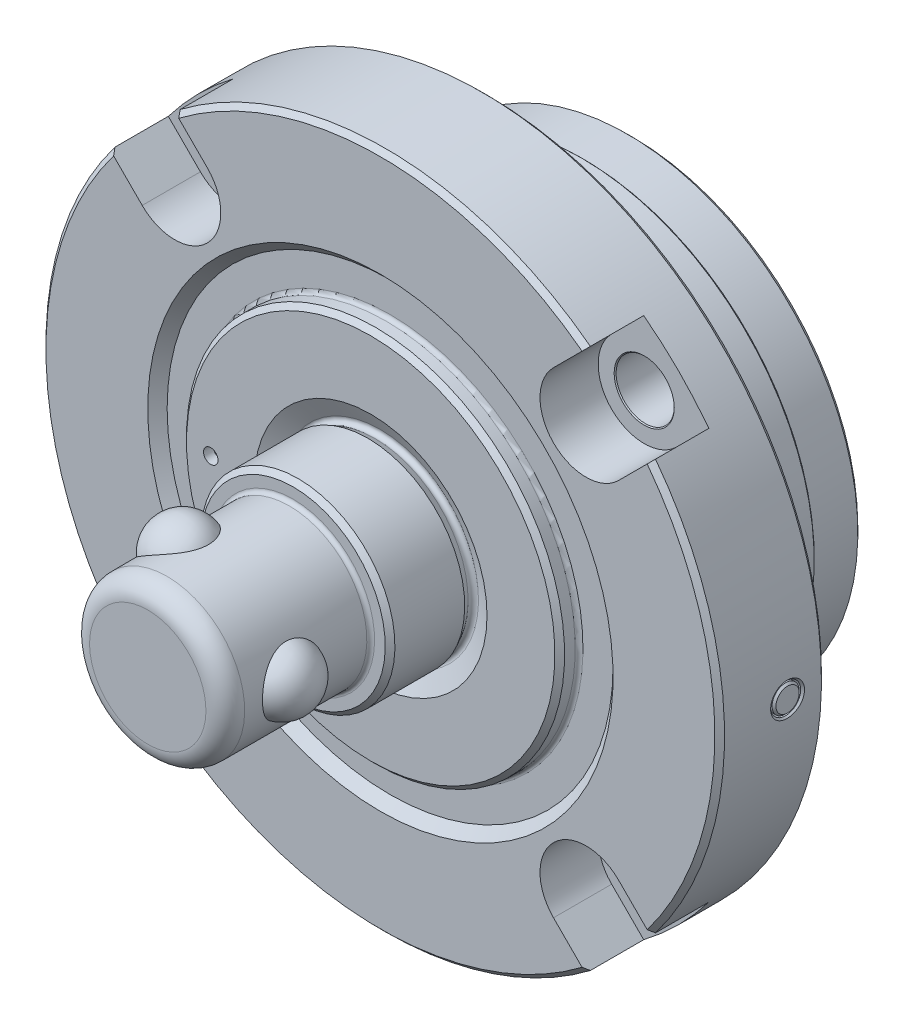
ISO-10303-21;
HEADER;
FILE_DESCRIPTION(('STEP AP214'),'2;1');
FILE_NAME('part.step','',(''),(''),'','','');
FILE_SCHEMA(('AUTOMOTIVE_DESIGN { 1 0 10303 214 1 1 1 1 }'));
ENDSEC;
DATA;
#1=APPLICATION_CONTEXT('core data for automotive mechanical design processes');
#2=APPLICATION_PROTOCOL_DEFINITION('international standard','automotive_design',2000,#1);
#3=PRODUCT_CONTEXT('',#1,'mechanical');
#4=PRODUCT('Part','Part','',(#3));
#5=PRODUCT_RELATED_PRODUCT_CATEGORY('part','',(#4));
#6=PRODUCT_DEFINITION_FORMATION('','',#4);
#7=PRODUCT_DEFINITION_CONTEXT('part definition',#1,'design');
#8=PRODUCT_DEFINITION('design','',#6,#7);
#9=PRODUCT_DEFINITION_SHAPE('','',#8);
#10=(LENGTH_UNIT() NAMED_UNIT(*) SI_UNIT(.MILLI.,.METRE.));
#11=(NAMED_UNIT(*) PLANE_ANGLE_UNIT() SI_UNIT($,.RADIAN.));
#12=(NAMED_UNIT(*) SI_UNIT($,.STERADIAN.) SOLID_ANGLE_UNIT());
#13=UNCERTAINTY_MEASURE_WITH_UNIT(LENGTH_MEASURE(1.E-05),#10,'distance_accuracy_value','');
#14=(GEOMETRIC_REPRESENTATION_CONTEXT(3) GLOBAL_UNCERTAINTY_ASSIGNED_CONTEXT((#13)) GLOBAL_UNIT_ASSIGNED_CONTEXT((#10,
#11,#12)) REPRESENTATION_CONTEXT('',''));
#15=CARTESIAN_POINT('',(0.,0.,0.));
#16=DIRECTION('',(0.,0.,1.));
#17=DIRECTION('',(1.,0.,0.));
#18=AXIS2_PLACEMENT_3D('',#15,#16,#17);
#19=CARTESIAN_POINT('',(-22.25,0.,-11.25));
#20=DIRECTION('',(0.,0.,-1.));
#21=DIRECTION('',(0.,1.,0.));
#22=AXIS2_PLACEMENT_3D('',#19,#20,#21);
#23=PLANE('',#22);
#24=CARTESIAN_POINT('',(-8.36455974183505,-17.5595170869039,-11.25));
#25=DIRECTION('',(0.,0.,-1.));
#26=DIRECTION('',(0.,1.,0.));
#27=AXIS2_PLACEMENT_3D('',#24,#25,#26);
#28=CIRCLE('',#27,1.24999999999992);
#29=CARTESIAN_POINT('',(-8.36455974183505,-16.309517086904,-11.25));
#30=VERTEX_POINT('',#29);
#31=EDGE_CURVE('E643',#30,#30,#28,.F.);
#32=ORIENTED_EDGE('',*,*,#31,.F.);
#33=EDGE_LOOP('',(#32));
#34=FACE_BOUND('',#33,.T.);
#35=ADVANCED_FACE('F14',(#34),#23,.T.);
#36=CARTESIAN_POINT('',(8.36455974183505,-17.5595170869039,-11.25));
#37=DIRECTION('',(0.,0.,-1.));
#38=DIRECTION('',(0.,1.,0.));
#39=AXIS2_PLACEMENT_3D('',#36,#37,#38);
#40=CIRCLE('',#39,1.24999999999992);
#41=CARTESIAN_POINT('',(8.36455974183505,-16.309517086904,-11.25));
#42=VERTEX_POINT('',#41);
#43=EDGE_CURVE('E655',#42,#42,#40,.F.);
#44=ORIENTED_EDGE('',*,*,#43,.F.);
#45=EDGE_LOOP('',(#44));
#46=FACE_BOUND('',#45,.T.);
#47=ADVANCED_FACE('F1051',(#46),#23,.T.);
#48=CARTESIAN_POINT('',(0.,0.,-9.75));
#49=DIRECTION('',(0.,0.,-1.));
#50=DIRECTION('',(0.,1.,0.));
#51=AXIS2_PLACEMENT_3D('',#48,#49,#50);
#52=CYLINDRICAL_SURFACE('',#51,4.);
#53=CARTESIAN_POINT('',(0.,0.,-11.25));
#54=DIRECTION('',(0.,0.,-1.));
#55=DIRECTION('',(0.,1.,0.));
#56=AXIS2_PLACEMENT_3D('',#53,#54,#55);
#57=CIRCLE('',#56,4.);
#58=CARTESIAN_POINT('',(0.,4.,-11.25));
#59=VERTEX_POINT('',#58);
#60=EDGE_CURVE('E1024',#59,#59,#57,.T.);
#61=ORIENTED_EDGE('',*,*,#60,.T.);
#62=EDGE_LOOP('',(#61));
#63=FACE_BOUND('',#62,.T.);
#64=CARTESIAN_POINT('',(0.,0.,-9.75));
#65=DIRECTION('',(0.,0.,-1.));
#66=DIRECTION('',(0.,1.,0.));
#67=AXIS2_PLACEMENT_3D('',#64,#65,#66);
#68=CIRCLE('',#67,4.);
#69=CARTESIAN_POINT('',(0.,4.,-9.75));
#70=VERTEX_POINT('',#69);
#71=EDGE_CURVE('E1023',#70,#70,#68,.T.);
#72=ORIENTED_EDGE('',*,*,#71,.F.);
#73=EDGE_LOOP('',(#72));
#74=FACE_BOUND('',#73,.T.);
#75=ADVANCED_FACE('F542',(#63,#74),#52,.F.);
#76=CARTESIAN_POINT('',(-32.5,0.,8.));
#77=DIRECTION('',(1.,0.,0.));
#78=DIRECTION('',(0.,1.,0.));
#79=AXIS2_PLACEMENT_3D('',#76,#77,#78);
#80=CYLINDRICAL_SURFACE('',#79,1.4);
#81=CARTESIAN_POINT('',(-34.8,0.,8.));
#82=DIRECTION('',(-1.,0.,0.));
#83=DIRECTION('',(0.,-1.,0.));
#84=AXIS2_PLACEMENT_3D('',#81,#82,#83);
#85=CIRCLE('',#84,1.4);
#86=CARTESIAN_POINT('',(-34.8,-1.4,8.));
#87=VERTEX_POINT('',#86);
#88=EDGE_CURVE('E2102',#87,#87,#85,.F.);
#89=ORIENTED_EDGE('',*,*,#88,.T.);
#90=EDGE_LOOP('',(#89));
#91=FACE_BOUND('',#90,.T.);
#92=CARTESIAN_POINT('',(-34.,0.,8.));
#93=DIRECTION('',(1.,0.,0.));
#94=DIRECTION('',(0.,1.,0.));
#95=AXIS2_PLACEMENT_3D('',#92,#93,#94);
#96=CIRCLE('',#95,1.4);
#97=CARTESIAN_POINT('',(-34.,1.4,8.));
#98=VERTEX_POINT('',#97);
#99=EDGE_CURVE('E679',#98,#98,#96,.T.);
#100=ORIENTED_EDGE('',*,*,#99,.F.);
#101=EDGE_LOOP('',(#100));
#102=FACE_BOUND('',#101,.T.);
#103=ADVANCED_FACE('F538',(#91,#102),#80,.T.);
#104=CARTESIAN_POINT('',(-35.,0.,8.));
#105=DIRECTION('',(-1.,0.,0.));
#106=DIRECTION('',(0.,-1.,0.));
#107=AXIS2_PLACEMENT_3D('',#104,#105,#106);
#108=PLANE('',#107);
#109=CARTESIAN_POINT('',(-35.,0.,8.));
#110=DIRECTION('',(-1.,0.,0.));
#111=DIRECTION('',(0.,-1.,0.));
#112=AXIS2_PLACEMENT_3D('',#109,#110,#111);
#113=CIRCLE('',#112,1.2);
#114=CARTESIAN_POINT('',(-35.,-1.2,8.));
#115=VERTEX_POINT('',#114);
#116=EDGE_CURVE('E1033',#115,#115,#113,.T.);
#117=ORIENTED_EDGE('',*,*,#116,.T.);
#118=EDGE_LOOP('',(#117));
#119=FACE_BOUND('',#118,.T.);
#120=ADVANCED_FACE('F534',(#119),#108,.T.);
#121=CARTESIAN_POINT('',(-34.8,0.,8.));
#122=DIRECTION('',(1.,0.,0.));
#123=DIRECTION('',(0.,1.,0.));
#124=AXIS2_PLACEMENT_3D('',#121,#122,#123);
#125=CONICAL_SURFACE('',#124,1.4,0.78539816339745);
#126=ORIENTED_EDGE('',*,*,#116,.F.);
#127=EDGE_LOOP('',(#126));
#128=FACE_BOUND('',#127,.T.);
#129=ORIENTED_EDGE('',*,*,#88,.F.);
#130=EDGE_LOOP('',(#129));
#131=FACE_BOUND('',#130,.T.);
#132=ADVANCED_FACE('F537',(#128,#131),#125,.T.);
#133=CARTESIAN_POINT('',(-3.41572891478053,5.91621602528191,28.));
#134=DIRECTION('',(0.,0.,-1.));
#135=DIRECTION('',(0.5,-0.866025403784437,0.));
#136=AXIS2_PLACEMENT_3D('',#133,#134,#135);
#137=SPHERICAL_SURFACE('',#136,3.37345);
#138=CARTESIAN_POINT('',(-6.53054864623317,4.6208153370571,28.));
#139=CARTESIAN_POINT('',(-6.53054666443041,4.62082433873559,27.8337689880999));
#140=CARTESIAN_POINT('',(-6.52214755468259,4.63275921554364,27.6672687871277));
#141=CARTESIAN_POINT('',(-6.48854713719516,4.67969607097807,27.3390466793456));
#142=CARTESIAN_POINT('',(-6.46330439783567,4.71475492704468,27.1773375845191));
#143=CARTESIAN_POINT('',(-6.39621180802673,4.8053733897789,26.8639833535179));
#144=CARTESIAN_POINT('',(-6.35441465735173,4.86086790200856,26.7123080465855));
#145=CARTESIAN_POINT('',(-6.25445543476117,4.98882219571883,26.4222248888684));
#146=CARTESIAN_POINT('',(-6.19629886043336,5.06127627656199,26.2838126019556));
#147=CARTESIAN_POINT('',(-6.06146197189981,5.22207493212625,26.0180415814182));
#148=CARTESIAN_POINT('',(-5.98416579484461,5.31091572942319,25.8912965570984));
#149=CARTESIAN_POINT('',(-5.81294489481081,5.49779276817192,25.6573057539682));
#150=CARTESIAN_POINT('',(-5.7190143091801,5.59583224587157,25.5500668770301));
#151=CARTESIAN_POINT('',(-5.5086278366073,5.80329665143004,25.350265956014));
#152=CARTESIAN_POINT('',(-5.3910784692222,5.9130432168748,25.2591861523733));
#153=CARTESIAN_POINT('',(-5.13998515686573,6.1325658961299,25.1027173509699));
#154=CARTESIAN_POINT('',(-5.00643853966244,6.24234201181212,25.0373326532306));
#155=CARTESIAN_POINT('',(-4.72195540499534,6.460349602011,24.9318220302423));
#156=CARTESIAN_POINT('',(-4.57063547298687,6.56845082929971,24.8924581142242));
#157=CARTESIAN_POINT('',(-4.2574425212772,6.77565044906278,24.8426377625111));
#158=CARTESIAN_POINT('',(-4.0955694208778,6.87474877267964,24.8321815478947));
#159=CARTESIAN_POINT('',(-3.76580552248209,7.06077360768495,24.8403433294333));
#160=CARTESIAN_POINT('',(-3.59791836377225,7.1477073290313,24.8589440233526));
#161=CARTESIAN_POINT('',(-3.26110437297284,7.3075272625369,24.9248829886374));
#162=CARTESIAN_POINT('',(-3.0921775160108,7.38041313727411,24.9722219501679));
#163=CARTESIAN_POINT('',(-2.7587381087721,7.51142309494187,25.0948830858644));
#164=CARTESIAN_POINT('',(-2.59422725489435,7.56954157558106,25.1702158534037));
#165=CARTESIAN_POINT('',(-2.27545446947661,7.67139671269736,25.3476149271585));
#166=CARTESIAN_POINT('',(-2.12119343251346,7.71513211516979,25.4496835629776));
#167=CARTESIAN_POINT('',(-1.82889306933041,7.78960318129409,25.6787101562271));
#168=CARTESIAN_POINT('',(-1.69084896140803,7.8203426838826,25.8056607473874));
#169=CARTESIAN_POINT('',(-1.43686003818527,7.87097454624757,26.0819300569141));
#170=CARTESIAN_POINT('',(-1.32091199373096,7.89086849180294,26.2312455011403));
#171=CARTESIAN_POINT('',(-1.12035508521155,7.92179177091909,26.5431210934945));
#172=CARTESIAN_POINT('',(-1.03479737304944,7.93310507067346,26.7050408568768));
#173=CARTESIAN_POINT('',(-0.894135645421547,7.95019488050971,27.0418769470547));
#174=CARTESIAN_POINT('',(-0.839013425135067,7.95597470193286,27.2167854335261));
#175=CARTESIAN_POINT('',(-0.765267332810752,7.96339371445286,27.5607548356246));
#176=CARTESIAN_POINT('',(-0.744257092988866,7.96530619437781,27.7292995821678));
#177=CARTESIAN_POINT('',(-0.732282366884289,7.9664178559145,28.0674420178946));
#178=CARTESIAN_POINT('',(-0.741308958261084,7.96561784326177,28.2370393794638));
#179=CARTESIAN_POINT('',(-0.787748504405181,7.96115169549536,28.5640055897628));
#180=CARTESIAN_POINT('',(-0.823797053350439,7.95762307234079,28.7215732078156));
#181=CARTESIAN_POINT('',(-0.92091905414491,7.94696638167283,29.0286417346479));
#182=CARTESIAN_POINT('',(-0.981994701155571,7.93983799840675,29.1781419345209));
#183=CARTESIAN_POINT('',(-1.12839786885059,7.92037150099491,29.4693530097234));
#184=CARTESIAN_POINT('',(-1.21432564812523,7.90790022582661,29.6107521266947));
#185=CARTESIAN_POINT('',(-1.4061746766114,7.87604662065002,29.8783777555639));
#186=CARTESIAN_POINT('',(-1.51210175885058,7.85666227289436,30.0045998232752));
#187=CARTESIAN_POINT('',(-1.74820013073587,7.80764411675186,30.2479734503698));
#188=CARTESIAN_POINT('',(-1.87955757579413,7.77738129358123,30.3638482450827));
#189=CARTESIAN_POINT('',(-2.15594978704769,7.70534069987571,30.5736312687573));
#190=CARTESIAN_POINT('',(-2.30098843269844,7.66355965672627,30.6675332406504));
#191=CARTESIAN_POINT('',(-2.60815609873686,7.56471569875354,30.8364392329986));
#192=CARTESIAN_POINT('',(-2.77078646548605,7.50693754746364,30.9101167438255));
#193=CARTESIAN_POINT('',(-3.10030929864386,7.3769542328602,31.030165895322));
#194=CARTESIAN_POINT('',(-3.26720214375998,7.30474778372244,31.0765351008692));
#195=CARTESIAN_POINT('',(-3.60228865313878,7.14551527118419,31.1416785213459));
#196=CARTESIAN_POINT('',(-3.7704675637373,7.05829492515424,31.1600551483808));
#197=CARTESIAN_POINT('',(-4.10064346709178,6.8717306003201,31.1676523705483));
#198=CARTESIAN_POINT('',(-4.26264045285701,6.77238660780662,31.1568729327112));
#199=CARTESIAN_POINT('',(-4.57557399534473,6.56500315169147,31.1064081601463));
#200=CARTESIAN_POINT('',(-4.72653970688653,6.45698831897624,31.0668022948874));
#201=CARTESIAN_POINT('',(-5.01429231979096,6.23616697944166,30.9594201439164));
#202=CARTESIAN_POINT('',(-5.15107836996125,6.12336018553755,30.8916421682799));
#203=CARTESIAN_POINT('',(-5.40804966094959,5.89765539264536,30.7288178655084));
#204=CARTESIAN_POINT('',(-5.52818948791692,5.7847579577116,30.6336990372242));
#205=CARTESIAN_POINT('',(-5.74947669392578,5.56487840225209,30.4179144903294));
#206=CARTESIAN_POINT('',(-5.85062463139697,5.45789610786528,30.297249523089));
#207=CARTESIAN_POINT('',(-6.03185838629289,5.256887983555,30.033878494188));
#208=CARTESIAN_POINT('',(-6.11212226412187,5.16275610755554,29.8913764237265));
#209=CARTESIAN_POINT('',(-6.25201997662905,4.99243895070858,29.5866889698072));
#210=CARTESIAN_POINT('',(-6.31164986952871,4.91625709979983,29.4244998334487));
#211=CARTESIAN_POINT('',(-6.40726602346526,4.79091509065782,29.0938046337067));
#212=CARTESIAN_POINT('',(-6.44431384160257,4.74056310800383,28.9260567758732));
#213=CARTESIAN_POINT('',(-6.49914505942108,4.66511981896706,28.582250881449));
#214=CARTESIAN_POINT('',(-6.5169866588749,4.63995221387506,28.4062196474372));
#215=CARTESIAN_POINT('',(-6.52700210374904,4.62582297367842,28.1910572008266));
#216=CARTESIAN_POINT('',(-6.52833150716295,4.62394741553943,28.1528859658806));
#217=CARTESIAN_POINT('',(-6.53010501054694,4.62144255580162,28.0764812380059));
#218=CARTESIAN_POINT('',(-6.53054910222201,4.6208132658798,28.0382477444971));
#219=CARTESIAN_POINT('',(-6.53054864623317,4.6208153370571,28.));
#220=B_SPLINE_CURVE_WITH_KNOTS('',3,(#138,#139,#140,#141,#142,#143,#144,#145,#146,#147,#148,
#149,#150,#151,#152,#153,#154,#155,#156,#157,#158,#159,#160,#161,#162,#163,#164,#165,#166,#167,
#168,#169,#170,#171,#172,#173,#174,#175,#176,#177,#178,#179,#180,#181,#182,#183,#184,#185,#186,
#187,#188,#189,#190,#191,#192,#193,#194,#195,#196,#197,#198,#199,#200,#201,#202,#203,#204,#205,
#206,#207,#208,#209,#210,#211,#212,#213,#214,#215,#216,#217,#218,#219),.UNSPECIFIED.,.T.,.F.,(4,
2,2,2,2,2,2,2,2,2,2,2,2,2,2,2,2,2,2,2,2,2,2,2,2,2,2,2,2,2,2,2,2,2,2,2,2,2,2,2,4),(0.,
0.498535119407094,0.998301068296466,1.49648867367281,1.99450906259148,2.51131099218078,
3.02829542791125,3.58022855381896,4.13225400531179,4.69980299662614,5.2673563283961,
5.83457183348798,6.40180096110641,6.96924495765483,7.53673841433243,8.10406411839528,
8.67130684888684,9.21884213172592,9.76604955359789,10.2730078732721,10.779815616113,
11.2626247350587,11.7454762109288,12.2411341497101,12.7369368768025,13.2678767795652,
13.7989676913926,14.3593243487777,14.9197309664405,15.4880253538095,16.0563203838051,
16.6230546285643,17.1898228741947,17.7581081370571,18.326376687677,18.889628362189,
19.4529875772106,19.9872673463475,20.5199235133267,20.6346293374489,20.749336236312),.UNSPECIFIED.);
#221=CARTESIAN_POINT('',(-6.53054864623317,4.6208153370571,28.));
#222=VERTEX_POINT('',#221);
#223=EDGE_CURVE('E508',#222,#222,#220,.T.);
#224=ORIENTED_EDGE('',*,*,#223,.F.);
#225=EDGE_LOOP('',(#224));
#226=FACE_BOUND('',#225,.T.);
#227=ADVANCED_FACE('F530',(#226),#137,.T.);
#228=CARTESIAN_POINT('',(-3.41572891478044,-5.91621602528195,28.));
#229=DIRECTION('',(0.,0.,-1.));
#230=DIRECTION('',(0.499999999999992,0.866025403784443,0.));
#231=AXIS2_PLACEMENT_3D('',#228,#229,#230);
#232=SPHERICAL_SURFACE('',#231,3.37345);
#233=CARTESIAN_POINT('',(-6.5305486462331,-4.6208153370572,28.));
#234=CARTESIAN_POINT('',(-6.53054666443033,-4.62082433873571,28.1662310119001));
#235=CARTESIAN_POINT('',(-6.52214755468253,-4.63275921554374,28.3327312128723));
#236=CARTESIAN_POINT('',(-6.48854713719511,-4.67969607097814,28.6609533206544));
#237=CARTESIAN_POINT('',(-6.46330439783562,-4.71475492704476,28.8226624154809));
#238=CARTESIAN_POINT('',(-6.39621180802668,-4.80537338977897,29.136016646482));
#239=CARTESIAN_POINT('',(-6.35441465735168,-4.86086790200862,29.2876919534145));
#240=CARTESIAN_POINT('',(-6.25445543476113,-4.98882219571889,29.5777751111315));
#241=CARTESIAN_POINT('',(-6.19629886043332,-5.06127627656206,29.7161873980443));
#242=CARTESIAN_POINT('',(-6.06146197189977,-5.22207493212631,29.9819584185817));
#243=CARTESIAN_POINT('',(-5.98416579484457,-5.31091572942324,30.1087034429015));
#244=CARTESIAN_POINT('',(-5.81294489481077,-5.49779276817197,30.3426942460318));
#245=CARTESIAN_POINT('',(-5.71901430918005,-5.59583224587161,30.4499331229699));
#246=CARTESIAN_POINT('',(-5.50862783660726,-5.80329665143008,30.6497340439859));
#247=CARTESIAN_POINT('',(-5.39107846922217,-5.91304321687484,30.7408138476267));
#248=CARTESIAN_POINT('',(-5.1399851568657,-6.13256589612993,30.8972826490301));
#249=CARTESIAN_POINT('',(-5.00643853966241,-6.24234201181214,30.9626673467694));
#250=CARTESIAN_POINT('',(-4.72195540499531,-6.46034960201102,31.0681779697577));
#251=CARTESIAN_POINT('',(-4.57063547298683,-6.56845082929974,31.1075418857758));
#252=CARTESIAN_POINT('',(-4.25744252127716,-6.7756504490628,31.1573622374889));
#253=CARTESIAN_POINT('',(-4.09556942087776,-6.87474877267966,31.1678184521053));
#254=CARTESIAN_POINT('',(-3.76580552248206,-7.06077360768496,31.1596566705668));
#255=CARTESIAN_POINT('',(-3.59791836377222,-7.14770732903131,31.1410559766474));
#256=CARTESIAN_POINT('',(-3.26110437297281,-7.30752726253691,31.0751170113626));
#257=CARTESIAN_POINT('',(-3.09217751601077,-7.38041313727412,31.0277780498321));
#258=CARTESIAN_POINT('',(-2.75873810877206,-7.51142309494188,30.9051169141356));
#259=CARTESIAN_POINT('',(-2.5942272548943,-7.56954157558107,30.8297841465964));
#260=CARTESIAN_POINT('',(-2.27545446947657,-7.67139671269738,30.6523850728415));
#261=CARTESIAN_POINT('',(-2.12119343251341,-7.71513211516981,30.5503164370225));
#262=CARTESIAN_POINT('',(-1.82889306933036,-7.78960318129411,30.3212898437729));
#263=CARTESIAN_POINT('',(-1.69084896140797,-7.82034268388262,30.1943392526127));
#264=CARTESIAN_POINT('',(-1.43686003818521,-7.87097454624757,29.918069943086));
#265=CARTESIAN_POINT('',(-1.32091199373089,-7.89086849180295,29.7687544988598));
#266=CARTESIAN_POINT('',(-1.12035508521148,-7.9217917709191,29.4568789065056));
#267=CARTESIAN_POINT('',(-1.03479737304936,-7.93310507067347,29.2949591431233));
#268=CARTESIAN_POINT('',(-0.894135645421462,-7.95019488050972,28.9581230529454));
#269=CARTESIAN_POINT('',(-0.839013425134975,-7.95597470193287,28.783214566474));
#270=CARTESIAN_POINT('',(-0.765267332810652,-7.96339371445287,28.4392451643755));
#271=CARTESIAN_POINT('',(-0.744257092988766,-7.96530619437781,28.2707004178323));
#272=CARTESIAN_POINT('',(-0.732282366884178,-7.96641785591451,27.9325579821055));
#273=CARTESIAN_POINT('',(-0.741308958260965,-7.96561784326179,27.7629606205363));
#274=CARTESIAN_POINT('',(-0.787748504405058,-7.96115169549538,27.4359944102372));
#275=CARTESIAN_POINT('',(-0.823797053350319,-7.95762307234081,27.2784267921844));
#276=CARTESIAN_POINT('',(-0.920919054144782,-7.94696638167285,26.9713582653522));
#277=CARTESIAN_POINT('',(-0.981994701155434,-7.93983799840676,26.8218580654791));
#278=CARTESIAN_POINT('',(-1.12839786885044,-7.92037150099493,26.5306469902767));
#279=CARTESIAN_POINT('',(-1.21432564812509,-7.90790022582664,26.3892478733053));
#280=CARTESIAN_POINT('',(-1.40617467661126,-7.87604662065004,26.1216222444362));
#281=CARTESIAN_POINT('',(-1.51210175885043,-7.85666227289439,25.9954001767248));
#282=CARTESIAN_POINT('',(-1.74820013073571,-7.8076441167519,25.7520265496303));
#283=CARTESIAN_POINT('',(-1.87955757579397,-7.77738129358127,25.6361517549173));
#284=CARTESIAN_POINT('',(-2.15594978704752,-7.70534069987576,25.4263687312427));
#285=CARTESIAN_POINT('',(-2.30098843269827,-7.66355965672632,25.3324667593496));
#286=CARTESIAN_POINT('',(-2.60815609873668,-7.5647156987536,25.1635607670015));
#287=CARTESIAN_POINT('',(-2.77078646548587,-7.5069375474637,25.0898832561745));
#288=CARTESIAN_POINT('',(-3.10030929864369,-7.37695423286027,24.969834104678));
#289=CARTESIAN_POINT('',(-3.26720214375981,-7.30474778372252,24.9234648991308));
#290=CARTESIAN_POINT('',(-3.60228865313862,-7.14551527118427,24.8583214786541));
#291=CARTESIAN_POINT('',(-3.77046756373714,-7.05829492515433,24.8399448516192));
#292=CARTESIAN_POINT('',(-4.10064346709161,-6.8717306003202,24.8323476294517));
#293=CARTESIAN_POINT('',(-4.26264045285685,-6.77238660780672,24.8431270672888));
#294=CARTESIAN_POINT('',(-4.57557399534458,-6.56500315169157,24.8935918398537));
#295=CARTESIAN_POINT('',(-4.72653970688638,-6.45698831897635,24.9331977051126));
#296=CARTESIAN_POINT('',(-5.01429231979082,-6.23616697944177,25.0405798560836));
#297=CARTESIAN_POINT('',(-5.15107836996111,-6.12336018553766,25.10835783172));
#298=CARTESIAN_POINT('',(-5.40804966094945,-5.89765539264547,25.2711821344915));
#299=CARTESIAN_POINT('',(-5.52818948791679,-5.78475795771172,25.3663009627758));
#300=CARTESIAN_POINT('',(-5.74947669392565,-5.56487840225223,25.5820855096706));
#301=CARTESIAN_POINT('',(-5.85062463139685,-5.45789610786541,25.7027504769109));
#302=CARTESIAN_POINT('',(-6.03185838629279,-5.25688798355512,25.9661215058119));
#303=CARTESIAN_POINT('',(-6.11212226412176,-5.16275610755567,26.1086235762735));
#304=CARTESIAN_POINT('',(-6.25201997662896,-4.99243895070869,26.4133110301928));
#305=CARTESIAN_POINT('',(-6.31164986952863,-4.91625709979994,26.5755001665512));
#306=CARTESIAN_POINT('',(-6.40726602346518,-4.79091509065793,26.9061953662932));
#307=CARTESIAN_POINT('',(-6.44431384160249,-4.74056310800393,27.0739432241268));
#308=CARTESIAN_POINT('',(-6.49914505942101,-4.66511981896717,27.4177491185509));
#309=CARTESIAN_POINT('',(-6.51698665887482,-4.63995221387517,27.5937803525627));
#310=CARTESIAN_POINT('',(-6.52700210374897,-4.62582297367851,27.8089427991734));
#311=CARTESIAN_POINT('',(-6.52833150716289,-4.62394741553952,27.8471140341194));
#312=CARTESIAN_POINT('',(-6.53010501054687,-4.62144255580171,27.9235187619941));
#313=CARTESIAN_POINT('',(-6.53054910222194,-4.62081326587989,27.9617522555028));
#314=CARTESIAN_POINT('',(-6.5305486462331,-4.6208153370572,28.));
#315=B_SPLINE_CURVE_WITH_KNOTS('',3,(#233,#234,#235,#236,#237,#238,#239,#240,#241,#242,#243,
#244,#245,#246,#247,#248,#249,#250,#251,#252,#253,#254,#255,#256,#257,#258,#259,#260,#261,#262,
#263,#264,#265,#266,#267,#268,#269,#270,#271,#272,#273,#274,#275,#276,#277,#278,#279,#280,#281,
#282,#283,#284,#285,#286,#287,#288,#289,#290,#291,#292,#293,#294,#295,#296,#297,#298,#299,#300,
#301,#302,#303,#304,#305,#306,#307,#308,#309,#310,#311,#312,#313,#314),.UNSPECIFIED.,.T.,.F.,(4,
2,2,2,2,2,2,2,2,2,2,2,2,2,2,2,2,2,2,2,2,2,2,2,2,2,2,2,2,2,2,2,2,2,2,2,2,2,2,2,4),(0.,
0.498535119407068,0.998301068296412,1.49648867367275,1.99450906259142,2.51131099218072,
3.02829542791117,3.58022855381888,4.13225400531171,4.69980299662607,5.26735632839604,
5.83457183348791,6.40180096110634,6.96924495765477,7.53673841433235,8.10406411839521,
8.67130684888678,9.21884213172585,9.76604955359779,10.273007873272,10.7798156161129,
11.2626247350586,11.7454762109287,12.24113414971,12.7369368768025,13.2678767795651,
13.7989676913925,14.3593243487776,14.9197309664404,15.4880253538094,16.0563203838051,
16.6230546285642,17.1898228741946,17.758108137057,18.3263766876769,18.8896283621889,
19.4529875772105,19.9872673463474,20.5199235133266,20.6346293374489,20.749336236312),.UNSPECIFIED.);
#316=CARTESIAN_POINT('',(-6.5305486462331,-4.6208153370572,28.));
#317=VERTEX_POINT('',#316);
#318=EDGE_CURVE('E25',#317,#317,#315,.T.);
#319=ORIENTED_EDGE('',*,*,#318,.F.);
#320=EDGE_LOOP('',(#319));
#321=FACE_BOUND('',#320,.T.);
#322=ADVANCED_FACE('F525',(#321),#232,.T.);
#323=CARTESIAN_POINT('',(6.83145782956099,0.,28.));
#324=DIRECTION('',(0.,0.,-1.));
#325=DIRECTION('',(-1.,0.,0.));
#326=AXIS2_PLACEMENT_3D('',#323,#324,#325);
#327=SPHERICAL_SURFACE('',#326,3.37345);
#328=CARTESIAN_POINT('',(7.2670177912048,-3.34521335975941,28.));
#329=CARTESIAN_POINT('',(7.26702459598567,-3.34520714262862,28.1662310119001));
#330=CARTESIAN_POINT('',(7.27316094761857,-3.33196586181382,28.3327312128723));
#331=CARTESIAN_POINT('',(7.29700924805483,-3.27939861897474,28.6609533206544));
#332=CARTESIAN_POINT('',(7.31474973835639,-3.24000833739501,28.8226624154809));
#333=CARTESIAN_POINT('',(7.35968133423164,-3.13659521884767,29.1360166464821));
#334=CARTESIAN_POINT('',(7.38684241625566,-3.07265056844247,29.2876919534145));
#335=CARTESIAN_POINT('',(7.44767447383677,-2.92210619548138,29.5777751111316));
#336=CARTESIAN_POINT('',(7.48134326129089,-2.83551408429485,29.7161873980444));
#337=CARTESIAN_POINT('',(7.55318053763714,-2.63834258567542,29.9819584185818));
#338=CARTESIAN_POINT('',(7.59147083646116,-2.52698173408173,30.1087034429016));
#339=CARTESIAN_POINT('',(7.66770064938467,-2.28526156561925,30.3426942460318));
#340=CARTESIAN_POINT('',(7.70564003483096,-2.15489555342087,30.4499331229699));
#341=CARTESIAN_POINT('',(7.78011624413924,-1.868963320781,30.6497340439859));
#342=CARTESIAN_POINT('',(7.81638487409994,-1.71228929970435,30.7408138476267));
#343=CARTESIAN_POINT('',(7.88095043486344,-1.38507477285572,30.8972826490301));
#344=CARTESIAN_POINT('',(7.90924603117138,-1.21453195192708,30.9626673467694));
#345=CARTESIAN_POINT('',(7.95580457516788,-0.8591585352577,31.0681779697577));
#346=CARTESIAN_POINT('',(7.97376301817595,-0.67406101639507,31.1075418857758));
#347=CARTESIAN_POINT('',(7.9966066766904,-0.299228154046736,31.1573622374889));
#348=CARTESIAN_POINT('',(8.00149179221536,-0.109492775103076,31.1678184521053));
#349=CARTESIAN_POINT('',(7.99771207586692,0.269103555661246,31.1596566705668));
#350=CARTESIAN_POINT('',(7.98905530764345,0.457964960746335,31.1410559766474));
#351=CARTESIAN_POINT('',(7.95905643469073,0.829564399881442,31.0751170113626));
#352=CARTESIAN_POINT('',(7.93771402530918,1.01230228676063,31.0277780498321));
#353=CARTESIAN_POINT('',(7.88445227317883,1.36657426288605,30.9051169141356));
#354=CARTESIAN_POINT('',(7.85252892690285,1.53810408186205,30.8297841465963));
#355=CARTESIAN_POINT('',(7.78135167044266,1.86509698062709,30.6523850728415));
#356=CARTESIAN_POINT('',(7.74209712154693,2.02055865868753,30.5503164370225));
#357=CARTESIAN_POINT('',(7.66044077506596,2.31093373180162,30.3212898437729));
#358=CARTESIAN_POINT('',(7.61803991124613,2.44585318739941,30.1943392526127));
#359=CARTESIAN_POINT('',(7.53489392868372,2.69112997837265,29.9180699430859));
#360=CARTESIAN_POINT('',(7.49414856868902,2.80149090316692,29.7687544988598));
#361=CARTESIAN_POINT('',(7.42065045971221,2.99063992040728,29.4568789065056));
#362=CARTESIAN_POINT('',(7.38766920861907,3.07039172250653,29.2949591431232));
#363=CARTESIAN_POINT('',(7.33213855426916,3.20075325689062,28.9581230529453));
#364=CARTESIAN_POINT('',(7.3095829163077,3.25138041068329,28.783214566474));
#365=CARTESIAN_POINT('',(7.27913492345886,3.31895590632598,28.4392451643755));
#366=CARTESIAN_POINT('',(7.27028605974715,3.33810754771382,28.2707004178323));
#367=CARTESIAN_POINT('',(7.26526142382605,3.34903379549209,27.9325579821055));
#368=CARTESIAN_POINT('',(7.26908188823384,3.34081653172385,27.7629606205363));
#369=CARTESIAN_POINT('',(7.28843386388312,3.29836563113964,27.4359944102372));
#370=CARTESIAN_POINT('',(7.30340226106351,3.26538236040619,27.2784267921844));
#371=CARTESIAN_POINT('',(7.34273429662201,3.17594389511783,26.9713582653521));
#372=CARTESIAN_POINT('',(7.36709875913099,3.11948664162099,26.8218580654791));
#373=CARTESIAN_POINT('',(7.42344186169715,2.98296453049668,26.5306469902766));
#374=CARTESIAN_POINT('',(7.45560531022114,2.90231325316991,26.3892478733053));
#375=CARTESIAN_POINT('',(7.52394379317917,2.72024031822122,26.1216222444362));
#376=CARTESIAN_POINT('',(7.56011999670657,2.6188126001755,25.9954001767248));
#377=CARTESIAN_POINT('',(7.63571821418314,2.38983633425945,25.7520265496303));
#378=CARTESIAN_POINT('',(7.67518856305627,2.26094603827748,25.6361517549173));
#379=CARTESIAN_POINT('',(7.75099568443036,1.98556306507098,25.4263687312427));
#380=CARTESIAN_POINT('',(7.78733156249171,1.83906539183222,25.3324667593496));
#381=CARTESIAN_POINT('',(7.85531401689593,1.52362841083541,25.1635607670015));
#382=CARTESIAN_POINT('',(7.88659185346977,1.35389730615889,25.0898832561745));
#383=CARTESIAN_POINT('',(7.93878441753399,1.00353050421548,24.969834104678));
#384=CARTESIAN_POINT('',(7.95969822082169,0.822893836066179,24.9234648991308));
#385=CARTESIAN_POINT('',(7.98934207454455,0.453084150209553,24.8583214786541));
#386=CARTESIAN_POINT('',(7.99789649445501,0.263826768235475,24.8399448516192));
#387=CARTESIAN_POINT('',(8.00141500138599,-0.115396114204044,24.8323476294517));
#388=CARTESIAN_POINT('',(7.99637907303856,-0.305361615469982,24.8431270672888));
#389=CARTESIAN_POINT('',(7.97324650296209,-0.68006174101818,24.8935918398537));
#390=CARTESIAN_POINT('',(7.95518576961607,-0.864809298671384,24.9331977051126));
#391=CARTESIAN_POINT('',(7.90782518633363,-1.22442104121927,25.0405798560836));
#392=CARTESIAN_POINT('',(7.87852466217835,-1.39928463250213,25.10835783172));
#393=CARTESIAN_POINT('',(7.81154422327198,-1.73468069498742,25.2711821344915));
#394=CARTESIAN_POINT('',(7.77384209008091,-1.89517355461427,25.3663009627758));
#395=CARTESIAN_POINT('',(7.69406441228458,-2.19675367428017,25.5820855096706));
#396=CARTESIAN_POINT('',(7.65198899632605,-2.33784150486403,25.7027504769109));
#397=CARTESIAN_POINT('',(7.56852773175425,-2.59529860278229,25.966121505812));
#398=CARTESIAN_POINT('',(7.52713907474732,-2.71187509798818,26.1086235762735));
#399=CARTESIAN_POINT('',(7.4495889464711,-2.91818864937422,26.4133110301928));
#400=CARTESIAN_POINT('',(7.41342847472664,-3.00792057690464,26.5755001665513));
#401=CARTESIAN_POINT('',(7.35268718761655,-3.15339759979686,26.9061953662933));
#402=CARTESIAN_POINT('',(7.32760500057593,-3.21065794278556,27.0739432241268));
#403=CARTESIAN_POINT('',(7.2896848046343,-3.29586481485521,27.417749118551));
#404=CARTESIAN_POINT('',(7.27680981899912,-3.32389989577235,27.5937803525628));
#405=CARTESIAN_POINT('',(7.26958126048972,-3.33963814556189,27.8089427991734));
#406=CARTESIAN_POINT('',(7.26862168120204,-3.34172722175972,27.8471140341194));
#407=CARTESIAN_POINT('',(7.26733916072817,-3.34451555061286,27.9235187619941));
#408=CARTESIAN_POINT('',(7.26701622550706,-3.34521479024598,27.9617522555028));
#409=CARTESIAN_POINT('',(7.2670177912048,-3.34521335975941,28.));
#410=B_SPLINE_CURVE_WITH_KNOTS('',3,(#328,#329,#330,#331,#332,#333,#334,#335,#336,#337,#338,
#339,#340,#341,#342,#343,#344,#345,#346,#347,#348,#349,#350,#351,#352,#353,#354,#355,#356,#357,
#358,#359,#360,#361,#362,#363,#364,#365,#366,#367,#368,#369,#370,#371,#372,#373,#374,#375,#376,
#377,#378,#379,#380,#381,#382,#383,#384,#385,#386,#387,#388,#389,#390,#391,#392,#393,#394,#395,
#396,#397,#398,#399,#400,#401,#402,#403,#404,#405,#406,#407,#408,#409),.UNSPECIFIED.,.T.,.F.,(4,
2,2,2,2,2,2,2,2,2,2,2,2,2,2,2,2,2,2,2,2,2,2,2,2,2,2,2,2,2,2,2,2,2,2,2,2,2,2,2,4),(0.,
0.498535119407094,0.998301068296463,1.4964886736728,1.99450906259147,2.51131099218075,
3.0282954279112,3.58022855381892,4.13225400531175,4.69980299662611,5.26735632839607,
5.83457183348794,6.40180096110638,6.9692449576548,7.53673841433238,8.10406411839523,
8.67130684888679,9.21884213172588,9.76604955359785,10.2730078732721,10.779815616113,
11.2626247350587,11.7454762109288,12.24113414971,12.7369368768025,13.2678767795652,
13.7989676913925,14.3593243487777,14.9197309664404,15.4880253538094,16.0563203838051,
16.6230546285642,17.1898228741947,17.7581081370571,18.326376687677,18.889628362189,
19.4529875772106,19.9872673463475,20.5199235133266,20.6346293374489,20.749336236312),.UNSPECIFIED.);
#411=CARTESIAN_POINT('',(7.2670177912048,-3.34521335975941,28.));
#412=VERTEX_POINT('',#411);
#413=EDGE_CURVE('E9',#412,#412,#410,.T.);
#414=ORIENTED_EDGE('',*,*,#413,.F.);
#415=EDGE_LOOP('',(#414));
#416=FACE_BOUND('',#415,.T.);
#417=ADVANCED_FACE('F445',(#416),#327,.T.);
#418=CARTESIAN_POINT('',(0.,0.,0.));
#419=DIRECTION('',(0.,0.,1.));
#420=DIRECTION('',(0.,-1.,0.));
#421=AXIS2_PLACEMENT_3D('',#418,#419,#420);
#422=CYLINDRICAL_SURFACE('',#421,23.75);
#423=CARTESIAN_POINT('',(0.,0.,-14.5));
#424=DIRECTION('',(0.,0.,1.));
#425=DIRECTION('',(0.,-1.,0.));
#426=AXIS2_PLACEMENT_3D('',#423,#424,#425);
#427=CIRCLE('',#426,23.75);
#428=CARTESIAN_POINT('',(0.,-23.75,-14.5));
#429=VERTEX_POINT('',#428);
#430=EDGE_CURVE('E248',#429,#429,#427,.T.);
#431=ORIENTED_EDGE('',*,*,#430,.T.);
#432=EDGE_LOOP('',(#431));
#433=FACE_BOUND('',#432,.T.);
#434=CARTESIAN_POINT('',(0.,0.,-10.));
#435=DIRECTION('',(0.,0.,1.));
#436=DIRECTION('',(0.,-1.,0.));
#437=AXIS2_PLACEMENT_3D('',#434,#435,#436);
#438=CIRCLE('',#437,23.75);
#439=CARTESIAN_POINT('',(0.,-23.75,-10.));
#440=VERTEX_POINT('',#439);
#441=EDGE_CURVE('E731',#440,#440,#438,.T.);
#442=ORIENTED_EDGE('',*,*,#441,.F.);
#443=EDGE_LOOP('',(#442));
#444=FACE_BOUND('',#443,.T.);
#445=ADVANCED_FACE('F441',(#433,#444),#422,.T.);
#446=CARTESIAN_POINT('',(0.,0.,-14.5));
#447=DIRECTION('',(0.,0.,1.));
#448=DIRECTION('',(0.,-1.,0.));
#449=AXIS2_PLACEMENT_3D('',#446,#447,#448);
#450=CONICAL_SURFACE('',#449,23.75,0.785398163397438);
#451=CARTESIAN_POINT('',(0.,0.,-15.));
#452=DIRECTION('',(0.,0.,1.));
#453=DIRECTION('',(0.,-1.,0.));
#454=AXIS2_PLACEMENT_3D('',#451,#452,#453);
#455=CIRCLE('',#454,23.25);
#456=CARTESIAN_POINT('',(0.,-23.25,-15.));
#457=VERTEX_POINT('',#456);
#458=EDGE_CURVE('E251',#457,#457,#455,.F.);
#459=ORIENTED_EDGE('',*,*,#458,.F.);
#460=EDGE_LOOP('',(#459));
#461=FACE_BOUND('',#460,.T.);
#462=ORIENTED_EDGE('',*,*,#430,.F.);
#463=EDGE_LOOP('',(#462));
#464=FACE_BOUND('',#463,.T.);
#465=ADVANCED_FACE('F444',(#461,#464),#450,.T.);
#466=CARTESIAN_POINT('',(3.9,0.,-15.));
#467=DIRECTION('',(0.,0.,1.));
#468=DIRECTION('',(0.,-1.,0.));
#469=AXIS2_PLACEMENT_3D('',#466,#467,#468);
#470=PLANE('',#469);
#471=CARTESIAN_POINT('',(0.,0.,-15.));
#472=DIRECTION('',(0.,0.,1.));
#473=DIRECTION('',(0.,-1.,0.));
#474=AXIS2_PLACEMENT_3D('',#471,#472,#473);
#475=CIRCLE('',#474,21.2);
#476=CARTESIAN_POINT('',(0.,-21.2,-15.));
#477=VERTEX_POINT('',#476);
#478=EDGE_CURVE('E1159',#477,#477,#475,.T.);
#479=ORIENTED_EDGE('',*,*,#478,.T.);
#480=EDGE_LOOP('',(#479));
#481=FACE_BOUND('',#480,.T.);
#482=ORIENTED_EDGE('',*,*,#458,.T.);
#483=EDGE_LOOP('',(#482));
#484=FACE_BOUND('',#483,.T.);
#485=ADVANCED_FACE('F492',(#481,#484),#470,.F.);
#486=CARTESIAN_POINT('',(0.,0.,-15.));
#487=DIRECTION('',(0.,0.,-1.));
#488=DIRECTION('',(0.,1.,0.));
#489=AXIS2_PLACEMENT_3D('',#486,#487,#488);
#490=CONICAL_SURFACE('',#489,21.2,0.785398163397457);
#491=CARTESIAN_POINT('',(0.,0.,-14.8));
#492=DIRECTION('',(0.,0.,1.));
#493=DIRECTION('',(0.,-1.,0.));
#494=AXIS2_PLACEMENT_3D('',#491,#492,#493);
#495=CIRCLE('',#494,21.);
#496=CARTESIAN_POINT('',(0.,-21.,-14.8));
#497=VERTEX_POINT('',#496);
#498=EDGE_CURVE('E330',#497,#497,#495,.F.);
#499=ORIENTED_EDGE('',*,*,#498,.F.);
#500=EDGE_LOOP('',(#499));
#501=FACE_BOUND('',#500,.T.);
#502=ORIENTED_EDGE('',*,*,#478,.F.);
#503=EDGE_LOOP('',(#502));
#504=FACE_BOUND('',#503,.T.);
#505=ADVANCED_FACE('F465',(#501,#504),#490,.F.);
#506=CARTESIAN_POINT('',(0.,0.,0.));
#507=DIRECTION('',(0.,0.,1.));
#508=DIRECTION('',(0.,-1.,0.));
#509=AXIS2_PLACEMENT_3D('',#506,#507,#508);
#510=CYLINDRICAL_SURFACE('',#509,21.);
#511=ORIENTED_EDGE('',*,*,#498,.T.);
#512=EDGE_LOOP('',(#511));
#513=FACE_BOUND('',#512,.T.);
#514=CARTESIAN_POINT('',(0.,0.,-13.));
#515=DIRECTION('',(0.,0.,1.));
#516=DIRECTION('',(0.,-1.,0.));
#517=AXIS2_PLACEMENT_3D('',#514,#515,#516);
#518=CIRCLE('',#517,21.);
#519=CARTESIAN_POINT('',(5.78181885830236,-20.1883771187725,-13.));
#520=VERTEX_POINT('',#519);
#521=CARTESIAN_POINT('',(-5.78181885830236,-20.1883771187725,-13.));
#522=VERTEX_POINT('',#521);
#523=EDGE_CURVE('E33',#520,#522,#518,.T.);
#524=ORIENTED_EDGE('',*,*,#523,.T.);
#525=EDGE_CURVE('E213',#522,#520,#518,.T.);
#526=ORIENTED_EDGE('',*,*,#525,.T.);
#527=EDGE_LOOP('',(#524,#526));
#528=FACE_BOUND('',#527,.T.);
#529=ADVANCED_FACE('F462',(#513,#528),#510,.F.);
#530=CARTESIAN_POINT('',(21.,0.,-13.));
#531=DIRECTION('',(0.,0.,1.));
#532=DIRECTION('',(0.,-1.,0.));
#533=AXIS2_PLACEMENT_3D('',#530,#531,#532);
#534=PLANE('',#533);
#535=DIRECTION('',(0.17364817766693,0.984807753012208,0.));
#536=VECTOR('',#535,1.);
#537=CARTESIAN_POINT('',(-5.41013648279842,-18.0804616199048,-13.));
#538=LINE('',#537,#536);
#539=CARTESIAN_POINT('',(-6.,-21.4257438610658,-13.));
#540=VERTEX_POINT('',#539);
#541=EDGE_CURVE('E208',#540,#522,#538,.T.);
#542=ORIENTED_EDGE('',*,*,#541,.F.);
#543=CARTESIAN_POINT('',(0.,0.,-13.));
#544=DIRECTION('',(0.,0.,1.));
#545=DIRECTION('',(0.,-1.,0.));
#546=AXIS2_PLACEMENT_3D('',#543,#544,#545);
#547=CIRCLE('',#546,22.25);
#548=CARTESIAN_POINT('',(6.,-21.4257438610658,-13.));
#549=VERTEX_POINT('',#548);
#550=EDGE_CURVE('E212',#540,#549,#547,.T.);
#551=ORIENTED_EDGE('',*,*,#550,.T.);
#552=DIRECTION('',(-0.17364817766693,0.984807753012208,0.));
#553=VECTOR('',#552,1.);
#554=CARTESIAN_POINT('',(2.78828735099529,-3.21121630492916,-13.));
#555=LINE('',#554,#553);
#556=EDGE_CURVE('E217',#549,#520,#555,.T.);
#557=ORIENTED_EDGE('',*,*,#556,.T.);
#558=ORIENTED_EDGE('',*,*,#525,.F.);
#559=EDGE_LOOP('',(#542,#551,#557,#558));
#560=FACE_BOUND('',#559,.T.);
#561=ADVANCED_FACE('F210',(#560),#534,.T.);
#562=CARTESIAN_POINT('',(0.,0.,0.));
#563=DIRECTION('',(0.,0.,1.));
#564=DIRECTION('',(0.,-1.,0.));
#565=AXIS2_PLACEMENT_3D('',#562,#563,#564);
#566=CYLINDRICAL_SURFACE('',#565,22.25);
#567=DIRECTION('',(0.,0.,-1.));
#568=VECTOR('',#567,1.);
#569=CARTESIAN_POINT('',(-6.,-21.4257438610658,-11.25));
#570=LINE('',#569,#568);
#571=CARTESIAN_POINT('',(-6.,-21.4257438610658,-11.25));
#572=VERTEX_POINT('',#571);
#573=EDGE_CURVE('E221',#572,#540,#570,.T.);
#574=ORIENTED_EDGE('',*,*,#573,.F.);
#575=CARTESIAN_POINT('',(0.,0.,-11.25));
#576=DIRECTION('',(0.,0.,-1.));
#577=DIRECTION('',(0.,1.,0.));
#578=AXIS2_PLACEMENT_3D('',#575,#576,#577);
#579=CIRCLE('',#578,22.25);
#580=CARTESIAN_POINT('',(6.,-21.4257438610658,-11.25));
#581=VERTEX_POINT('',#580);
#582=EDGE_CURVE('E715',#581,#572,#579,.T.);
#583=ORIENTED_EDGE('',*,*,#582,.F.);
#584=DIRECTION('',(0.,0.,1.));
#585=VECTOR('',#584,1.);
#586=CARTESIAN_POINT('',(6.,-21.4257438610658,0.));
#587=LINE('',#586,#585);
#588=EDGE_CURVE('E228',#581,#549,#587,.F.);
#589=ORIENTED_EDGE('',*,*,#588,.T.);
#590=ORIENTED_EDGE('',*,*,#550,.F.);
#591=EDGE_LOOP('',(#574,#583,#589,#590));
#592=FACE_BOUND('',#591,.T.);
#593=ADVANCED_FACE('F231',(#592),#566,.F.);
#594=DIRECTION('',(0.17364817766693,0.984807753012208,0.));
#595=VECTOR('',#594,1.);
#596=CARTESIAN_POINT('',(-5.41013648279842,-18.0804616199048,-11.25));
#597=LINE('',#596,#595);
#598=CARTESIAN_POINT('',(-5.41013648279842,-18.0804616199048,-11.25));
#599=VERTEX_POINT('',#598);
#600=EDGE_CURVE('E224',#572,#599,#597,.T.);
#601=ORIENTED_EDGE('',*,*,#600,.T.);
#602=CARTESIAN_POINT('',(-8.36455974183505,-17.5595170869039,-11.25));
#603=DIRECTION('',(0.,0.,-1.));
#604=DIRECTION('',(0.,1.,0.));
#605=AXIS2_PLACEMENT_3D('',#602,#603,#604);
#606=CIRCLE('',#605,3.);
#607=CARTESIAN_POINT('',(-10.1630096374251,-15.158355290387,-11.25));
#608=VERTEX_POINT('',#607);
#609=EDGE_CURVE('E657',#599,#608,#606,.F.);
#610=ORIENTED_EDGE('',*,*,#609,.T.);
#611=CARTESIAN_POINT('',(0.,0.,-11.25));
#612=DIRECTION('',(0.,0.,-1.));
#613=DIRECTION('',(0.,1.,0.));
#614=AXIS2_PLACEMENT_3D('',#611,#612,#613);
#615=CIRCLE('',#614,18.25);
#616=CARTESIAN_POINT('',(10.1630096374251,-15.158355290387,-11.25));
#617=VERTEX_POINT('',#616);
#618=EDGE_CURVE('E660',#608,#617,#615,.T.);
#619=ORIENTED_EDGE('',*,*,#618,.T.);
#620=CARTESIAN_POINT('',(8.36455974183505,-17.5595170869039,-11.25));
#621=DIRECTION('',(0.,0.,-1.));
#622=DIRECTION('',(0.,1.,0.));
#623=AXIS2_PLACEMENT_3D('',#620,#621,#622);
#624=CIRCLE('',#623,3.);
#625=CARTESIAN_POINT('',(5.41013648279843,-18.0804616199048,-11.25));
#626=VERTEX_POINT('',#625);
#627=EDGE_CURVE('E588',#617,#626,#624,.F.);
#628=ORIENTED_EDGE('',*,*,#627,.T.);
#629=DIRECTION('',(0.17364817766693,-0.984807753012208,0.));
#630=VECTOR('',#629,1.);
#631=CARTESIAN_POINT('',(1.48414027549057,4.18496929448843,-11.25));
#632=LINE('',#631,#630);
#633=EDGE_CURVE('E589',#626,#581,#632,.T.);
#634=ORIENTED_EDGE('',*,*,#633,.T.);
#635=ORIENTED_EDGE('',*,*,#582,.T.);
#636=EDGE_LOOP('',(#601,#610,#619,#628,#634,#635));
#637=FACE_BOUND('',#636,.T.);
#638=ORIENTED_EDGE('',*,*,#60,.F.);
#639=EDGE_LOOP('',(#638));
#640=FACE_BOUND('',#639,.T.);
#641=ADVANCED_FACE('F450',(#637,#640),#23,.T.);
#642=CARTESIAN_POINT('',(0.,0.,-9.75));
#643=DIRECTION('',(0.,0.,1.));
#644=DIRECTION('',(0.,-1.,0.));
#645=AXIS2_PLACEMENT_3D('',#642,#643,#644);
#646=CONICAL_SURFACE('',#645,24.,0.785398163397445);
#647=ORIENTED_EDGE('',*,*,#441,.T.);
#648=EDGE_LOOP('',(#647));
#649=FACE_BOUND('',#648,.T.);
#650=CARTESIAN_POINT('',(0.,0.,-9.75));
#651=DIRECTION('',(0.,0.,1.));
#652=DIRECTION('',(0.,-1.,0.));
#653=AXIS2_PLACEMENT_3D('',#650,#651,#652);
#654=CIRCLE('',#653,24.);
#655=CARTESIAN_POINT('',(0.,-24.,-9.75));
#656=VERTEX_POINT('',#655);
#657=EDGE_CURVE('E729',#656,#656,#654,.T.);
#658=ORIENTED_EDGE('',*,*,#657,.F.);
#659=EDGE_LOOP('',(#658));
#660=FACE_BOUND('',#659,.T.);
#661=ADVANCED_FACE('F447',(#649,#660),#646,.T.);
#662=CARTESIAN_POINT('',(0.,0.,0.));
#663=DIRECTION('',(0.,0.,1.));
#664=DIRECTION('',(0.,-1.,0.));
#665=AXIS2_PLACEMENT_3D('',#662,#663,#664);
#666=CYLINDRICAL_SURFACE('',#665,24.);
#667=ORIENTED_EDGE('',*,*,#657,.T.);
#668=EDGE_LOOP('',(#667));
#669=FACE_BOUND('',#668,.T.);
#670=CARTESIAN_POINT('',(0.,0.,-7.2));
#671=DIRECTION('',(0.,0.,1.));
#672=DIRECTION('',(0.,-1.,0.));
#673=AXIS2_PLACEMENT_3D('',#670,#671,#672);
#674=CIRCLE('',#673,24.);
#675=CARTESIAN_POINT('',(0.,-24.,-7.2));
#676=VERTEX_POINT('',#675);
#677=EDGE_CURVE('E264',#676,#676,#674,.T.);
#678=ORIENTED_EDGE('',*,*,#677,.F.);
#679=EDGE_LOOP('',(#678));
#680=FACE_BOUND('',#679,.T.);
#681=ADVANCED_FACE('F433',(#669,#680),#666,.T.);
#682=CARTESIAN_POINT('',(24.,0.,-7.2));
#683=DIRECTION('',(0.,0.,1.));
#684=DIRECTION('',(0.,-1.,0.));
#685=AXIS2_PLACEMENT_3D('',#682,#683,#684);
#686=PLANE('',#685);
#687=CARTESIAN_POINT('',(0.,0.,-7.2));
#688=DIRECTION('',(0.,0.,1.));
#689=DIRECTION('',(0.,-1.,0.));
#690=AXIS2_PLACEMENT_3D('',#687,#688,#689);
#691=CIRCLE('',#690,23.5429569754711);
#692=CARTESIAN_POINT('',(0.,-23.5429569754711,-7.2));
#693=VERTEX_POINT('',#692);
#694=EDGE_CURVE('E701',#693,#693,#691,.T.);
#695=ORIENTED_EDGE('',*,*,#694,.F.);
#696=EDGE_LOOP('',(#695));
#697=FACE_BOUND('',#696,.T.);
#698=ORIENTED_EDGE('',*,*,#677,.T.);
#699=EDGE_LOOP('',(#698));
#700=FACE_BOUND('',#699,.T.);
#701=ADVANCED_FACE('F429',(#697,#700),#686,.T.);
#702=CARTESIAN_POINT('',(0.,0.,15.4391908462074));
#703=DIRECTION('',(0.,0.,1.));
#704=DIRECTION('',(0.,-1.,0.));
#705=AXIS2_PLACEMENT_3D('',#702,#703,#704);
#706=CYLINDRICAL_SURFACE('',#705,23.5429569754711);
#707=CARTESIAN_POINT('',(0.,0.,-7.09275135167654));
#708=DIRECTION('',(0.,0.,-1.));
#709=DIRECTION('',(0.,1.,0.));
#710=AXIS2_PLACEMENT_3D('',#707,#708,#709);
#711=CIRCLE('',#710,23.5429569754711);
#712=CARTESIAN_POINT('',(0.,23.5429569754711,-7.09275135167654));
#713=VERTEX_POINT('',#712);
#714=EDGE_CURVE('E216',#713,#713,#711,.F.);
#715=ORIENTED_EDGE('',*,*,#714,.F.);
#716=EDGE_LOOP('',(#715));
#717=FACE_BOUND('',#716,.T.);
#718=ORIENTED_EDGE('',*,*,#694,.T.);
#719=EDGE_LOOP('',(#718));
#720=FACE_BOUND('',#719,.T.);
#721=ADVANCED_FACE('F432',(#717,#720),#706,.T.);
#722=CARTESIAN_POINT('',(0.,0.,-6.75));
#723=DIRECTION('',(0.,0.,-1.));
#724=DIRECTION('',(0.,1.,0.));
#725=AXIS2_PLACEMENT_3D('',#722,#723,#724);
#726=PLANE('',#725);
#727=CARTESIAN_POINT('',(0.,0.,-6.75));
#728=DIRECTION('',(0.,0.,-1.));
#729=DIRECTION('',(0.,1.,0.));
#730=AXIS2_PLACEMENT_3D('',#727,#728,#729);
#731=CIRCLE('',#730,1.65);
#732=CARTESIAN_POINT('',(0.,1.65,-6.75));
#733=VERTEX_POINT('',#732);
#734=EDGE_CURVE('E1027',#733,#733,#731,.T.);
#735=ORIENTED_EDGE('',*,*,#734,.T.);
#736=EDGE_LOOP('',(#735));
#737=FACE_BOUND('',#736,.T.);
#738=ADVANCED_FACE('F1037',(#737),#726,.T.);
#739=CARTESIAN_POINT('',(0.,0.,-6.75));
#740=DIRECTION('',(0.,0.,-1.));
#741=DIRECTION('',(0.,1.,0.));
#742=AXIS2_PLACEMENT_3D('',#739,#740,#741);
#743=CYLINDRICAL_SURFACE('',#742,1.65);
#744=ORIENTED_EDGE('',*,*,#734,.F.);
#745=EDGE_LOOP('',(#744));
#746=FACE_BOUND('',#745,.T.);
#747=CARTESIAN_POINT('',(0.,0.,-9.75));
#748=DIRECTION('',(0.,0.,-1.));
#749=DIRECTION('',(0.,1.,0.));
#750=AXIS2_PLACEMENT_3D('',#747,#748,#749);
#751=CIRCLE('',#750,1.65);
#752=CARTESIAN_POINT('',(0.,1.65,-9.75));
#753=VERTEX_POINT('',#752);
#754=EDGE_CURVE('E1030',#753,#753,#751,.T.);
#755=ORIENTED_EDGE('',*,*,#754,.T.);
#756=EDGE_LOOP('',(#755));
#757=FACE_BOUND('',#756,.T.);
#758=ADVANCED_FACE('F1039',(#746,#757),#743,.F.);
#759=CARTESIAN_POINT('',(0.,0.,-9.75));
#760=DIRECTION('',(0.,0.,-1.));
#761=DIRECTION('',(0.,1.,0.));
#762=AXIS2_PLACEMENT_3D('',#759,#760,#761);
#763=PLANE('',#762);
#764=ORIENTED_EDGE('',*,*,#754,.F.);
#765=EDGE_LOOP('',(#764));
#766=FACE_BOUND('',#765,.T.);
#767=ORIENTED_EDGE('',*,*,#71,.T.);
#768=EDGE_LOOP('',(#767));
#769=FACE_BOUND('',#768,.T.);
#770=ADVANCED_FACE('F574',(#766,#769),#763,.T.);
#771=CARTESIAN_POINT('',(-16.5,0.,11.));
#772=DIRECTION('',(0.,0.,1.));
#773=DIRECTION('',(-1.,0.,0.));
#774=AXIS2_PLACEMENT_3D('',#771,#772,#773);
#775=PLANE('',#774);
#776=CARTESIAN_POINT('',(-16.5,0.,11.));
#777=DIRECTION('',(0.,0.,1.));
#778=DIRECTION('',(-1.,0.,0.));
#779=AXIS2_PLACEMENT_3D('',#776,#777,#778);
#780=CIRCLE('',#779,0.749999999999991);
#781=CARTESIAN_POINT('',(-17.25,0.,11.));
#782=VERTEX_POINT('',#781);
#783=EDGE_CURVE('E1008',#782,#782,#780,.T.);
#784=ORIENTED_EDGE('',*,*,#783,.T.);
#785=EDGE_LOOP('',(#784));
#786=FACE_BOUND('',#785,.T.);
#787=ADVANCED_FACE('F573',(#786),#775,.T.);
#788=CARTESIAN_POINT('',(-16.5,0.,12.));
#789=DIRECTION('',(0.,0.,1.));
#790=DIRECTION('',(0.,-1.,0.));
#791=AXIS2_PLACEMENT_3D('',#788,#789,#790);
#792=CYLINDRICAL_SURFACE('',#791,0.749999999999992);
#793=ORIENTED_EDGE('',*,*,#783,.F.);
#794=EDGE_LOOP('',(#793));
#795=FACE_BOUND('',#794,.T.);
#796=CARTESIAN_POINT('',(-16.5,0.,12.));
#797=DIRECTION('',(0.,0.,1.));
#798=DIRECTION('',(0.,-1.,0.));
#799=AXIS2_PLACEMENT_3D('',#796,#797,#798);
#800=CIRCLE('',#799,0.749999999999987);
#801=CARTESIAN_POINT('',(-16.5,-0.74999999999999,12.));
#802=VERTEX_POINT('',#801);
#803=EDGE_CURVE('E874',#802,#802,#800,.T.);
#804=ORIENTED_EDGE('',*,*,#803,.T.);
#805=EDGE_LOOP('',(#804));
#806=FACE_BOUND('',#805,.T.);
#807=ADVANCED_FACE('F343',(#795,#806),#792,.F.);
#808=CARTESIAN_POINT('',(0.,0.,11.5));
#809=DIRECTION('',(0.,0.,-1.));
#810=DIRECTION('',(0.,1.,0.));
#811=AXIS2_PLACEMENT_3D('',#808,#809,#810);
#812=CONICAL_SURFACE('',#811,19.5,0.785398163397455);
#813=CARTESIAN_POINT('',(0.,0.,12.));
#814=DIRECTION('',(0.,0.,-1.));
#815=DIRECTION('',(0.,1.,0.));
#816=AXIS2_PLACEMENT_3D('',#813,#814,#815);
#817=CIRCLE('',#816,19.);
#818=CARTESIAN_POINT('',(0.,19.,12.));
#819=VERTEX_POINT('',#818);
#820=EDGE_CURVE('E698',#819,#819,#817,.F.);
#821=ORIENTED_EDGE('',*,*,#820,.F.);
#822=EDGE_LOOP('',(#821));
#823=FACE_BOUND('',#822,.T.);
#824=CARTESIAN_POINT('',(0.,0.,11.5));
#825=DIRECTION('',(0.,0.,-1.));
#826=DIRECTION('',(0.,1.,0.));
#827=AXIS2_PLACEMENT_3D('',#824,#825,#826);
#828=CIRCLE('',#827,19.5);
#829=CARTESIAN_POINT('',(0.,19.5,11.5));
#830=VERTEX_POINT('',#829);
#831=EDGE_CURVE('E704',#830,#830,#828,.T.);
#832=ORIENTED_EDGE('',*,*,#831,.F.);
#833=EDGE_LOOP('',(#832));
#834=FACE_BOUND('',#833,.T.);
#835=ADVANCED_FACE('F532',(#823,#834),#812,.T.);
#836=CARTESIAN_POINT('',(8.,0.,12.));
#837=DIRECTION('',(0.,0.,-1.));
#838=DIRECTION('',(0.,1.,0.));
#839=AXIS2_PLACEMENT_3D('',#836,#837,#838);
#840=PLANE('',#839);
#841=CARTESIAN_POINT('',(0.,0.,12.));
#842=DIRECTION('',(0.,0.,-1.));
#843=DIRECTION('',(0.,1.,0.));
#844=AXIS2_PLACEMENT_3D('',#841,#842,#843);
#845=CIRCLE('',#844,12.);
#846=CARTESIAN_POINT('',(0.,12.,12.));
#847=VERTEX_POINT('',#846);
#848=EDGE_CURVE('E967',#847,#847,#845,.T.);
#849=ORIENTED_EDGE('',*,*,#848,.T.);
#850=EDGE_LOOP('',(#849));
#851=FACE_BOUND('',#850,.T.);
#852=ORIENTED_EDGE('',*,*,#820,.T.);
#853=EDGE_LOOP('',(#852));
#854=FACE_BOUND('',#853,.T.);
#855=ORIENTED_EDGE('',*,*,#803,.F.);
#856=EDGE_LOOP('',(#855));
#857=FACE_BOUND('',#856,.T.);
#858=ADVANCED_FACE('F504',(#851,#854,#857),#840,.F.);
#859=CARTESIAN_POINT('',(0.,0.,11.0451956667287));
#860=DIRECTION('',(0.,0.,1.));
#861=DIRECTION('',(0.,-1.,0.));
#862=AXIS2_PLACEMENT_3D('',#859,#860,#861);
#863=CONICAL_SURFACE('',#862,10.1658379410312,1.09083078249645);
#864=ORIENTED_EDGE('',*,*,#848,.F.);
#865=EDGE_LOOP('',(#864));
#866=FACE_BOUND('',#865,.T.);
#867=CARTESIAN_POINT('',(0.,0.,11.0451956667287));
#868=DIRECTION('',(0.,0.,-1.));
#869=DIRECTION('',(0.,1.,0.));
#870=AXIS2_PLACEMENT_3D('',#867,#868,#869);
#871=CIRCLE('',#870,10.1658379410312);
#872=CARTESIAN_POINT('',(0.,10.1658379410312,11.0451956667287));
#873=VERTEX_POINT('',#872);
#874=EDGE_CURVE('E972',#873,#873,#871,.T.);
#875=ORIENTED_EDGE('',*,*,#874,.T.);
#876=EDGE_LOOP('',(#875));
#877=FACE_BOUND('',#876,.T.);
#878=ADVANCED_FACE('F1594',(#866,#877),#863,.F.);
#879=CARTESIAN_POINT('',(0.,0.,11.4));
#880=DIRECTION('',(0.,0.,-1.));
#881=DIRECTION('',(0.,1.,0.));
#882=AXIS2_PLACEMENT_3D('',#879,#880,#881);
#883=TOROIDAL_SURFACE('',#882,9.98113849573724,0.4);
#884=ORIENTED_EDGE('',*,*,#874,.F.);
#885=EDGE_LOOP('',(#884));
#886=FACE_BOUND('',#885,.T.);
#887=CARTESIAN_POINT('',(0.,0.,11.584699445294));
#888=DIRECTION('',(0.,0.,-1.));
#889=DIRECTION('',(0.,1.,0.));
#890=AXIS2_PLACEMENT_3D('',#887,#888,#889);
#891=CIRCLE('',#890,9.62633416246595);
#892=CARTESIAN_POINT('',(0.,9.62633416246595,11.584699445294));
#893=VERTEX_POINT('',#892);
#894=EDGE_CURVE('E975',#893,#893,#891,.T.);
#895=ORIENTED_EDGE('',*,*,#894,.T.);
#896=EDGE_LOOP('',(#895));
#897=FACE_BOUND('',#896,.T.);
#898=ADVANCED_FACE('F1590',(#886,#897),#883,.F.);
#899=CARTESIAN_POINT('',(0.,0.,12.3025048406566));
#900=DIRECTION('',(0.,0.,1.));
#901=DIRECTION('',(0.,-1.,0.));
#902=AXIS2_PLACEMENT_3D('',#899,#900,#901);
#903=CONICAL_SURFACE('',#902,10.,0.479965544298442);
#904=ORIENTED_EDGE('',*,*,#894,.F.);
#905=EDGE_LOOP('',(#904));
#906=FACE_BOUND('',#905,.T.);
#907=CARTESIAN_POINT('',(0.,0.,12.3025048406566));
#908=DIRECTION('',(0.,0.,-1.));
#909=DIRECTION('',(0.,1.,0.));
#910=AXIS2_PLACEMENT_3D('',#907,#908,#909);
#911=CIRCLE('',#910,10.);
#912=CARTESIAN_POINT('',(0.,10.,12.3025048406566));
#913=VERTEX_POINT('',#912);
#914=EDGE_CURVE('E978',#913,#913,#911,.T.);
#915=ORIENTED_EDGE('',*,*,#914,.T.);
#916=EDGE_LOOP('',(#915));
#917=FACE_BOUND('',#916,.T.);
#918=ADVANCED_FACE('F475',(#906,#917),#903,.T.);
#919=CARTESIAN_POINT('',(0.,0.,0.));
#920=DIRECTION('',(0.,0.,1.));
#921=DIRECTION('',(0.,-1.,0.));
#922=AXIS2_PLACEMENT_3D('',#919,#920,#921);
#923=CYLINDRICAL_SURFACE('',#922,10.);
#924=ORIENTED_EDGE('',*,*,#914,.F.);
#925=EDGE_LOOP('',(#924));
#926=FACE_BOUND('',#925,.T.);
#927=CARTESIAN_POINT('',(0.,0.,19.5));
#928=DIRECTION('',(0.,0.,-1.));
#929=DIRECTION('',(0.,1.,0.));
#930=AXIS2_PLACEMENT_3D('',#927,#928,#929);
#931=CIRCLE('',#930,10.);
#932=CARTESIAN_POINT('',(0.,10.,19.5));
#933=VERTEX_POINT('',#932);
#934=EDGE_CURVE('E1130',#933,#933,#931,.T.);
#935=ORIENTED_EDGE('',*,*,#934,.T.);
#936=EDGE_LOOP('',(#935));
#937=FACE_BOUND('',#936,.T.);
#938=ADVANCED_FACE('F471',(#926,#937),#923,.T.);
#939=CARTESIAN_POINT('',(0.,0.,20.));
#940=DIRECTION('',(0.,0.,-1.));
#941=DIRECTION('',(0.,1.,0.));
#942=AXIS2_PLACEMENT_3D('',#939,#940,#941);
#943=CONICAL_SURFACE('',#942,9.5,0.785398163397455);
#944=ORIENTED_EDGE('',*,*,#934,.F.);
#945=EDGE_LOOP('',(#944));
#946=FACE_BOUND('',#945,.T.);
#947=CARTESIAN_POINT('',(0.,0.,20.));
#948=DIRECTION('',(0.,0.,-1.));
#949=DIRECTION('',(0.,1.,0.));
#950=AXIS2_PLACEMENT_3D('',#947,#948,#949);
#951=CIRCLE('',#950,9.5);
#952=CARTESIAN_POINT('',(0.,9.5,20.));
#953=VERTEX_POINT('',#952);
#954=EDGE_CURVE('E329',#953,#953,#951,.F.);
#955=ORIENTED_EDGE('',*,*,#954,.F.);
#956=EDGE_LOOP('',(#955));
#957=FACE_BOUND('',#956,.T.);
#958=ADVANCED_FACE('F474',(#946,#957),#943,.T.);
#959=CARTESIAN_POINT('',(10.,0.,20.));
#960=DIRECTION('',(0.,0.,-1.));
#961=DIRECTION('',(0.,1.,0.));
#962=AXIS2_PLACEMENT_3D('',#959,#960,#961);
#963=PLANE('',#962);
#964=ORIENTED_EDGE('',*,*,#954,.T.);
#965=EDGE_LOOP('',(#964));
#966=FACE_BOUND('',#965,.T.);
#967=CARTESIAN_POINT('',(0.,0.,20.));
#968=DIRECTION('',(0.,0.,-1.));
#969=DIRECTION('',(0.,1.,0.));
#970=AXIS2_PLACEMENT_3D('',#967,#968,#969);
#971=CIRCLE('',#970,8.4);
#972=CARTESIAN_POINT('',(0.,8.4,20.));
#973=VERTEX_POINT('',#972);
#974=EDGE_CURVE('E242',#973,#973,#971,.T.);
#975=ORIENTED_EDGE('',*,*,#974,.T.);
#976=EDGE_LOOP('',(#975));
#977=FACE_BOUND('',#976,.T.);
#978=ADVANCED_FACE('F477',(#966,#977),#963,.F.);
#979=CARTESIAN_POINT('',(0.,0.,35.));
#980=DIRECTION('',(0.,0.,-1.));
#981=DIRECTION('',(0.,1.,0.));
#982=AXIS2_PLACEMENT_3D('',#979,#980,#981);
#983=PLANE('',#982);
#984=CARTESIAN_POINT('',(0.,0.,35.));
#985=DIRECTION('',(0.,0.,-1.));
#986=DIRECTION('',(0.,1.,0.));
#987=AXIS2_PLACEMENT_3D('',#984,#985,#986);
#988=CIRCLE('',#987,6.);
#989=CARTESIAN_POINT('',(0.,6.,35.));
#990=VERTEX_POINT('',#989);
#991=EDGE_CURVE('E254',#990,#990,#988,.F.);
#992=ORIENTED_EDGE('',*,*,#991,.T.);
#993=EDGE_LOOP('',(#992));
#994=FACE_BOUND('',#993,.T.);
#995=ADVANCED_FACE('F480',(#994),#983,.F.);
#996=CARTESIAN_POINT('',(0.,0.,20.4));
#997=DIRECTION('',(0.,0.,-1.));
#998=DIRECTION('',(0.,1.,0.));
#999=AXIS2_PLACEMENT_3D('',#996,#997,#998);
#1000=TOROIDAL_SURFACE('',#999,8.4,0.4);
#1001=CARTESIAN_POINT('',(0.,0.,20.4));
#1002=DIRECTION('',(0.,0.,-1.));
#1003=DIRECTION('',(0.,1.,0.));
#1004=AXIS2_PLACEMENT_3D('',#1001,#1002,#1003);
#1005=CIRCLE('',#1004,8.);
#1006=CARTESIAN_POINT('',(0.,8.,20.4));
#1007=VERTEX_POINT('',#1006);
#1008=EDGE_CURVE('E245',#1007,#1007,#1005,.F.);
#1009=ORIENTED_EDGE('',*,*,#1008,.F.);
#1010=EDGE_LOOP('',(#1009));
#1011=FACE_BOUND('',#1010,.T.);
#1012=ORIENTED_EDGE('',*,*,#974,.F.);
#1013=EDGE_LOOP('',(#1012));
#1014=FACE_BOUND('',#1013,.T.);
#1015=ADVANCED_FACE('F498',(#1011,#1014),#1000,.F.);
#1016=CARTESIAN_POINT('',(0.,0.,33.));
#1017=DIRECTION('',(0.,0.,-1.));
#1018=DIRECTION('',(0.,1.,0.));
#1019=AXIS2_PLACEMENT_3D('',#1016,#1017,#1018);
#1020=TOROIDAL_SURFACE('',#1019,6.,2.);
#1021=CARTESIAN_POINT('',(0.,0.,33.));
#1022=DIRECTION('',(0.,0.,-1.));
#1023=DIRECTION('',(0.,1.,0.));
#1024=AXIS2_PLACEMENT_3D('',#1021,#1022,#1023);
#1025=CIRCLE('',#1024,8.);
#1026=CARTESIAN_POINT('',(0.,8.,33.));
#1027=VERTEX_POINT('',#1026);
#1028=EDGE_CURVE('E257',#1027,#1027,#1025,.T.);
#1029=ORIENTED_EDGE('',*,*,#1028,.F.);
#1030=EDGE_LOOP('',(#1029));
#1031=FACE_BOUND('',#1030,.T.);
#1032=ORIENTED_EDGE('',*,*,#991,.F.);
#1033=EDGE_LOOP('',(#1032));
#1034=FACE_BOUND('',#1033,.T.);
#1035=ADVANCED_FACE('F502',(#1031,#1034),#1020,.T.);
#1036=CARTESIAN_POINT('',(0.,0.,0.));
#1037=DIRECTION('',(0.,0.,1.));
#1038=DIRECTION('',(0.,-1.,0.));
#1039=AXIS2_PLACEMENT_3D('',#1036,#1037,#1038);
#1040=CYLINDRICAL_SURFACE('',#1039,8.);
#1041=ORIENTED_EDGE('',*,*,#413,.T.);
#1042=EDGE_LOOP('',(#1041));
#1043=FACE_BOUND('',#1042,.T.);
#1044=ORIENTED_EDGE('',*,*,#318,.T.);
#1045=EDGE_LOOP('',(#1044));
#1046=FACE_BOUND('',#1045,.T.);
#1047=ORIENTED_EDGE('',*,*,#223,.T.);
#1048=EDGE_LOOP('',(#1047));
#1049=FACE_BOUND('',#1048,.T.);
#1050=ORIENTED_EDGE('',*,*,#1028,.T.);
#1051=EDGE_LOOP('',(#1050));
#1052=FACE_BOUND('',#1051,.T.);
#1053=ORIENTED_EDGE('',*,*,#1008,.T.);
#1054=EDGE_LOOP('',(#1053));
#1055=FACE_BOUND('',#1054,.T.);
#1056=ADVANCED_FACE('F460',(#1043,#1046,#1049,#1052,#1055),#1040,.T.);
#1057=CARTESIAN_POINT('',(0.,0.,0.));
#1058=DIRECTION('',(0.,0.,-1.));
#1059=DIRECTION('',(0.,1.,0.));
#1060=AXIS2_PLACEMENT_3D('',#1057,#1058,#1059);
#1061=CYLINDRICAL_SURFACE('',#1060,19.5);
#1062=ORIENTED_EDGE('',*,*,#831,.T.);
#1063=EDGE_LOOP('',(#1062));
#1064=FACE_BOUND('',#1063,.T.);
#1065=CARTESIAN_POINT('',(0.,0.,10.4));
#1066=DIRECTION('',(0.,0.,-1.));
#1067=DIRECTION('',(0.,1.,0.));
#1068=AXIS2_PLACEMENT_3D('',#1065,#1066,#1067);
#1069=CIRCLE('',#1068,19.5);
#1070=CARTESIAN_POINT('',(0.,19.5,10.4));
#1071=VERTEX_POINT('',#1070);
#1072=EDGE_CURVE('E1126',#1071,#1071,#1069,.F.);
#1073=ORIENTED_EDGE('',*,*,#1072,.T.);
#1074=EDGE_LOOP('',(#1073));
#1075=FACE_BOUND('',#1074,.T.);
#1076=ADVANCED_FACE('F456',(#1064,#1075),#1061,.T.);
#1077=CARTESIAN_POINT('',(0.,0.,10.4));
#1078=DIRECTION('',(0.,0.,-1.));
#1079=DIRECTION('',(0.,1.,0.));
#1080=AXIS2_PLACEMENT_3D('',#1077,#1078,#1079);
#1081=TOROIDAL_SURFACE('',#1080,19.9,0.4);
#1082=ORIENTED_EDGE('',*,*,#1072,.F.);
#1083=EDGE_LOOP('',(#1082));
#1084=FACE_BOUND('',#1083,.T.);
#1085=CARTESIAN_POINT('',(0.,0.,10.));
#1086=DIRECTION('',(0.,0.,-1.));
#1087=DIRECTION('',(0.,1.,0.));
#1088=AXIS2_PLACEMENT_3D('',#1085,#1086,#1087);
#1089=CIRCLE('',#1088,19.9);
#1090=CARTESIAN_POINT('',(0.,19.9,10.));
#1091=VERTEX_POINT('',#1090);
#1092=EDGE_CURVE('E1129',#1091,#1091,#1089,.T.);
#1093=ORIENTED_EDGE('',*,*,#1092,.F.);
#1094=EDGE_LOOP('',(#1093));
#1095=FACE_BOUND('',#1094,.T.);
#1096=ADVANCED_FACE('F459',(#1084,#1095),#1081,.F.);
#1097=CARTESIAN_POINT('',(19.5,0.,10.));
#1098=DIRECTION('',(0.,0.,-1.));
#1099=DIRECTION('',(0.,1.,0.));
#1100=AXIS2_PLACEMENT_3D('',#1097,#1098,#1099);
#1101=PLANE('',#1100);
#1102=ORIENTED_EDGE('',*,*,#1092,.T.);
#1103=EDGE_LOOP('',(#1102));
#1104=FACE_BOUND('',#1103,.T.);
#1105=CARTESIAN_POINT('',(0.,0.,10.));
#1106=DIRECTION('',(0.,0.,-1.));
#1107=DIRECTION('',(0.,1.,0.));
#1108=AXIS2_PLACEMENT_3D('',#1105,#1106,#1107);
#1109=CIRCLE('',#1108,23.);
#1110=CARTESIAN_POINT('',(0.,23.,10.));
#1111=VERTEX_POINT('',#1110);
#1112=EDGE_CURVE('E960',#1111,#1111,#1109,.T.);
#1113=ORIENTED_EDGE('',*,*,#1112,.F.);
#1114=EDGE_LOOP('',(#1113));
#1115=FACE_BOUND('',#1114,.T.);
#1116=ADVANCED_FACE('F341',(#1104,#1115),#1101,.F.);
#1117=CARTESIAN_POINT('',(0.,0.,10.));
#1118=DIRECTION('',(0.,0.,1.));
#1119=DIRECTION('',(0.,-1.,0.));
#1120=AXIS2_PLACEMENT_3D('',#1117,#1118,#1119);
#1121=CONICAL_SURFACE('',#1120,23.,0.785398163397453);
#1122=CARTESIAN_POINT('',(0.,0.,11.));
#1123=DIRECTION('',(0.,0.,-1.));
#1124=DIRECTION('',(0.,1.,0.));
#1125=AXIS2_PLACEMENT_3D('',#1122,#1123,#1124);
#1126=CIRCLE('',#1125,24.);
#1127=CARTESIAN_POINT('',(0.,24.,11.));
#1128=VERTEX_POINT('',#1127);
#1129=EDGE_CURVE('E963',#1128,#1128,#1126,.T.);
#1130=ORIENTED_EDGE('',*,*,#1129,.F.);
#1131=EDGE_LOOP('',(#1130));
#1132=FACE_BOUND('',#1131,.T.);
#1133=ORIENTED_EDGE('',*,*,#1112,.T.);
#1134=EDGE_LOOP('',(#1133));
#1135=FACE_BOUND('',#1134,.T.);
#1136=ADVANCED_FACE('F1121',(#1132,#1135),#1121,.F.);
#1137=CARTESIAN_POINT('',(-21.2132034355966,21.2132034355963,12.));
#1138=DIRECTION('',(0.,0.,1.));
#1139=DIRECTION('',(0.,-1.,0.));
#1140=AXIS2_PLACEMENT_3D('',#1137,#1138,#1139);
#1141=CYLINDRICAL_SURFACE('',#1140,4.75);
#1142=CARTESIAN_POINT('',(-21.2132034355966,21.2132034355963,11.));
#1143=DIRECTION('',(0.,0.,-1.));
#1144=DIRECTION('',(0.,1.,0.));
#1145=AXIS2_PLACEMENT_3D('',#1142,#1143,#1144);
#1146=CIRCLE('',#1145,4.75);
#1147=CARTESIAN_POINT('',(-17.8544462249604,24.5719606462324,11.));
#1148=VERTEX_POINT('',#1147);
#1149=CARTESIAN_POINT('',(-24.5719606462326,17.8544462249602,11.));
#1150=VERTEX_POINT('',#1149);
#1151=EDGE_CURVE('E266',#1148,#1150,#1146,.T.);
#1152=ORIENTED_EDGE('',*,*,#1151,.F.);
#1153=DIRECTION('',(0.,0.,-1.));
#1154=VECTOR('',#1153,1.);
#1155=CARTESIAN_POINT('',(-17.8544462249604,24.5719606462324,15.));
#1156=LINE('',#1155,#1154);
#1157=CARTESIAN_POINT('',(-17.8544462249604,24.5719606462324,5.));
#1158=VERTEX_POINT('',#1157);
#1159=EDGE_CURVE('E794',#1148,#1158,#1156,.T.);
#1160=ORIENTED_EDGE('',*,*,#1159,.T.);
#1161=CARTESIAN_POINT('',(-21.2132034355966,21.2132034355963,5.));
#1162=DIRECTION('',(0.,0.,1.));
#1163=DIRECTION('',(0.,-1.,0.));
#1164=AXIS2_PLACEMENT_3D('',#1161,#1162,#1163);
#1165=CIRCLE('',#1164,4.75);
#1166=CARTESIAN_POINT('',(-24.5719606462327,17.8544462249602,5.));
#1167=VERTEX_POINT('',#1166);
#1168=EDGE_CURVE('E274',#1167,#1158,#1165,.T.);
#1169=ORIENTED_EDGE('',*,*,#1168,.F.);
#1170=DIRECTION('',(0.,0.,-1.));
#1171=VECTOR('',#1170,1.);
#1172=CARTESIAN_POINT('',(-24.5719606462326,17.8544462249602,15.));
#1173=LINE('',#1172,#1171);
#1174=EDGE_CURVE('E797',#1150,#1167,#1173,.T.);
#1175=ORIENTED_EDGE('',*,*,#1174,.F.);
#1176=EDGE_LOOP('',(#1152,#1160,#1169,#1175));
#1177=FACE_BOUND('',#1176,.T.);
#1178=ADVANCED_FACE('F910',(#1177),#1141,.F.);
#1179=CARTESIAN_POINT('',(-21.2132034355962,-21.2132034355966,12.));
#1180=DIRECTION('',(0.,0.,1.));
#1181=DIRECTION('',(0.,-1.,0.));
#1182=AXIS2_PLACEMENT_3D('',#1179,#1180,#1181);
#1183=CYLINDRICAL_SURFACE('',#1182,4.75);
#1184=CARTESIAN_POINT('',(-21.2132034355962,-21.2132034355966,11.));
#1185=DIRECTION('',(0.,0.,-1.));
#1186=DIRECTION('',(0.,1.,0.));
#1187=AXIS2_PLACEMENT_3D('',#1184,#1185,#1186);
#1188=CIRCLE('',#1187,4.75);
#1189=CARTESIAN_POINT('',(-24.5719606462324,-17.8544462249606,11.));
#1190=VERTEX_POINT('',#1189);
#1191=CARTESIAN_POINT('',(-17.8544462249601,-24.5719606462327,11.));
#1192=VERTEX_POINT('',#1191);
#1193=EDGE_CURVE('E271',#1190,#1192,#1188,.T.);
#1194=ORIENTED_EDGE('',*,*,#1193,.F.);
#1195=DIRECTION('',(0.,0.,-1.));
#1196=VECTOR('',#1195,1.);
#1197=CARTESIAN_POINT('',(-24.5719606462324,-17.8544462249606,15.));
#1198=LINE('',#1197,#1196);
#1199=CARTESIAN_POINT('',(-24.5719606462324,-17.8544462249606,5.));
#1200=VERTEX_POINT('',#1199);
#1201=EDGE_CURVE('E817',#1190,#1200,#1198,.T.);
#1202=ORIENTED_EDGE('',*,*,#1201,.T.);
#1203=CARTESIAN_POINT('',(-21.2132034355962,-21.2132034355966,5.));
#1204=DIRECTION('',(0.,0.,1.));
#1205=DIRECTION('',(0.,-1.,0.));
#1206=AXIS2_PLACEMENT_3D('',#1203,#1204,#1205);
#1207=CIRCLE('',#1206,4.75);
#1208=CARTESIAN_POINT('',(-17.8544462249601,-24.5719606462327,5.));
#1209=VERTEX_POINT('',#1208);
#1210=EDGE_CURVE('E279',#1209,#1200,#1207,.T.);
#1211=ORIENTED_EDGE('',*,*,#1210,.F.);
#1212=DIRECTION('',(0.,0.,-1.));
#1213=VECTOR('',#1212,1.);
#1214=CARTESIAN_POINT('',(-17.8544462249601,-24.5719606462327,15.));
#1215=LINE('',#1214,#1213);
#1216=EDGE_CURVE('E820',#1192,#1209,#1215,.T.);
#1217=ORIENTED_EDGE('',*,*,#1216,.F.);
#1218=EDGE_LOOP('',(#1194,#1202,#1211,#1217));
#1219=FACE_BOUND('',#1218,.T.);
#1220=ADVANCED_FACE('F930',(#1219),#1183,.F.);
#1221=CARTESIAN_POINT('',(21.2132034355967,-21.2132034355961,12.));
#1222=DIRECTION('',(0.,0.,1.));
#1223=DIRECTION('',(0.,-1.,0.));
#1224=AXIS2_PLACEMENT_3D('',#1221,#1222,#1223);
#1225=CYLINDRICAL_SURFACE('',#1224,4.75);
#1226=CARTESIAN_POINT('',(21.2132034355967,-21.2132034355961,11.));
#1227=DIRECTION('',(0.,0.,-1.));
#1228=DIRECTION('',(0.,1.,0.));
#1229=AXIS2_PLACEMENT_3D('',#1226,#1227,#1228);
#1230=CIRCLE('',#1229,4.75);
#1231=CARTESIAN_POINT('',(17.8544462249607,-24.5719606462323,11.));
#1232=VERTEX_POINT('',#1231);
#1233=CARTESIAN_POINT('',(24.5719606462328,-17.85444622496,11.));
#1234=VERTEX_POINT('',#1233);
#1235=EDGE_CURVE('E276',#1232,#1234,#1230,.T.);
#1236=ORIENTED_EDGE('',*,*,#1235,.F.);
#1237=DIRECTION('',(0.,0.,-1.));
#1238=VECTOR('',#1237,1.);
#1239=CARTESIAN_POINT('',(17.8544462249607,-24.5719606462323,15.));
#1240=LINE('',#1239,#1238);
#1241=CARTESIAN_POINT('',(17.8544462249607,-24.5719606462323,5.));
#1242=VERTEX_POINT('',#1241);
#1243=EDGE_CURVE('E840',#1232,#1242,#1240,.T.);
#1244=ORIENTED_EDGE('',*,*,#1243,.T.);
#1245=CARTESIAN_POINT('',(21.2132034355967,-21.2132034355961,5.));
#1246=DIRECTION('',(0.,0.,1.));
#1247=DIRECTION('',(0.,-1.,0.));
#1248=AXIS2_PLACEMENT_3D('',#1245,#1246,#1247);
#1249=CIRCLE('',#1248,4.75);
#1250=CARTESIAN_POINT('',(24.5719606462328,-17.85444622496,5.));
#1251=VERTEX_POINT('',#1250);
#1252=EDGE_CURVE('E779',#1251,#1242,#1249,.T.);
#1253=ORIENTED_EDGE('',*,*,#1252,.F.);
#1254=DIRECTION('',(0.,0.,-1.));
#1255=VECTOR('',#1254,1.);
#1256=CARTESIAN_POINT('',(24.5719606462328,-17.85444622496,15.));
#1257=LINE('',#1256,#1255);
#1258=EDGE_CURVE('E843',#1234,#1251,#1257,.T.);
#1259=ORIENTED_EDGE('',*,*,#1258,.F.);
#1260=EDGE_LOOP('',(#1236,#1244,#1253,#1259));
#1261=FACE_BOUND('',#1260,.T.);
#1262=ADVANCED_FACE('F454',(#1261),#1225,.F.);
#1263=CARTESIAN_POINT('',(19.5,0.,11.));
#1264=DIRECTION('',(0.,0.,-1.));
#1265=DIRECTION('',(0.,1.,0.));
#1266=AXIS2_PLACEMENT_3D('',#1263,#1264,#1265);
#1267=PLANE('',#1266);
#1268=ORIENTED_EDGE('',*,*,#1129,.T.);
#1269=EDGE_LOOP('',(#1268));
#1270=FACE_BOUND('',#1269,.T.);
#1271=DIRECTION('',(0.707106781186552,-0.707106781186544,0.));
#1272=VECTOR('',#1271,1.);
#1273=CARTESIAN_POINT('',(6.39124278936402,-13.1087572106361,11.));
#1274=LINE('',#1273,#1272);
#1275=CARTESIAN_POINT('',(-27.5216161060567,20.8041016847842,11.));
#1276=VERTEX_POINT('',#1275);
#1277=EDGE_CURVE('E792',#1276,#1150,#1274,.T.);
#1278=ORIENTED_EDGE('',*,*,#1277,.F.);
#1279=CARTESIAN_POINT('',(0.,0.,11.));
#1280=DIRECTION('',(0.,0.,-1.));
#1281=DIRECTION('',(0.,1.,0.));
#1282=AXIS2_PLACEMENT_3D('',#1279,#1280,#1281);
#1283=CIRCLE('',#1282,34.5);
#1284=CARTESIAN_POINT('',(-27.5216161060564,-20.8041016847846,11.));
#1285=VERTEX_POINT('',#1284);
#1286=EDGE_CURVE('E903',#1285,#1276,#1283,.T.);
#1287=ORIENTED_EDGE('',*,*,#1286,.F.);
#1288=DIRECTION('',(-0.707106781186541,-0.707106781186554,0.));
#1289=VECTOR('',#1288,1.);
#1290=CARTESIAN_POINT('',(6.3912427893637,13.1087572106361,11.));
#1291=LINE('',#1290,#1289);
#1292=EDGE_CURVE('E809',#1190,#1285,#1291,.T.);
#1293=ORIENTED_EDGE('',*,*,#1292,.F.);
#1294=ORIENTED_EDGE('',*,*,#1193,.T.);
#1295=DIRECTION('',(0.707106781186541,0.707106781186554,0.));
#1296=VECTOR('',#1295,1.);
#1297=CARTESIAN_POINT('',(13.108757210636,6.39124278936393,11.));
#1298=LINE('',#1297,#1296);
#1299=CARTESIAN_POINT('',(-20.8041016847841,-27.5216161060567,11.));
#1300=VERTEX_POINT('',#1299);
#1301=EDGE_CURVE('E815',#1300,#1192,#1298,.T.);
#1302=ORIENTED_EDGE('',*,*,#1301,.F.);
#1303=CARTESIAN_POINT('',(20.8041016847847,-27.5216161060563,11.));
#1304=VERTEX_POINT('',#1303);
#1305=EDGE_CURVE('E891',#1304,#1300,#1283,.T.);
#1306=ORIENTED_EDGE('',*,*,#1305,.F.);
#1307=DIRECTION('',(0.707106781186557,-0.707106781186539,0.));
#1308=VECTOR('',#1307,1.);
#1309=CARTESIAN_POINT('',(6.39124278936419,-13.1087572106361,11.));
#1310=LINE('',#1309,#1308);
#1311=EDGE_CURVE('E832',#1232,#1304,#1310,.T.);
#1312=ORIENTED_EDGE('',*,*,#1311,.F.);
#1313=ORIENTED_EDGE('',*,*,#1235,.T.);
#1314=DIRECTION('',(-0.707106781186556,0.707106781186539,0.));
#1315=VECTOR('',#1314,1.);
#1316=CARTESIAN_POINT('',(13.1087572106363,-6.39124278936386,11.));
#1317=LINE('',#1316,#1315);
#1318=CARTESIAN_POINT('',(27.5216161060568,-20.804101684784,11.));
#1319=VERTEX_POINT('',#1318);
#1320=EDGE_CURVE('E838',#1319,#1234,#1317,.T.);
#1321=ORIENTED_EDGE('',*,*,#1320,.F.);
#1322=CARTESIAN_POINT('',(27.5216161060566,20.8041016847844,11.));
#1323=VERTEX_POINT('',#1322);
#1324=EDGE_CURVE('E881',#1323,#1319,#1283,.T.);
#1325=ORIENTED_EDGE('',*,*,#1324,.F.);
#1326=DIRECTION('',(0.707106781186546,0.707106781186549,0.));
#1327=VECTOR('',#1326,1.);
#1328=CARTESIAN_POINT('',(13.1087572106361,6.39124278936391,11.));
#1329=LINE('',#1328,#1327);
#1330=CARTESIAN_POINT('',(24.5719606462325,17.8544462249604,11.));
#1331=VERTEX_POINT('',#1330);
#1332=EDGE_CURVE('E751',#1331,#1323,#1329,.T.);
#1333=ORIENTED_EDGE('',*,*,#1332,.F.);
#1334=CARTESIAN_POINT('',(21.2132034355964,21.2132034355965,11.));
#1335=DIRECTION('',(0.,0.,-1.));
#1336=DIRECTION('',(0.,1.,0.));
#1337=AXIS2_PLACEMENT_3D('',#1334,#1335,#1336);
#1338=CIRCLE('',#1337,4.75);
#1339=CARTESIAN_POINT('',(17.8544462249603,24.5719606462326,11.));
#1340=VERTEX_POINT('',#1339);
#1341=EDGE_CURVE('E261',#1331,#1340,#1338,.T.);
#1342=ORIENTED_EDGE('',*,*,#1341,.T.);
#1343=DIRECTION('',(-0.707106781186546,-0.707106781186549,0.));
#1344=VECTOR('',#1343,1.);
#1345=CARTESIAN_POINT('',(6.39124278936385,13.1087572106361,11.));
#1346=LINE('',#1345,#1344);
#1347=CARTESIAN_POINT('',(20.8041016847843,27.5216161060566,11.));
#1348=VERTEX_POINT('',#1347);
#1349=EDGE_CURVE('E757',#1348,#1340,#1346,.T.);
#1350=ORIENTED_EDGE('',*,*,#1349,.F.);
#1351=CARTESIAN_POINT('',(-20.8041016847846,27.5216161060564,11.));
#1352=VERTEX_POINT('',#1351);
#1353=EDGE_CURVE('E892',#1352,#1348,#1283,.T.);
#1354=ORIENTED_EDGE('',*,*,#1353,.F.);
#1355=DIRECTION('',(-0.707106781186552,0.707106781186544,0.));
#1356=VECTOR('',#1355,1.);
#1357=CARTESIAN_POINT('',(13.1087572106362,-6.39124278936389,11.));
#1358=LINE('',#1357,#1356);
#1359=EDGE_CURVE('E786',#1148,#1352,#1358,.T.);
#1360=ORIENTED_EDGE('',*,*,#1359,.F.);
#1361=ORIENTED_EDGE('',*,*,#1151,.T.);
#1362=EDGE_LOOP('',(#1278,#1287,#1293,#1294,#1302,#1306,#1312,#1313,#1321,#1325,#1333,#1342,
#1350,#1354,#1360,#1361));
#1363=FACE_BOUND('',#1362,.T.);
#1364=ADVANCED_FACE('F418',(#1270,#1363),#1267,.F.);
#1365=CARTESIAN_POINT('',(21.2132034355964,21.2132034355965,12.));
#1366=DIRECTION('',(0.,0.,1.));
#1367=DIRECTION('',(0.,-1.,0.));
#1368=AXIS2_PLACEMENT_3D('',#1365,#1366,#1367);
#1369=CYLINDRICAL_SURFACE('',#1368,4.75);
#1370=ORIENTED_EDGE('',*,*,#1341,.F.);
#1371=DIRECTION('',(0.,0.,-1.));
#1372=VECTOR('',#1371,1.);
#1373=CARTESIAN_POINT('',(24.5719606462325,17.8544462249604,15.));
#1374=LINE('',#1373,#1372);
#1375=CARTESIAN_POINT('',(24.5719606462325,17.8544462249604,5.));
#1376=VERTEX_POINT('',#1375);
#1377=EDGE_CURVE('E759',#1331,#1376,#1374,.T.);
#1378=ORIENTED_EDGE('',*,*,#1377,.T.);
#1379=CARTESIAN_POINT('',(21.2132034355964,21.2132034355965,5.));
#1380=DIRECTION('',(0.,0.,1.));
#1381=DIRECTION('',(0.,-1.,0.));
#1382=AXIS2_PLACEMENT_3D('',#1379,#1380,#1381);
#1383=CIRCLE('',#1382,4.75);
#1384=CARTESIAN_POINT('',(17.8544462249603,24.5719606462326,5.));
#1385=VERTEX_POINT('',#1384);
#1386=EDGE_CURVE('E744',#1385,#1376,#1383,.T.);
#1387=ORIENTED_EDGE('',*,*,#1386,.F.);
#1388=DIRECTION('',(0.,0.,-1.));
#1389=VECTOR('',#1388,1.);
#1390=CARTESIAN_POINT('',(17.8544462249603,24.5719606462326,15.));
#1391=LINE('',#1390,#1389);
#1392=EDGE_CURVE('E762',#1340,#1385,#1391,.T.);
#1393=ORIENTED_EDGE('',*,*,#1392,.F.);
#1394=EDGE_LOOP('',(#1370,#1378,#1387,#1393));
#1395=FACE_BOUND('',#1394,.T.);
#1396=ADVANCED_FACE('F414',(#1395),#1369,.F.);
#1397=CARTESIAN_POINT('',(21.2132034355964,21.2132034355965,4.5));
#1398=DIRECTION('',(0.,0.,1.));
#1399=DIRECTION('',(0.,-1.,0.));
#1400=AXIS2_PLACEMENT_3D('',#1397,#1398,#1399);
#1401=CONICAL_SURFACE('',#1400,2.6,0.785398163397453);
#1402=CARTESIAN_POINT('',(21.2132034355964,21.2132034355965,4.9));
#1403=DIRECTION('',(0.,0.,1.));
#1404=DIRECTION('',(0.,-1.,0.));
#1405=AXIS2_PLACEMENT_3D('',#1402,#1403,#1404);
#1406=CIRCLE('',#1405,3.);
#1407=CARTESIAN_POINT('',(21.2132034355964,18.2132034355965,4.9));
#1408=VERTEX_POINT('',#1407);
#1409=EDGE_CURVE('E1004',#1408,#1408,#1406,.T.);
#1410=ORIENTED_EDGE('',*,*,#1409,.F.);
#1411=EDGE_LOOP('',(#1410));
#1412=FACE_BOUND('',#1411,.T.);
#1413=CARTESIAN_POINT('',(21.2132034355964,21.2132034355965,5.));
#1414=DIRECTION('',(0.,0.,-1.));
#1415=DIRECTION('',(0.,1.,0.));
#1416=AXIS2_PLACEMENT_3D('',#1413,#1414,#1415);
#1417=CIRCLE('',#1416,3.1);
#1418=CARTESIAN_POINT('',(21.2132034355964,24.3132034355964,5.));
#1419=VERTEX_POINT('',#1418);
#1420=EDGE_CURVE('E1148',#1419,#1419,#1417,.T.);
#1421=ORIENTED_EDGE('',*,*,#1420,.F.);
#1422=EDGE_LOOP('',(#1421));
#1423=FACE_BOUND('',#1422,.T.);
#1424=ADVANCED_FACE('F417',(#1412,#1423),#1401,.F.);
#1425=CARTESIAN_POINT('',(-21.2132034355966,21.2132034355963,4.5));
#1426=DIRECTION('',(0.,0.,1.));
#1427=DIRECTION('',(0.,-1.,0.));
#1428=AXIS2_PLACEMENT_3D('',#1425,#1426,#1427);
#1429=CONICAL_SURFACE('',#1428,2.6,0.785398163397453);
#1430=CARTESIAN_POINT('',(-21.2132034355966,21.2132034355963,4.9));
#1431=DIRECTION('',(0.,0.,1.));
#1432=DIRECTION('',(0.,-1.,0.));
#1433=AXIS2_PLACEMENT_3D('',#1430,#1431,#1432);
#1434=CIRCLE('',#1433,3.);
#1435=CARTESIAN_POINT('',(-21.2132034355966,18.2132034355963,4.9));
#1436=VERTEX_POINT('',#1435);
#1437=EDGE_CURVE('E707',#1436,#1436,#1434,.T.);
#1438=ORIENTED_EDGE('',*,*,#1437,.F.);
#1439=EDGE_LOOP('',(#1438));
#1440=FACE_BOUND('',#1439,.T.);
#1441=CARTESIAN_POINT('',(-21.2132034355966,21.2132034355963,5.));
#1442=DIRECTION('',(0.,0.,-1.));
#1443=DIRECTION('',(0.,1.,0.));
#1444=AXIS2_PLACEMENT_3D('',#1441,#1442,#1443);
#1445=CIRCLE('',#1444,3.1);
#1446=CARTESIAN_POINT('',(-21.2132034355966,24.3132034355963,5.));
#1447=VERTEX_POINT('',#1446);
#1448=EDGE_CURVE('E1157',#1447,#1447,#1445,.T.);
#1449=ORIENTED_EDGE('',*,*,#1448,.F.);
#1450=EDGE_LOOP('',(#1449));
#1451=FACE_BOUND('',#1450,.T.);
#1452=ADVANCED_FACE('F1099',(#1440,#1451),#1429,.F.);
#1453=CARTESIAN_POINT('',(-21.2132034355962,-21.2132034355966,4.5));
#1454=DIRECTION('',(0.,0.,1.));
#1455=DIRECTION('',(0.,-1.,0.));
#1456=AXIS2_PLACEMENT_3D('',#1453,#1454,#1455);
#1457=CONICAL_SURFACE('',#1456,2.6,0.785398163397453);
#1458=CARTESIAN_POINT('',(-21.2132034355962,-21.2132034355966,4.9));
#1459=DIRECTION('',(0.,0.,1.));
#1460=DIRECTION('',(0.,-1.,0.));
#1461=AXIS2_PLACEMENT_3D('',#1458,#1459,#1460);
#1462=CIRCLE('',#1461,3.);
#1463=CARTESIAN_POINT('',(-21.2132034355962,-24.2132034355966,4.9));
#1464=VERTEX_POINT('',#1463);
#1465=EDGE_CURVE('E996',#1464,#1464,#1462,.T.);
#1466=ORIENTED_EDGE('',*,*,#1465,.F.);
#1467=EDGE_LOOP('',(#1466));
#1468=FACE_BOUND('',#1467,.T.);
#1469=CARTESIAN_POINT('',(-21.2132034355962,-21.2132034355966,5.));
#1470=DIRECTION('',(0.,0.,-1.));
#1471=DIRECTION('',(0.,1.,0.));
#1472=AXIS2_PLACEMENT_3D('',#1469,#1470,#1471);
#1473=CIRCLE('',#1472,3.1);
#1474=CARTESIAN_POINT('',(-21.2132034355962,-18.1132034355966,5.));
#1475=VERTEX_POINT('',#1474);
#1476=EDGE_CURVE('E1151',#1475,#1475,#1473,.T.);
#1477=ORIENTED_EDGE('',*,*,#1476,.F.);
#1478=EDGE_LOOP('',(#1477));
#1479=FACE_BOUND('',#1478,.T.);
#1480=ADVANCED_FACE('F1103',(#1468,#1479),#1457,.F.);
#1481=CARTESIAN_POINT('',(21.2132034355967,-21.2132034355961,4.5));
#1482=DIRECTION('',(0.,0.,1.));
#1483=DIRECTION('',(0.,-1.,0.));
#1484=AXIS2_PLACEMENT_3D('',#1481,#1482,#1483);
#1485=CONICAL_SURFACE('',#1484,2.6,0.785398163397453);
#1486=CARTESIAN_POINT('',(21.2132034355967,-21.2132034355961,4.9));
#1487=DIRECTION('',(0.,0.,1.));
#1488=DIRECTION('',(0.,-1.,0.));
#1489=AXIS2_PLACEMENT_3D('',#1486,#1487,#1488);
#1490=CIRCLE('',#1489,3.);
#1491=CARTESIAN_POINT('',(21.2132034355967,-24.2132034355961,4.9));
#1492=VERTEX_POINT('',#1491);
#1493=EDGE_CURVE('E1000',#1492,#1492,#1490,.T.);
#1494=ORIENTED_EDGE('',*,*,#1493,.F.);
#1495=EDGE_LOOP('',(#1494));
#1496=FACE_BOUND('',#1495,.T.);
#1497=CARTESIAN_POINT('',(21.2132034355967,-21.2132034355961,5.));
#1498=DIRECTION('',(0.,0.,-1.));
#1499=DIRECTION('',(0.,1.,0.));
#1500=AXIS2_PLACEMENT_3D('',#1497,#1498,#1499);
#1501=CIRCLE('',#1500,3.1);
#1502=CARTESIAN_POINT('',(21.2132034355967,-18.1132034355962,5.));
#1503=VERTEX_POINT('',#1502);
#1504=EDGE_CURVE('E1149',#1503,#1503,#1501,.T.);
#1505=ORIENTED_EDGE('',*,*,#1504,.F.);
#1506=EDGE_LOOP('',(#1505));
#1507=FACE_BOUND('',#1506,.T.);
#1508=ADVANCED_FACE('F422',(#1496,#1507),#1485,.F.);
#1509=CARTESIAN_POINT('',(23.8132034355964,21.2132034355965,5.));
#1510=DIRECTION('',(0.,0.,-1.));
#1511=DIRECTION('',(0.,1.,0.));
#1512=AXIS2_PLACEMENT_3D('',#1509,#1510,#1511);
#1513=PLANE('',#1512);
#1514=ORIENTED_EDGE('',*,*,#1420,.T.);
#1515=EDGE_LOOP('',(#1514));
#1516=FACE_BOUND('',#1515,.T.);
#1517=ORIENTED_EDGE('',*,*,#1386,.T.);
#1518=DIRECTION('',(0.707106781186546,0.707106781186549,0.));
#1519=VECTOR('',#1518,1.);
#1520=CARTESIAN_POINT('',(24.5719606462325,17.8544462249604,5.));
#1521=LINE('',#1520,#1519);
#1522=CARTESIAN_POINT('',(27.8785196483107,21.1610052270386,5.));
#1523=VERTEX_POINT('',#1522);
#1524=EDGE_CURVE('E269',#1376,#1523,#1521,.T.);
#1525=ORIENTED_EDGE('',*,*,#1524,.T.);
#1526=CARTESIAN_POINT('',(0.,0.,5.));
#1527=DIRECTION('',(0.,0.,1.));
#1528=DIRECTION('',(0.,-1.,0.));
#1529=AXIS2_PLACEMENT_3D('',#1526,#1527,#1528);
#1530=CIRCLE('',#1529,35.);
#1531=CARTESIAN_POINT('',(21.1610052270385,27.8785196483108,5.));
#1532=VERTEX_POINT('',#1531);
#1533=EDGE_CURVE('E747',#1523,#1532,#1530,.T.);
#1534=ORIENTED_EDGE('',*,*,#1533,.T.);
#1535=DIRECTION('',(-0.707106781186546,-0.707106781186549,0.));
#1536=VECTOR('',#1535,1.);
#1537=CARTESIAN_POINT('',(17.8544462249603,24.5719606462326,5.));
#1538=LINE('',#1537,#1536);
#1539=EDGE_CURVE('E765',#1532,#1385,#1538,.T.);
#1540=ORIENTED_EDGE('',*,*,#1539,.T.);
#1541=EDGE_LOOP('',(#1517,#1525,#1534,#1540));
#1542=FACE_BOUND('',#1541,.T.);
#1543=ADVANCED_FACE('F405',(#1516,#1542),#1513,.F.);
#1544=CARTESIAN_POINT('',(17.8544462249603,24.5719606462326,15.));
#1545=DIRECTION('',(0.707106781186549,-0.707106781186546,0.));
#1546=DIRECTION('',(0.707106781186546,0.707106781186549,0.));
#1547=AXIS2_PLACEMENT_3D('',#1544,#1545,#1546);
#1548=PLANE('',#1547);
#1549=CARTESIAN_POINT('',(20.8039589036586,27.5214733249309,11.0002));
#1550=CARTESIAN_POINT('',(20.8634944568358,27.5810088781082,10.9168057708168));
#1551=CARTESIAN_POINT('',(20.9230279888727,27.640542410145,10.8334086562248));
#1552=CARTESIAN_POINT('',(21.0420910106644,27.7596054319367,10.6666086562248));
#1553=CARTESIAN_POINT('',(21.1016205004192,27.8191349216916,10.5832057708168));
#1554=CARTESIAN_POINT('',(21.1611479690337,27.878662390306,10.4998));
#1555=B_SPLINE_CURVE_WITH_KNOTS('',3,(#1549,#1550,#1551,#1552,#1553,#1554),.UNSPECIFIED.,.F.,
.F.,(4,2,4),(0.,0.355516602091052,0.711033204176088),.UNSPECIFIED.);
#1556=CARTESIAN_POINT('',(21.1610052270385,27.8785196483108,10.5));
#1557=VERTEX_POINT('',#1556);
#1558=EDGE_CURVE('E67',#1348,#1557,#1555,.T.);
#1559=ORIENTED_EDGE('',*,*,#1558,.F.);
#1560=ORIENTED_EDGE('',*,*,#1349,.T.);
#1561=ORIENTED_EDGE('',*,*,#1392,.T.);
#1562=ORIENTED_EDGE('',*,*,#1539,.F.);
#1563=DIRECTION('',(0.,0.,1.));
#1564=VECTOR('',#1563,1.);
#1565=CARTESIAN_POINT('',(21.1610052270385,27.8785196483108,0.));
#1566=LINE('',#1565,#1564);
#1567=EDGE_CURVE('E754',#1532,#1557,#1566,.T.);
#1568=ORIENTED_EDGE('',*,*,#1567,.T.);
#1569=EDGE_LOOP('',(#1559,#1560,#1561,#1562,#1568));
#1570=FACE_BOUND('',#1569,.T.);
#1571=ADVANCED_FACE('F400',(#1570),#1548,.T.);
#1572=CARTESIAN_POINT('',(0.,0.,11.));
#1573=DIRECTION('',(0.,0.,-1.));
#1574=DIRECTION('',(0.,1.,0.));
#1575=AXIS2_PLACEMENT_3D('',#1572,#1573,#1574);
#1576=CONICAL_SURFACE('',#1575,34.5,0.785398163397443);
#1577=ORIENTED_EDGE('',*,*,#1558,.T.);
#1578=CARTESIAN_POINT('',(0.,0.,10.5));
#1579=DIRECTION('',(0.,0.,-1.));
#1580=DIRECTION('',(0.,1.,0.));
#1581=AXIS2_PLACEMENT_3D('',#1578,#1579,#1580);
#1582=CIRCLE('',#1581,35.);
#1583=CARTESIAN_POINT('',(-21.1610052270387,27.8785196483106,10.5));
#1584=VERTEX_POINT('',#1583);
#1585=EDGE_CURVE('E956',#1584,#1557,#1582,.T.);
#1586=ORIENTED_EDGE('',*,*,#1585,.F.);
#1587=CARTESIAN_POINT('',(-21.1611479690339,27.8786623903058,10.4998));
#1588=CARTESIAN_POINT('',(-21.1016205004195,27.8191349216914,10.5832057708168));
#1589=CARTESIAN_POINT('',(-21.0420910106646,27.7596054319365,10.6666086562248));
#1590=CARTESIAN_POINT('',(-20.9230279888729,27.6405424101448,10.8334086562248));
#1591=CARTESIAN_POINT('',(-20.8634944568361,27.581008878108,10.9168057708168));
#1592=CARTESIAN_POINT('',(-20.8039589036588,27.5214733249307,11.0002));
#1593=B_SPLINE_CURVE_WITH_KNOTS('',3,(#1587,#1588,#1589,#1590,#1591,#1592),.UNSPECIFIED.,.F.,
.F.,(4,2,4),(0.,0.355516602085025,0.711033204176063),.UNSPECIFIED.);
#1594=EDGE_CURVE('E381',#1584,#1352,#1593,.T.);
#1595=ORIENTED_EDGE('',*,*,#1594,.T.);
#1596=ORIENTED_EDGE('',*,*,#1353,.T.);
#1597=EDGE_LOOP('',(#1577,#1586,#1595,#1596));
#1598=FACE_BOUND('',#1597,.T.);
#1599=ADVANCED_FACE('F404',(#1598),#1576,.T.);
#1600=CARTESIAN_POINT('',(-17.8544462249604,24.5719606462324,15.));
#1601=DIRECTION('',(-0.707106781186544,-0.707106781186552,0.));
#1602=DIRECTION('',(0.707106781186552,-0.707106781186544,0.));
#1603=AXIS2_PLACEMENT_3D('',#1600,#1601,#1602);
#1604=PLANE('',#1603);
#1605=ORIENTED_EDGE('',*,*,#1594,.F.);
#1606=DIRECTION('',(0.,0.,1.));
#1607=VECTOR('',#1606,1.);
#1608=CARTESIAN_POINT('',(-21.1610052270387,27.8785196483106,0.));
#1609=LINE('',#1608,#1607);
#1610=CARTESIAN_POINT('',(-21.1610052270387,27.8785196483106,5.));
#1611=VERTEX_POINT('',#1610);
#1612=EDGE_CURVE('E784',#1584,#1611,#1609,.F.);
#1613=ORIENTED_EDGE('',*,*,#1612,.T.);
#1614=DIRECTION('',(-0.707106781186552,0.707106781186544,0.));
#1615=VECTOR('',#1614,1.);
#1616=CARTESIAN_POINT('',(-17.8544462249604,24.5719606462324,5.));
#1617=LINE('',#1616,#1615);
#1618=EDGE_CURVE('E802',#1158,#1611,#1617,.T.);
#1619=ORIENTED_EDGE('',*,*,#1618,.F.);
#1620=ORIENTED_EDGE('',*,*,#1159,.F.);
#1621=ORIENTED_EDGE('',*,*,#1359,.T.);
#1622=EDGE_LOOP('',(#1605,#1613,#1619,#1620,#1621));
#1623=FACE_BOUND('',#1622,.T.);
#1624=ADVANCED_FACE('F906',(#1623),#1604,.T.);
#1625=CARTESIAN_POINT('',(-18.6132034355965,21.2132034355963,5.));
#1626=DIRECTION('',(0.,0.,-1.));
#1627=DIRECTION('',(0.,1.,0.));
#1628=AXIS2_PLACEMENT_3D('',#1625,#1626,#1627);
#1629=PLANE('',#1628);
#1630=ORIENTED_EDGE('',*,*,#1448,.T.);
#1631=EDGE_LOOP('',(#1630));
#1632=FACE_BOUND('',#1631,.T.);
#1633=ORIENTED_EDGE('',*,*,#1168,.T.);
#1634=ORIENTED_EDGE('',*,*,#1618,.T.);
#1635=CARTESIAN_POINT('',(0.,0.,5.));
#1636=DIRECTION('',(0.,0.,1.));
#1637=DIRECTION('',(0.,-1.,0.));
#1638=AXIS2_PLACEMENT_3D('',#1635,#1636,#1637);
#1639=CIRCLE('',#1638,35.);
#1640=CARTESIAN_POINT('',(-27.8785196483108,21.1610052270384,5.));
#1641=VERTEX_POINT('',#1640);
#1642=EDGE_CURVE('E782',#1611,#1641,#1639,.T.);
#1643=ORIENTED_EDGE('',*,*,#1642,.T.);
#1644=DIRECTION('',(0.707106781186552,-0.707106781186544,0.));
#1645=VECTOR('',#1644,1.);
#1646=CARTESIAN_POINT('',(-24.5719606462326,17.8544462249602,5.));
#1647=LINE('',#1646,#1645);
#1648=EDGE_CURVE('E800',#1641,#1167,#1647,.T.);
#1649=ORIENTED_EDGE('',*,*,#1648,.T.);
#1650=EDGE_LOOP('',(#1633,#1634,#1643,#1649));
#1651=FACE_BOUND('',#1650,.T.);
#1652=ADVANCED_FACE('F913',(#1632,#1651),#1629,.F.);
#1653=CARTESIAN_POINT('',(-24.5719606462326,17.8544462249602,15.));
#1654=DIRECTION('',(0.707106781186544,0.707106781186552,0.));
#1655=DIRECTION('',(-0.707106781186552,0.707106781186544,0.));
#1656=AXIS2_PLACEMENT_3D('',#1653,#1654,#1655);
#1657=PLANE('',#1656);
#1658=CARTESIAN_POINT('',(-27.521473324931,20.8039589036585,11.0002));
#1659=CARTESIAN_POINT('',(-27.5810088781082,20.8634944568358,10.9168057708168));
#1660=CARTESIAN_POINT('',(-27.640542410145,20.9230279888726,10.8334086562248));
#1661=CARTESIAN_POINT('',(-27.7596054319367,21.0420910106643,10.6666086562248));
#1662=CARTESIAN_POINT('',(-27.8191349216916,21.1016205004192,10.5832057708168));
#1663=CARTESIAN_POINT('',(-27.8786623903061,21.1611479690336,10.4998));
#1664=B_SPLINE_CURVE_WITH_KNOTS('',3,(#1658,#1659,#1660,#1661,#1662,#1663),.UNSPECIFIED.,.F.,
.F.,(4,2,4),(0.,0.355516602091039,0.711033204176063),.UNSPECIFIED.);
#1665=CARTESIAN_POINT('',(-27.8785196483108,21.1610052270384,10.5));
#1666=VERTEX_POINT('',#1665);
#1667=EDGE_CURVE('E374',#1276,#1666,#1664,.T.);
#1668=ORIENTED_EDGE('',*,*,#1667,.F.);
#1669=ORIENTED_EDGE('',*,*,#1277,.T.);
#1670=ORIENTED_EDGE('',*,*,#1174,.T.);
#1671=ORIENTED_EDGE('',*,*,#1648,.F.);
#1672=DIRECTION('',(0.,0.,1.));
#1673=VECTOR('',#1672,1.);
#1674=CARTESIAN_POINT('',(-27.8785196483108,21.1610052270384,0.));
#1675=LINE('',#1674,#1673);
#1676=EDGE_CURVE('E789',#1641,#1666,#1675,.T.);
#1677=ORIENTED_EDGE('',*,*,#1676,.T.);
#1678=EDGE_LOOP('',(#1668,#1669,#1670,#1671,#1677));
#1679=FACE_BOUND('',#1678,.T.);
#1680=ADVANCED_FACE('F919',(#1679),#1657,.T.);
#1681=ORIENTED_EDGE('',*,*,#1667,.T.);
#1682=CARTESIAN_POINT('',(-27.8785196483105,-21.1610052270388,10.5));
#1683=VERTEX_POINT('',#1682);
#1684=EDGE_CURVE('E958',#1683,#1666,#1582,.T.);
#1685=ORIENTED_EDGE('',*,*,#1684,.F.);
#1686=CARTESIAN_POINT('',(-27.8786623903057,-21.161147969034,10.4998));
#1687=CARTESIAN_POINT('',(-27.8191349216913,-21.1016205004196,10.5832057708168));
#1688=CARTESIAN_POINT('',(-27.7596054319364,-21.0420910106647,10.6666086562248));
#1689=CARTESIAN_POINT('',(-27.6405424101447,-20.923027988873,10.8334086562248));
#1690=CARTESIAN_POINT('',(-27.5810088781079,-20.8634944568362,10.9168057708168));
#1691=CARTESIAN_POINT('',(-27.5214733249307,-20.8039589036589,11.0002));
#1692=B_SPLINE_CURVE_WITH_KNOTS('',3,(#1686,#1687,#1688,#1689,#1690,#1691),.UNSPECIFIED.,.F.,
.F.,(4,2,4),(0.,0.355516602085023,0.711033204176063),.UNSPECIFIED.);
#1693=EDGE_CURVE('E366',#1683,#1285,#1692,.T.);
#1694=ORIENTED_EDGE('',*,*,#1693,.T.);
#1695=ORIENTED_EDGE('',*,*,#1286,.T.);
#1696=EDGE_LOOP('',(#1681,#1685,#1694,#1695));
#1697=FACE_BOUND('',#1696,.T.);
#1698=ADVANCED_FACE('F340',(#1697),#1576,.T.);
#1699=CARTESIAN_POINT('',(-24.5719606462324,-17.8544462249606,15.));
#1700=DIRECTION('',(0.707106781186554,-0.707106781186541,0.));
#1701=DIRECTION('',(0.707106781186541,0.707106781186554,0.));
#1702=AXIS2_PLACEMENT_3D('',#1699,#1700,#1701);
#1703=PLANE('',#1702);
#1704=ORIENTED_EDGE('',*,*,#1693,.F.);
#1705=DIRECTION('',(0.,0.,1.));
#1706=VECTOR('',#1705,1.);
#1707=CARTESIAN_POINT('',(-27.8785196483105,-21.1610052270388,0.));
#1708=LINE('',#1707,#1706);
#1709=CARTESIAN_POINT('',(-27.8785196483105,-21.1610052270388,5.));
#1710=VERTEX_POINT('',#1709);
#1711=EDGE_CURVE('E807',#1683,#1710,#1708,.F.);
#1712=ORIENTED_EDGE('',*,*,#1711,.T.);
#1713=DIRECTION('',(-0.707106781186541,-0.707106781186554,0.));
#1714=VECTOR('',#1713,1.);
#1715=CARTESIAN_POINT('',(-24.5719606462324,-17.8544462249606,5.));
#1716=LINE('',#1715,#1714);
#1717=EDGE_CURVE('E825',#1200,#1710,#1716,.T.);
#1718=ORIENTED_EDGE('',*,*,#1717,.F.);
#1719=ORIENTED_EDGE('',*,*,#1201,.F.);
#1720=ORIENTED_EDGE('',*,*,#1292,.T.);
#1721=EDGE_LOOP('',(#1704,#1712,#1718,#1719,#1720));
#1722=FACE_BOUND('',#1721,.T.);
#1723=ADVANCED_FACE('F926',(#1722),#1703,.T.);
#1724=CARTESIAN_POINT('',(-18.6132034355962,-21.2132034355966,5.));
#1725=DIRECTION('',(0.,0.,-1.));
#1726=DIRECTION('',(0.,1.,0.));
#1727=AXIS2_PLACEMENT_3D('',#1724,#1725,#1726);
#1728=PLANE('',#1727);
#1729=ORIENTED_EDGE('',*,*,#1476,.T.);
#1730=EDGE_LOOP('',(#1729));
#1731=FACE_BOUND('',#1730,.T.);
#1732=ORIENTED_EDGE('',*,*,#1210,.T.);
#1733=ORIENTED_EDGE('',*,*,#1717,.T.);
#1734=CARTESIAN_POINT('',(0.,0.,5.));
#1735=DIRECTION('',(0.,0.,1.));
#1736=DIRECTION('',(0.,-1.,0.));
#1737=AXIS2_PLACEMENT_3D('',#1734,#1735,#1736);
#1738=CIRCLE('',#1737,35.);
#1739=CARTESIAN_POINT('',(-21.1610052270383,-27.8785196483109,5.));
#1740=VERTEX_POINT('',#1739);
#1741=EDGE_CURVE('E805',#1710,#1740,#1738,.T.);
#1742=ORIENTED_EDGE('',*,*,#1741,.T.);
#1743=DIRECTION('',(0.707106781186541,0.707106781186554,0.));
#1744=VECTOR('',#1743,1.);
#1745=CARTESIAN_POINT('',(-17.8544462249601,-24.5719606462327,5.));
#1746=LINE('',#1745,#1744);
#1747=EDGE_CURVE('E823',#1740,#1209,#1746,.T.);
#1748=ORIENTED_EDGE('',*,*,#1747,.T.);
#1749=EDGE_LOOP('',(#1732,#1733,#1742,#1748));
#1750=FACE_BOUND('',#1749,.T.);
#1751=ADVANCED_FACE('F933',(#1731,#1750),#1728,.F.);
#1752=CARTESIAN_POINT('',(-17.8544462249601,-24.5719606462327,15.));
#1753=DIRECTION('',(-0.707106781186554,0.707106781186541,0.));
#1754=DIRECTION('',(-0.707106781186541,-0.707106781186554,0.));
#1755=AXIS2_PLACEMENT_3D('',#1752,#1753,#1754);
#1756=PLANE('',#1755);
#1757=CARTESIAN_POINT('',(-20.8039589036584,-27.5214733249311,11.0002));
#1758=CARTESIAN_POINT('',(-20.8634944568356,-27.5810088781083,10.9168057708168));
#1759=CARTESIAN_POINT('',(-20.9230279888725,-27.6405424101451,10.8334086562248));
#1760=CARTESIAN_POINT('',(-21.0420910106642,-27.7596054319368,10.6666086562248));
#1761=CARTESIAN_POINT('',(-21.1016205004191,-27.8191349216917,10.5832057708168));
#1762=CARTESIAN_POINT('',(-21.1611479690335,-27.8786623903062,10.4998));
#1763=B_SPLINE_CURVE_WITH_KNOTS('',3,(#1757,#1758,#1759,#1760,#1761,#1762),.UNSPECIFIED.,.F.,
.F.,(4,2,4),(0.,0.355516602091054,0.71103320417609),.UNSPECIFIED.);
#1764=CARTESIAN_POINT('',(-21.1610052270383,-27.8785196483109,10.5));
#1765=VERTEX_POINT('',#1764);
#1766=EDGE_CURVE('E359',#1300,#1765,#1763,.T.);
#1767=ORIENTED_EDGE('',*,*,#1766,.F.);
#1768=ORIENTED_EDGE('',*,*,#1301,.T.);
#1769=ORIENTED_EDGE('',*,*,#1216,.T.);
#1770=ORIENTED_EDGE('',*,*,#1747,.F.);
#1771=DIRECTION('',(0.,0.,1.));
#1772=VECTOR('',#1771,1.);
#1773=CARTESIAN_POINT('',(-21.1610052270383,-27.8785196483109,0.));
#1774=LINE('',#1773,#1772);
#1775=EDGE_CURVE('E812',#1740,#1765,#1774,.T.);
#1776=ORIENTED_EDGE('',*,*,#1775,.T.);
#1777=EDGE_LOOP('',(#1767,#1768,#1769,#1770,#1776));
#1778=FACE_BOUND('',#1777,.T.);
#1779=ADVANCED_FACE('F338',(#1778),#1756,.T.);
#1780=ORIENTED_EDGE('',*,*,#1766,.T.);
#1781=CARTESIAN_POINT('',(21.1610052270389,-27.8785196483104,10.5));
#1782=VERTEX_POINT('',#1781);
#1783=EDGE_CURVE('E954',#1782,#1765,#1582,.T.);
#1784=ORIENTED_EDGE('',*,*,#1783,.F.);
#1785=CARTESIAN_POINT('',(21.1611479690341,-27.8786623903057,10.4998));
#1786=CARTESIAN_POINT('',(21.1016205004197,-27.8191349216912,10.5832057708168));
#1787=CARTESIAN_POINT('',(21.0420910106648,-27.7596054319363,10.6666086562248));
#1788=CARTESIAN_POINT('',(20.9230279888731,-27.6405424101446,10.8334086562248));
#1789=CARTESIAN_POINT('',(20.8634944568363,-27.5810088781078,10.9168057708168));
#1790=CARTESIAN_POINT('',(20.803958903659,-27.5214733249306,11.0002));
#1791=B_SPLINE_CURVE_WITH_KNOTS('',3,(#1785,#1786,#1787,#1788,#1789,#1790),.UNSPECIFIED.,.F.,
.F.,(4,2,4),(0.,0.355516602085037,0.71103320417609),.UNSPECIFIED.);
#1792=EDGE_CURVE('E351',#1782,#1304,#1791,.T.);
#1793=ORIENTED_EDGE('',*,*,#1792,.T.);
#1794=ORIENTED_EDGE('',*,*,#1305,.T.);
#1795=EDGE_LOOP('',(#1780,#1784,#1793,#1794));
#1796=FACE_BOUND('',#1795,.T.);
#1797=ADVANCED_FACE('F333',(#1796),#1576,.T.);
#1798=CARTESIAN_POINT('',(17.8544462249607,-24.5719606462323,15.));
#1799=DIRECTION('',(0.707106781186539,0.707106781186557,0.));
#1800=DIRECTION('',(-0.707106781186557,0.707106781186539,0.));
#1801=AXIS2_PLACEMENT_3D('',#1798,#1799,#1800);
#1802=PLANE('',#1801);
#1803=ORIENTED_EDGE('',*,*,#1792,.F.);
#1804=DIRECTION('',(0.,0.,1.));
#1805=VECTOR('',#1804,1.);
#1806=CARTESIAN_POINT('',(21.1610052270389,-27.8785196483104,0.));
#1807=LINE('',#1806,#1805);
#1808=CARTESIAN_POINT('',(21.1610052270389,-27.8785196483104,5.));
#1809=VERTEX_POINT('',#1808);
#1810=EDGE_CURVE('E830',#1782,#1809,#1807,.F.);
#1811=ORIENTED_EDGE('',*,*,#1810,.T.);
#1812=DIRECTION('',(0.707106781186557,-0.707106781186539,0.));
#1813=VECTOR('',#1812,1.);
#1814=CARTESIAN_POINT('',(17.8544462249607,-24.5719606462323,5.));
#1815=LINE('',#1814,#1813);
#1816=EDGE_CURVE('E848',#1242,#1809,#1815,.T.);
#1817=ORIENTED_EDGE('',*,*,#1816,.F.);
#1818=ORIENTED_EDGE('',*,*,#1243,.F.);
#1819=ORIENTED_EDGE('',*,*,#1311,.T.);
#1820=EDGE_LOOP('',(#1803,#1811,#1817,#1818,#1819));
#1821=FACE_BOUND('',#1820,.T.);
#1822=ADVANCED_FACE('F317',(#1821),#1802,.T.);
#1823=CARTESIAN_POINT('',(23.8132034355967,-21.2132034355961,5.));
#1824=DIRECTION('',(0.,0.,-1.));
#1825=DIRECTION('',(0.,1.,0.));
#1826=AXIS2_PLACEMENT_3D('',#1823,#1824,#1825);
#1827=PLANE('',#1826);
#1828=ORIENTED_EDGE('',*,*,#1504,.T.);
#1829=EDGE_LOOP('',(#1828));
#1830=FACE_BOUND('',#1829,.T.);
#1831=ORIENTED_EDGE('',*,*,#1252,.T.);
#1832=ORIENTED_EDGE('',*,*,#1816,.T.);
#1833=CARTESIAN_POINT('',(0.,0.,5.));
#1834=DIRECTION('',(0.,0.,1.));
#1835=DIRECTION('',(0.,-1.,0.));
#1836=AXIS2_PLACEMENT_3D('',#1833,#1834,#1835);
#1837=CIRCLE('',#1836,35.);
#1838=CARTESIAN_POINT('',(27.878519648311,-21.1610052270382,5.));
#1839=VERTEX_POINT('',#1838);
#1840=EDGE_CURVE('E828',#1809,#1839,#1837,.T.);
#1841=ORIENTED_EDGE('',*,*,#1840,.T.);
#1842=DIRECTION('',(-0.707106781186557,0.707106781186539,0.));
#1843=VECTOR('',#1842,1.);
#1844=CARTESIAN_POINT('',(24.5719606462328,-17.85444622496,5.));
#1845=LINE('',#1844,#1843);
#1846=EDGE_CURVE('E846',#1839,#1251,#1845,.T.);
#1847=ORIENTED_EDGE('',*,*,#1846,.T.);
#1848=EDGE_LOOP('',(#1831,#1832,#1841,#1847));
#1849=FACE_BOUND('',#1848,.T.);
#1850=ADVANCED_FACE('F315',(#1830,#1849),#1827,.F.);
#1851=CARTESIAN_POINT('',(24.5719606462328,-17.85444622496,15.));
#1852=DIRECTION('',(-0.707106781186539,-0.707106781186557,0.));
#1853=DIRECTION('',(0.707106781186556,-0.707106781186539,0.));
#1854=AXIS2_PLACEMENT_3D('',#1851,#1852,#1853);
#1855=PLANE('',#1854);
#1856=CARTESIAN_POINT('',(27.5214733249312,-20.8039589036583,11.0002));
#1857=CARTESIAN_POINT('',(27.5810088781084,-20.8634944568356,10.9168057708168));
#1858=CARTESIAN_POINT('',(27.6405424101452,-20.9230279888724,10.8334086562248));
#1859=CARTESIAN_POINT('',(27.7596054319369,-21.0420910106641,10.6666086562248));
#1860=CARTESIAN_POINT('',(27.8191349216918,-21.101620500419,10.5832057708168));
#1861=CARTESIAN_POINT('',(27.8786623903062,-21.1611479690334,10.4998));
#1862=B_SPLINE_CURVE_WITH_KNOTS('',3,(#1856,#1857,#1858,#1859,#1860,#1861),.UNSPECIFIED.,.F.,
.F.,(4,2,4),(0.,0.35551660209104,0.711033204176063),.UNSPECIFIED.);
#1863=CARTESIAN_POINT('',(27.878519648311,-21.1610052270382,10.5));
#1864=VERTEX_POINT('',#1863);
#1865=EDGE_CURVE('E321',#1319,#1864,#1862,.T.);
#1866=ORIENTED_EDGE('',*,*,#1865,.F.);
#1867=ORIENTED_EDGE('',*,*,#1320,.T.);
#1868=ORIENTED_EDGE('',*,*,#1258,.T.);
#1869=ORIENTED_EDGE('',*,*,#1846,.F.);
#1870=DIRECTION('',(0.,0.,1.));
#1871=VECTOR('',#1870,1.);
#1872=CARTESIAN_POINT('',(27.878519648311,-21.1610052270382,0.));
#1873=LINE('',#1872,#1871);
#1874=EDGE_CURVE('E835',#1839,#1864,#1873,.T.);
#1875=ORIENTED_EDGE('',*,*,#1874,.T.);
#1876=EDGE_LOOP('',(#1866,#1867,#1868,#1869,#1875));
#1877=FACE_BOUND('',#1876,.T.);
#1878=ADVANCED_FACE('F310',(#1877),#1855,.T.);
#1879=CARTESIAN_POINT('',(27.8786623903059,21.1611479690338,10.4998));
#1880=CARTESIAN_POINT('',(27.8191349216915,21.1016205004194,10.5832057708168));
#1881=CARTESIAN_POINT('',(27.7596054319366,21.0420910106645,10.6666086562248));
#1882=CARTESIAN_POINT('',(27.6405424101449,20.9230279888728,10.8334086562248));
#1883=CARTESIAN_POINT('',(27.5810088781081,20.863494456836,10.9168057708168));
#1884=CARTESIAN_POINT('',(27.5214733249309,20.8039589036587,11.0002));
#1885=B_SPLINE_CURVE_WITH_KNOTS('',3,(#1879,#1880,#1881,#1882,#1883,#1884),.UNSPECIFIED.,.F.,
.F.,(4,2,4),(0.,0.355516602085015,0.711033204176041),.UNSPECIFIED.);
#1886=CARTESIAN_POINT('',(27.8785196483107,21.1610052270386,10.5));
#1887=VERTEX_POINT('',#1886);
#1888=EDGE_CURVE('E393',#1887,#1323,#1885,.T.);
#1889=ORIENTED_EDGE('',*,*,#1888,.T.);
#1890=ORIENTED_EDGE('',*,*,#1324,.T.);
#1891=ORIENTED_EDGE('',*,*,#1865,.T.);
#1892=EDGE_CURVE('E884',#1887,#1864,#1582,.T.);
#1893=ORIENTED_EDGE('',*,*,#1892,.F.);
#1894=EDGE_LOOP('',(#1889,#1890,#1891,#1893));
#1895=FACE_BOUND('',#1894,.T.);
#1896=ADVANCED_FACE('F314',(#1895),#1576,.T.);
#1897=CARTESIAN_POINT('',(24.5719606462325,17.8544462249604,15.));
#1898=DIRECTION('',(-0.707106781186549,0.707106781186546,0.));
#1899=DIRECTION('',(-0.707106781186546,-0.707106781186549,0.));
#1900=AXIS2_PLACEMENT_3D('',#1897,#1898,#1899);
#1901=PLANE('',#1900);
#1902=ORIENTED_EDGE('',*,*,#1888,.F.);
#1903=DIRECTION('',(0.,0.,1.));
#1904=VECTOR('',#1903,1.);
#1905=CARTESIAN_POINT('',(27.8785196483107,21.1610052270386,0.));
#1906=LINE('',#1905,#1904);
#1907=EDGE_CURVE('E749',#1887,#1523,#1906,.F.);
#1908=ORIENTED_EDGE('',*,*,#1907,.T.);
#1909=ORIENTED_EDGE('',*,*,#1524,.F.);
#1910=ORIENTED_EDGE('',*,*,#1377,.F.);
#1911=ORIENTED_EDGE('',*,*,#1332,.T.);
#1912=EDGE_LOOP('',(#1902,#1908,#1909,#1910,#1911));
#1913=FACE_BOUND('',#1912,.T.);
#1914=ADVANCED_FACE('F409',(#1913),#1901,.T.);
#1915=CARTESIAN_POINT('',(0.,0.,0.));
#1916=DIRECTION('',(0.,0.,1.));
#1917=DIRECTION('',(0.,-1.,0.));
#1918=AXIS2_PLACEMENT_3D('',#1915,#1916,#1917);
#1919=CYLINDRICAL_SURFACE('',#1918,35.);
#1920=CARTESIAN_POINT('',(-34.9786794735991,1.22146726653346,6.77674596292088));
#1921=CARTESIAN_POINT('',(-34.9766172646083,1.28052378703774,6.83863286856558));
#1922=CARTESIAN_POINT('',(-34.9745650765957,1.33500212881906,6.9049184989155));
#1923=CARTESIAN_POINT('',(-34.9706576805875,1.43371841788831,7.04477752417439));
#1924=CARTESIAN_POINT('',(-34.9688026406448,1.47794766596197,7.11835703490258));
#1925=CARTESIAN_POINT('',(-34.9652004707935,1.56100688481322,7.28248998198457));
#1926=CARTESIAN_POINT('',(-34.963509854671,1.59807148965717,7.37394452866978));
#1927=CARTESIAN_POINT('',(-34.9607848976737,1.65661795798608,7.56172885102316));
#1928=CARTESIAN_POINT('',(-34.9597507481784,1.67809527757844,7.65806003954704));
#1929=CARTESIAN_POINT('',(-34.958440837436,1.70517024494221,7.85454832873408));
#1930=CARTESIAN_POINT('',(-34.9581777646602,1.7105022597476,7.95474224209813));
#1931=CARTESIAN_POINT('',(-34.9584757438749,1.70440069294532,8.15461506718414));
#1932=CARTESIAN_POINT('',(-34.9590368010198,1.69296700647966,8.25429397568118));
#1933=CARTESIAN_POINT('',(-34.9609260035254,1.65349401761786,8.45093261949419));
#1934=CARTESIAN_POINT('',(-34.9622587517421,1.62535504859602,8.5478723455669));
#1935=CARTESIAN_POINT('',(-34.9655430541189,1.55309341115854,8.73559584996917));
#1936=CARTESIAN_POINT('',(-34.9674946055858,1.50897081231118,8.82637965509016));
#1937=CARTESIAN_POINT('',(-34.9717744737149,1.40627205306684,8.99843031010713));
#1938=CARTESIAN_POINT('',(-34.9740998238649,1.34780793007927,9.0797640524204));
#1939=CARTESIAN_POINT('',(-34.9788674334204,1.21780542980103,9.23121214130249));
#1940=CARTESIAN_POINT('',(-34.9813096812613,1.14626834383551,9.30132759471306));
#1941=CARTESIAN_POINT('',(-34.9859753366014,0.99359844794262,9.42686579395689));
#1942=CARTESIAN_POINT('',(-34.9882020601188,0.912677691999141,9.48254619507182));
#1943=CARTESIAN_POINT('',(-34.9922277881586,0.742447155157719,9.57914511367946));
#1944=CARTESIAN_POINT('',(-34.9940268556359,0.653138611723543,9.62006580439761));
#1945=CARTESIAN_POINT('',(-34.9969468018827,0.470966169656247,9.68497442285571));
#1946=CARTESIAN_POINT('',(-34.9980828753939,0.378238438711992,9.70934401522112));
#1947=CARTESIAN_POINT('',(-34.9996108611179,0.189979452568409,9.74188618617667));
#1948=CARTESIAN_POINT('',(-35.0000028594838,0.0944485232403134,9.75006063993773));
#1949=CARTESIAN_POINT('',(-34.9999971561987,-0.0949810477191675,9.7499396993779));
#1950=CARTESIAN_POINT('',(-34.9996126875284,-0.188879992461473,9.74192029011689));
#1951=CARTESIAN_POINT('',(-34.9981242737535,-0.373987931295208,9.71023027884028));
#1952=CARTESIAN_POINT('',(-34.997020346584,-0.465196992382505,9.6865600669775));
#1953=CARTESIAN_POINT('',(-34.9942179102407,-0.642307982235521,9.62435782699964));
#1954=CARTESIAN_POINT('',(-34.9925198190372,-0.728213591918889,9.58583624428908));
#1955=CARTESIAN_POINT('',(-34.9887161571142,-0.892468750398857,9.49513643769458));
#1956=CARTESIAN_POINT('',(-34.9866105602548,-0.970817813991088,9.44295733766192));
#1957=CARTESIAN_POINT('',(-34.9821850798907,-1.11907172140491,9.32559950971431));
#1958=CARTESIAN_POINT('',(-34.979862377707,-1.18882662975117,9.26023158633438));
#1959=CARTESIAN_POINT('',(-34.9752836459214,-1.31667627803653,9.1189466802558));
#1960=CARTESIAN_POINT('',(-34.97302762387,-1.37476970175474,9.04302850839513));
#1961=CARTESIAN_POINT('',(-34.968773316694,-1.47908437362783,8.88090378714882));
#1962=CARTESIAN_POINT('',(-34.9667822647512,-1.52499733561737,8.79449867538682));
#1963=CARTESIAN_POINT('',(-34.9633388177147,-1.60200848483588,8.61531168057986));
#1964=CARTESIAN_POINT('',(-34.9618864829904,-1.6331050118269,8.52252908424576));
#1965=CARTESIAN_POINT('',(-34.9596544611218,-1.68021847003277,8.33118856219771));
#1966=CARTESIAN_POINT('',(-34.9588891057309,-1.6959147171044,8.23255141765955));
#1967=CARTESIAN_POINT('',(-34.9581674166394,-1.71072692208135,8.03403443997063));
#1968=CARTESIAN_POINT('',(-34.9582111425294,-1.70984165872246,7.93415451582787));
#1969=CARTESIAN_POINT('',(-34.9591074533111,-1.69141698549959,7.73492706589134));
#1970=CARTESIAN_POINT('',(-34.9599681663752,-1.6737102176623,7.63559499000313));
#1971=CARTESIAN_POINT('',(-34.9624129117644,-1.6218359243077,7.44132978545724));
#1972=CARTESIAN_POINT('',(-34.9639969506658,-1.58766824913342,7.34639669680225));
#1973=CARTESIAN_POINT('',(-34.9677008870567,-1.50387466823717,7.16400182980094));
#1974=CARTESIAN_POINT('',(-34.9698189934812,-1.45430030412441,7.07651636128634));
#1975=CARTESIAN_POINT('',(-34.9743488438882,-1.34094307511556,6.91129414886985));
#1976=CARTESIAN_POINT('',(-34.9767605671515,-1.27716121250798,6.83355671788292));
#1977=CARTESIAN_POINT('',(-34.9815540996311,-1.13824985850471,6.69142161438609));
#1978=CARTESIAN_POINT('',(-34.9839357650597,-1.06331967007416,6.62682926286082));
#1979=CARTESIAN_POINT('',(-34.9884289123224,-0.903449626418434,6.51150426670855));
#1980=CARTESIAN_POINT('',(-34.9905404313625,-0.818511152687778,6.46076971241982));
#1981=CARTESIAN_POINT('',(-34.9941968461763,-0.643184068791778,6.37587031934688));
#1982=CARTESIAN_POINT('',(-34.9957539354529,-0.552971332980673,6.34134277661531));
#1983=CARTESIAN_POINT('',(-34.9981878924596,-0.367956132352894,6.2882682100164));
#1984=CARTESIAN_POINT('',(-34.999064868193,-0.273154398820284,6.26971864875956));
#1985=CARTESIAN_POINT('',(-35.0000253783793,-0.0837327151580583,6.24943836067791));
#1986=CARTESIAN_POINT('',(-35.0001247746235,0.0108512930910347,6.24737138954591));
#1987=CARTESIAN_POINT('',(-34.999560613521,0.199019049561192,6.25924167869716));
#1988=CARTESIAN_POINT('',(-34.9988969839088,0.29260270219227,6.27318045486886));
#1989=CARTESIAN_POINT('',(-34.9968885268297,0.475518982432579,6.31646682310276));
#1990=CARTESIAN_POINT('',(-34.9955478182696,0.564873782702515,6.34572128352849));
#1991=CARTESIAN_POINT('',(-34.9923368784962,0.737430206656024,6.41864214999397));
#1992=CARTESIAN_POINT('',(-34.990467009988,0.820635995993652,6.4622986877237));
#1993=CARTESIAN_POINT('',(-34.9869248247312,0.958417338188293,6.54976018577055));
#1994=CARTESIAN_POINT('',(-34.985324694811,1.01486527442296,6.59065966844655));
#1995=CARTESIAN_POINT('',(-34.9820406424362,1.12237307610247,6.67898602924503));
#1996=CARTESIAN_POINT('',(-34.9803567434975,1.17343444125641,6.72641108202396));
#1997=CARTESIAN_POINT('',(-34.9786794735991,1.22146726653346,6.77674596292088));
#1998=B_SPLINE_CURVE_WITH_KNOTS('',3,(#1920,#1921,#1922,#1923,#1924,#1925,#1926,#1927,#1928,
#1929,#1930,#1931,#1932,#1933,#1934,#1935,#1936,#1937,#1938,#1939,#1940,#1941,#1942,#1943,#1944,
#1945,#1946,#1947,#1948,#1949,#1950,#1951,#1952,#1953,#1954,#1955,#1956,#1957,#1958,#1959,#1960,
#1961,#1962,#1963,#1964,#1965,#1966,#1967,#1968,#1969,#1970,#1971,#1972,#1973,#1974,#1975,#1976,
#1977,#1978,#1979,#1980,#1981,#1982,#1983,#1984,#1985,#1986,#1987,#1988,#1989,#1990,#1991,#1992,
#1993,#1994,#1995,#1996,#1997),.UNSPECIFIED.,.T.,.F.,(4,2,2,2,2,2,2,2,2,2,2,2,2,2,2,2,2,2,2,2,2,
2,2,2,2,2,2,2,2,2,2,2,2,2,2,2,2,2,4),(0.,0.256508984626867,0.513234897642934,0.807921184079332,
1.1026933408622,1.40228962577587,1.70188778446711,2.00329161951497,2.30469414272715,
2.60381314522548,2.90290261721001,3.19621458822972,3.48948335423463,3.77573622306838,
4.06195594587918,4.34333892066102,4.62471488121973,4.90589330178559,5.18708976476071,
5.47265063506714,5.75824371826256,6.0504935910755,6.3427762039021,6.64102351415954,
6.93929279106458,7.24056098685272,7.54183192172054,7.84210563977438,8.14235818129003,
8.43777501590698,8.73315112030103,9.02155810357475,9.30991927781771,9.59238244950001,
9.87487237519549,10.1556641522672,10.4362639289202,10.64495031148,10.853578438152),.UNSPECIFIED.);
#1999=CARTESIAN_POINT('',(-34.9786794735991,1.22146726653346,6.77674596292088));
#2000=VERTEX_POINT('',#1999);
#2001=EDGE_CURVE('E288',#2000,#2000,#1998,.T.);
#2002=ORIENTED_EDGE('',*,*,#2001,.T.);
#2003=EDGE_LOOP('',(#2002));
#2004=FACE_BOUND('',#2003,.T.);
#2005=CARTESIAN_POINT('',(34.9786794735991,1.22146726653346,2.77674596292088));
#2006=CARTESIAN_POINT('',(34.9807430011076,1.16237144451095,2.71482177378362));
#2007=CARTESIAN_POINT('',(34.9828174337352,1.09866531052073,2.65727481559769));
#2008=CARTESIAN_POINT('',(34.9868055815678,0.963337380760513,2.55230787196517));
#2009=CARTESIAN_POINT('',(34.988719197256,0.891710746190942,2.50489412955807));
#2010=CARTESIAN_POINT('',(34.9924313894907,0.732680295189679,2.41616500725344));
#2011=CARTESIAN_POINT('',(34.9941853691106,0.644424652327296,2.37636234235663));
#2012=CARTESIAN_POINT('',(34.9970640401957,0.462375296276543,2.31247225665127));
#2013=CARTESIAN_POINT('',(34.9981886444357,0.368580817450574,2.28838701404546));
#2014=CARTESIAN_POINT('',(34.9996605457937,0.180156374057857,2.25707390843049));
#2015=CARTESIAN_POINT('',(35.0000230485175,0.0855813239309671,2.24951615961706));
#2016=CARTESIAN_POINT('',(34.9999746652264,-0.103471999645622,2.25053185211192));
#2017=CARTESIAN_POINT('',(34.9995638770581,-0.197950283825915,2.25910325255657));
#2018=CARTESIAN_POINT('',(34.9980234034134,-0.383234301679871,2.29193429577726));
#2019=CARTESIAN_POINT('',(34.996900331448,-0.474065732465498,2.31604964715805));
#2020=CARTESIAN_POINT('',(34.9940668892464,-0.650437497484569,2.3790532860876));
#2021=CARTESIAN_POINT('',(34.9923564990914,-0.735977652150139,2.41794207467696));
#2022=CARTESIAN_POINT('',(34.9885202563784,-0.900142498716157,2.50966237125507));
#2023=CARTESIAN_POINT('',(34.9863910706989,-0.978703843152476,2.56260701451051));
#2024=CARTESIAN_POINT('',(34.9819589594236,-1.12605126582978,2.68068156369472));
#2025=CARTESIAN_POINT('',(34.9796560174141,-1.19483641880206,2.74581262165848));
#2026=CARTESIAN_POINT('',(34.9750748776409,-1.32223083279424,2.88785227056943));
#2027=CARTESIAN_POINT('',(34.9727982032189,-1.3805973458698,2.9649785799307));
#2028=CARTESIAN_POINT('',(34.968567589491,-1.48390104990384,3.12775964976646));
#2029=CARTESIAN_POINT('',(34.9666136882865,-1.52883665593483,3.21341541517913));
#2030=CARTESIAN_POINT('',(34.9631984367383,-1.6050710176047,3.39294232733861));
#2031=CARTESIAN_POINT('',(34.9617494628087,-1.63603197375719,3.48695721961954));
#2032=CARTESIAN_POINT('',(34.9595672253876,-1.68202055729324,3.67881542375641));
#2033=CARTESIAN_POINT('',(34.9588340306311,-1.69704665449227,3.7766591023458));
#2034=CARTESIAN_POINT('',(34.9581582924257,-1.71091235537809,3.97503811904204));
#2035=CARTESIAN_POINT('',(34.9582283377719,-1.70949423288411,4.07559160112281));
#2036=CARTESIAN_POINT('',(34.9591819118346,-1.68987982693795,4.27504897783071));
#2037=CARTESIAN_POINT('',(34.9600654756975,-1.67168281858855,4.37395280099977));
#2038=CARTESIAN_POINT('',(34.9625507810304,-1.61886968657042,4.56762372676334));
#2039=CARTESIAN_POINT('',(34.964154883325,-1.58419956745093,4.66237609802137));
#2040=CARTESIAN_POINT('',(34.9678983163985,-1.49929443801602,4.84462552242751));
#2041=CARTESIAN_POINT('',(34.9700376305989,-1.44905990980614,4.9321228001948));
#2042=CARTESIAN_POINT('',(34.9745790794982,-1.33492892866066,5.09637207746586));
#2043=CARTESIAN_POINT('',(34.9769783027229,-1.27117744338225,5.17322481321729));
#2044=CARTESIAN_POINT('',(34.9817774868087,-1.13142289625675,5.31484737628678));
#2045=CARTESIAN_POINT('',(34.9841774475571,-1.05542120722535,5.37961855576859));
#2046=CARTESIAN_POINT('',(34.9886444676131,-0.895013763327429,5.49375920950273));
#2047=CARTESIAN_POINT('',(34.9907174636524,-0.810818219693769,5.54342378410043));
#2048=CARTESIAN_POINT('',(34.9943469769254,-0.635126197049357,5.62752542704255));
#2049=CARTESIAN_POINT('',(34.9959035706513,-0.543630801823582,5.66196475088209));
#2050=CARTESIAN_POINT('',(34.9982862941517,-0.35825065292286,5.71382816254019));
#2051=CARTESIAN_POINT('',(34.9991287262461,-0.264472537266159,5.73163299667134));
#2052=CARTESIAN_POINT('',(35.0000468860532,-0.0752532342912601,5.75101202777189));
#2053=CARTESIAN_POINT('',(35.0001226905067,0.0201877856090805,5.75258784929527));
#2054=CARTESIAN_POINT('',(34.9995034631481,0.208591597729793,5.73955260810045));
#2055=CARTESIAN_POINT('',(34.9988193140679,0.301570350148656,5.72517007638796));
#2056=CARTESIAN_POINT('',(34.9967747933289,0.483799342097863,5.68105549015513));
#2057=CARTESIAN_POINT('',(34.9954144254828,0.573049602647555,5.65132352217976));
#2058=CARTESIAN_POINT('',(34.9921640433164,0.745608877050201,5.57735166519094));
#2059=CARTESIAN_POINT('',(34.9902725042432,0.828899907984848,5.53306994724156));
#2060=CARTESIAN_POINT('',(34.9861691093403,0.987034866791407,5.43139074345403));
#2061=CARTESIAN_POINT('',(34.9839572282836,1.06187812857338,5.37399222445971));
#2062=CARTESIAN_POINT('',(34.979410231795,1.20245743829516,5.24663773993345));
#2063=CARTESIAN_POINT('',(34.9770736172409,1.26800596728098,5.17647492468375));
#2064=CARTESIAN_POINT('',(34.9725684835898,1.38672000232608,5.0263552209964));
#2065=CARTESIAN_POINT('',(34.9703999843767,1.43988404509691,4.94639717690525));
#2066=CARTESIAN_POINT('',(34.9664156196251,1.53363656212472,4.7769372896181));
#2067=CARTESIAN_POINT('',(34.9646092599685,1.57389943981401,4.68725505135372));
#2068=CARTESIAN_POINT('',(34.9616124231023,1.63912423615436,4.5024818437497));
#2069=CARTESIAN_POINT('',(34.9604219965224,1.66408489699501,4.40739043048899));
#2070=CARTESIAN_POINT('',(34.9587706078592,1.6984299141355,4.21258982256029));
#2071=CARTESIAN_POINT('',(34.9583237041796,1.70751424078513,4.1128275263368));
#2072=CARTESIAN_POINT('',(34.9582528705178,1.70896348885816,3.91316120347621));
#2073=CARTESIAN_POINT('',(34.9586291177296,1.7013248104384,3.81325715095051));
#2074=CARTESIAN_POINT('',(34.9601687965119,1.66938701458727,3.6153571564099));
#2075=CARTESIAN_POINT('',(34.961338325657,1.64495882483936,3.51738208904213));
#2076=CARTESIAN_POINT('',(34.9643376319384,1.57991976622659,3.32701683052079));
#2077=CARTESIAN_POINT('',(34.9661669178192,1.53932093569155,3.23462254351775));
#2078=CARTESIAN_POINT('',(34.9697819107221,1.45453972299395,3.07922470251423));
#2079=CARTESIAN_POINT('',(34.9714738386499,1.41352465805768,3.01446915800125));
#2080=CARTESIAN_POINT('',(34.9750008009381,1.32338701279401,2.89089436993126));
#2081=CARTESIAN_POINT('',(34.9768357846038,1.27426729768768,2.83207304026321));
#2082=CARTESIAN_POINT('',(34.9786794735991,1.22146726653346,2.77674596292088));
#2083=B_SPLINE_CURVE_WITH_KNOTS('',3,(#2005,#2006,#2007,#2008,#2009,#2010,#2011,#2012,#2013,
#2014,#2015,#2016,#2017,#2018,#2019,#2020,#2021,#2022,#2023,#2024,#2025,#2026,#2027,#2028,#2029,
#2030,#2031,#2032,#2033,#2034,#2035,#2036,#2037,#2038,#2039,#2040,#2041,#2042,#2043,#2044,#2045,
#2046,#2047,#2048,#2049,#2050,#2051,#2052,#2053,#2054,#2055,#2056,#2057,#2058,#2059,#2060,#2061,
#2062,#2063,#2064,#2065,#2066,#2067,#2068,#2069,#2070,#2071,#2072,#2073,#2074,#2075,#2076,#2077,
#2078,#2079,#2080,#2081,#2082),.UNSPECIFIED.,.T.,.F.,(4,2,2,2,2,2,2,2,2,2,2,2,2,2,2,2,2,2,2,2,2,
2,2,2,2,2,2,2,2,2,2,2,2,2,2,2,2,2,4),(0.,0.256651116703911,0.51345990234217,0.802506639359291,
1.09159342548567,1.37485531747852,1.65808137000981,1.93871543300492,2.21935901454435,
2.50233383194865,2.78533541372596,3.07425228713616,3.36320324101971,3.65880707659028,
3.95443929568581,4.25471106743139,4.5549958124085,4.85627169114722,5.15753823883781,
5.45572387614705,5.75387612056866,6.04576179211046,6.33760420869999,6.62259008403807,
6.90754743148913,7.18847612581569,7.46940323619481,7.75114515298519,8.03290926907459,
8.31972937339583,8.60658334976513,8.90019191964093,9.1938246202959,9.49294868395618,
9.79213714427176,10.093651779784,10.3949423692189,10.6243320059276,10.8536407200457),.UNSPECIFIED.);
#2084=CARTESIAN_POINT('',(34.9786794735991,1.22146726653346,2.77674596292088));
#2085=VERTEX_POINT('',#2084);
#2086=EDGE_CURVE('E260',#2085,#2085,#2083,.T.);
#2087=ORIENTED_EDGE('',*,*,#2086,.T.);
#2088=EDGE_LOOP('',(#2087));
#2089=FACE_BOUND('',#2088,.T.);
#2090=CARTESIAN_POINT('',(0.,0.,0.500000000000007));
#2091=DIRECTION('',(0.,0.,1.));
#2092=DIRECTION('',(0.,-1.,0.));
#2093=AXIS2_PLACEMENT_3D('',#2090,#2091,#2092);
#2094=CIRCLE('',#2093,35.);
#2095=CARTESIAN_POINT('',(0.,-35.,0.500000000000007));
#2096=VERTEX_POINT('',#2095);
#2097=EDGE_CURVE('E232',#2096,#2096,#2094,.T.);
#2098=ORIENTED_EDGE('',*,*,#2097,.T.);
#2099=EDGE_LOOP('',(#2098));
#2100=FACE_BOUND('',#2099,.T.);
#2101=ORIENTED_EDGE('',*,*,#1907,.F.);
#2102=ORIENTED_EDGE('',*,*,#1892,.T.);
#2103=ORIENTED_EDGE('',*,*,#1874,.F.);
#2104=ORIENTED_EDGE('',*,*,#1840,.F.);
#2105=ORIENTED_EDGE('',*,*,#1810,.F.);
#2106=ORIENTED_EDGE('',*,*,#1783,.T.);
#2107=ORIENTED_EDGE('',*,*,#1775,.F.);
#2108=ORIENTED_EDGE('',*,*,#1741,.F.);
#2109=ORIENTED_EDGE('',*,*,#1711,.F.);
#2110=ORIENTED_EDGE('',*,*,#1684,.T.);
#2111=ORIENTED_EDGE('',*,*,#1676,.F.);
#2112=ORIENTED_EDGE('',*,*,#1642,.F.);
#2113=ORIENTED_EDGE('',*,*,#1612,.F.);
#2114=ORIENTED_EDGE('',*,*,#1585,.T.);
#2115=ORIENTED_EDGE('',*,*,#1567,.F.);
#2116=ORIENTED_EDGE('',*,*,#1533,.F.);
#2117=EDGE_LOOP('',(#2101,#2102,#2103,#2104,#2105,#2106,#2107,#2108,#2109,#2110,#2111,#2112,
#2113,#2114,#2115,#2116));
#2118=FACE_BOUND('',#2117,.T.);
#2119=ADVANCED_FACE('F294',(#2004,#2089,#2100,#2118),#1919,.T.);
#2120=CARTESIAN_POINT('',(35.,0.,4.));
#2121=DIRECTION('',(1.,0.,0.));
#2122=DIRECTION('',(0.,1.,0.));
#2123=AXIS2_PLACEMENT_3D('',#2120,#2121,#2122);
#2124=CONICAL_SURFACE('',#2123,1.75,0.785398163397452);
#2125=CARTESIAN_POINT('',(34.8,0.,4.));
#2126=DIRECTION('',(1.,0.,0.));
#2127=DIRECTION('',(0.,1.,0.));
#2128=AXIS2_PLACEMENT_3D('',#2125,#2126,#2127);
#2129=CIRCLE('',#2128,1.55);
#2130=CARTESIAN_POINT('',(34.8,1.55,4.));
#2131=VERTEX_POINT('',#2130);
#2132=EDGE_CURVE('E854',#2131,#2131,#2129,.T.);
#2133=ORIENTED_EDGE('',*,*,#2132,.F.);
#2134=EDGE_LOOP('',(#2133));
#2135=FACE_BOUND('',#2134,.T.);
#2136=ORIENTED_EDGE('',*,*,#2086,.F.);
#2137=EDGE_LOOP('',(#2136));
#2138=FACE_BOUND('',#2137,.T.);
#2139=ADVANCED_FACE('F298',(#2135,#2138),#2124,.F.);
#2140=CARTESIAN_POINT('',(35.,0.,4.));
#2141=DIRECTION('',(1.,0.,0.));
#2142=DIRECTION('',(0.,1.,0.));
#2143=AXIS2_PLACEMENT_3D('',#2140,#2141,#2142);
#2144=CYLINDRICAL_SURFACE('',#2143,1.55);
#2145=CARTESIAN_POINT('',(34.,0.,4.));
#2146=DIRECTION('',(1.,0.,0.));
#2147=DIRECTION('',(0.,1.,0.));
#2148=AXIS2_PLACEMENT_3D('',#2145,#2146,#2147);
#2149=CIRCLE('',#2148,1.55);
#2150=CARTESIAN_POINT('',(34.,1.55,4.));
#2151=VERTEX_POINT('',#2150);
#2152=EDGE_CURVE('E851',#2151,#2151,#2149,.T.);
#2153=ORIENTED_EDGE('',*,*,#2152,.F.);
#2154=EDGE_LOOP('',(#2153));
#2155=FACE_BOUND('',#2154,.T.);
#2156=ORIENTED_EDGE('',*,*,#2132,.T.);
#2157=EDGE_LOOP('',(#2156));
#2158=FACE_BOUND('',#2157,.T.);
#2159=ADVANCED_FACE('F303',(#2155,#2158),#2144,.F.);
#2160=CARTESIAN_POINT('',(34.,0.,4.));
#2161=DIRECTION('',(1.,0.,0.));
#2162=DIRECTION('',(0.,1.,0.));
#2163=AXIS2_PLACEMENT_3D('',#2160,#2161,#2162);
#2164=PLANE('',#2163);
#2165=CARTESIAN_POINT('',(34.,0.,4.));
#2166=DIRECTION('',(1.,0.,0.));
#2167=DIRECTION('',(0.,1.,0.));
#2168=AXIS2_PLACEMENT_3D('',#2165,#2166,#2167);
#2169=CIRCLE('',#2168,1.4);
#2170=CARTESIAN_POINT('',(34.,1.4,4.));
#2171=VERTEX_POINT('',#2170);
#2172=EDGE_CURVE('E674',#2171,#2171,#2169,.T.);
#2173=ORIENTED_EDGE('',*,*,#2172,.F.);
#2174=EDGE_LOOP('',(#2173));
#2175=FACE_BOUND('',#2174,.T.);
#2176=ORIENTED_EDGE('',*,*,#2152,.T.);
#2177=EDGE_LOOP('',(#2176));
#2178=FACE_BOUND('',#2177,.T.);
#2179=ADVANCED_FACE('F308',(#2175,#2178),#2164,.T.);
#2180=CARTESIAN_POINT('',(-35.,0.,8.));
#2181=DIRECTION('',(-1.,0.,0.));
#2182=DIRECTION('',(0.,-1.,0.));
#2183=AXIS2_PLACEMENT_3D('',#2180,#2181,#2182);
#2184=CONICAL_SURFACE('',#2183,1.75,0.785398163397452);
#2185=CARTESIAN_POINT('',(-34.8,0.,8.));
#2186=DIRECTION('',(-1.,0.,0.));
#2187=DIRECTION('',(0.,-1.,0.));
#2188=AXIS2_PLACEMENT_3D('',#2185,#2186,#2187);
#2189=CIRCLE('',#2188,1.55);
#2190=CARTESIAN_POINT('',(-34.8,-1.55,8.));
#2191=VERTEX_POINT('',#2190);
#2192=EDGE_CURVE('E860',#2191,#2191,#2189,.T.);
#2193=ORIENTED_EDGE('',*,*,#2192,.F.);
#2194=EDGE_LOOP('',(#2193));
#2195=FACE_BOUND('',#2194,.T.);
#2196=ORIENTED_EDGE('',*,*,#2001,.F.);
#2197=EDGE_LOOP('',(#2196));
#2198=FACE_BOUND('',#2197,.T.);
#2199=ADVANCED_FACE('F1258',(#2195,#2198),#2184,.F.);
#2200=CARTESIAN_POINT('',(-35.,0.,8.));
#2201=DIRECTION('',(-1.,0.,0.));
#2202=DIRECTION('',(0.,-1.,0.));
#2203=AXIS2_PLACEMENT_3D('',#2200,#2201,#2202);
#2204=CYLINDRICAL_SURFACE('',#2203,1.55);
#2205=CARTESIAN_POINT('',(-34.,0.,8.));
#2206=DIRECTION('',(-1.,0.,0.));
#2207=DIRECTION('',(0.,-1.,0.));
#2208=AXIS2_PLACEMENT_3D('',#2205,#2206,#2207);
#2209=CIRCLE('',#2208,1.55);
#2210=CARTESIAN_POINT('',(-34.,-1.55,8.));
#2211=VERTEX_POINT('',#2210);
#2212=EDGE_CURVE('E857',#2211,#2211,#2209,.T.);
#2213=ORIENTED_EDGE('',*,*,#2212,.F.);
#2214=EDGE_LOOP('',(#2213));
#2215=FACE_BOUND('',#2214,.T.);
#2216=ORIENTED_EDGE('',*,*,#2192,.T.);
#2217=EDGE_LOOP('',(#2216));
#2218=FACE_BOUND('',#2217,.T.);
#2219=ADVANCED_FACE('F305',(#2215,#2218),#2204,.F.);
#2220=CARTESIAN_POINT('',(-34.,0.,8.));
#2221=DIRECTION('',(1.,0.,0.));
#2222=DIRECTION('',(0.,1.,0.));
#2223=AXIS2_PLACEMENT_3D('',#2220,#2221,#2222);
#2224=PLANE('',#2223);
#2225=ORIENTED_EDGE('',*,*,#99,.T.);
#2226=EDGE_LOOP('',(#2225));
#2227=FACE_BOUND('',#2226,.T.);
#2228=ORIENTED_EDGE('',*,*,#2212,.T.);
#2229=EDGE_LOOP('',(#2228));
#2230=FACE_BOUND('',#2229,.T.);
#2231=ADVANCED_FACE('F1272',(#2227,#2230),#2224,.F.);
#2232=CARTESIAN_POINT('',(21.2132034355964,21.2132034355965,-5.));
#2233=DIRECTION('',(0.,0.,1.));
#2234=DIRECTION('',(0.,-1.,0.));
#2235=AXIS2_PLACEMENT_3D('',#2232,#2233,#2234);
#2236=CYLINDRICAL_SURFACE('',#2235,3.);
#2237=ORIENTED_EDGE('',*,*,#1409,.T.);
#2238=EDGE_LOOP('',(#2237));
#2239=FACE_BOUND('',#2238,.T.);
#2240=CARTESIAN_POINT('',(21.2132034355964,21.2132034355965,0.0999999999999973));
#2241=DIRECTION('',(0.,0.,-1.));
#2242=DIRECTION('',(0.,1.,0.));
#2243=AXIS2_PLACEMENT_3D('',#2240,#2241,#2242);
#2244=CIRCLE('',#2243,3.);
#2245=CARTESIAN_POINT('',(21.2132034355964,24.2132034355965,0.0999999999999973));
#2246=VERTEX_POINT('',#2245);
#2247=EDGE_CURVE('E1001',#2246,#2246,#2244,.F.);
#2248=ORIENTED_EDGE('',*,*,#2247,.F.);
#2249=EDGE_LOOP('',(#2248));
#2250=FACE_BOUND('',#2249,.T.);
#2251=ADVANCED_FACE('F1143',(#2239,#2250),#2236,.F.);
#2252=CARTESIAN_POINT('',(-21.2132034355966,21.2132034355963,-5.));
#2253=DIRECTION('',(0.,0.,1.));
#2254=DIRECTION('',(0.,-1.,0.));
#2255=AXIS2_PLACEMENT_3D('',#2252,#2253,#2254);
#2256=CYLINDRICAL_SURFACE('',#2255,3.);
#2257=ORIENTED_EDGE('',*,*,#1437,.T.);
#2258=EDGE_LOOP('',(#2257));
#2259=FACE_BOUND('',#2258,.T.);
#2260=CARTESIAN_POINT('',(-21.2132034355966,21.2132034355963,0.1));
#2261=DIRECTION('',(0.,0.,-1.));
#2262=DIRECTION('',(0.,1.,0.));
#2263=AXIS2_PLACEMENT_3D('',#2260,#2261,#2262);
#2264=CIRCLE('',#2263,3.);
#2265=CARTESIAN_POINT('',(-21.2132034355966,24.2132034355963,0.1));
#2266=VERTEX_POINT('',#2265);
#2267=EDGE_CURVE('E1005',#2266,#2266,#2264,.F.);
#2268=ORIENTED_EDGE('',*,*,#2267,.F.);
#2269=EDGE_LOOP('',(#2268));
#2270=FACE_BOUND('',#2269,.T.);
#2271=ADVANCED_FACE('F1285',(#2259,#2270),#2256,.F.);
#2272=CARTESIAN_POINT('',(-21.2132034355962,-21.2132034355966,-5.));
#2273=DIRECTION('',(0.,0.,1.));
#2274=DIRECTION('',(0.,-1.,0.));
#2275=AXIS2_PLACEMENT_3D('',#2272,#2273,#2274);
#2276=CYLINDRICAL_SURFACE('',#2275,3.);
#2277=ORIENTED_EDGE('',*,*,#1465,.T.);
#2278=EDGE_LOOP('',(#2277));
#2279=FACE_BOUND('',#2278,.T.);
#2280=CARTESIAN_POINT('',(-21.2132034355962,-21.2132034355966,0.1));
#2281=DIRECTION('',(0.,0.,-1.));
#2282=DIRECTION('',(0.,1.,0.));
#2283=AXIS2_PLACEMENT_3D('',#2280,#2281,#2282);
#2284=CIRCLE('',#2283,3.);
#2285=CARTESIAN_POINT('',(-21.2132034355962,-18.2132034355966,0.1));
#2286=VERTEX_POINT('',#2285);
#2287=EDGE_CURVE('E993',#2286,#2286,#2284,.F.);
#2288=ORIENTED_EDGE('',*,*,#2287,.F.);
#2289=EDGE_LOOP('',(#2288));
#2290=FACE_BOUND('',#2289,.T.);
#2291=ADVANCED_FACE('F1292',(#2279,#2290),#2276,.F.);
#2292=CARTESIAN_POINT('',(21.2132034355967,-21.2132034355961,-5.));
#2293=DIRECTION('',(0.,0.,1.));
#2294=DIRECTION('',(0.,-1.,0.));
#2295=AXIS2_PLACEMENT_3D('',#2292,#2293,#2294);
#2296=CYLINDRICAL_SURFACE('',#2295,3.);
#2297=ORIENTED_EDGE('',*,*,#1493,.T.);
#2298=EDGE_LOOP('',(#2297));
#2299=FACE_BOUND('',#2298,.T.);
#2300=CARTESIAN_POINT('',(21.2132034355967,-21.2132034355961,0.0999999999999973));
#2301=DIRECTION('',(0.,0.,-1.));
#2302=DIRECTION('',(0.,1.,0.));
#2303=AXIS2_PLACEMENT_3D('',#2300,#2301,#2302);
#2304=CIRCLE('',#2303,3.);
#2305=CARTESIAN_POINT('',(21.2132034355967,-18.2132034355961,0.0999999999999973));
#2306=VERTEX_POINT('',#2305);
#2307=EDGE_CURVE('E997',#2306,#2306,#2304,.F.);
#2308=ORIENTED_EDGE('',*,*,#2307,.F.);
#2309=EDGE_LOOP('',(#2308));
#2310=FACE_BOUND('',#2309,.T.);
#2311=ADVANCED_FACE('F1300',(#2299,#2310),#2296,.F.);
#2312=CARTESIAN_POINT('',(0.,0.,0.1));
#2313=DIRECTION('',(0.,0.,-1.));
#2314=DIRECTION('',(0.,1.,0.));
#2315=AXIS2_PLACEMENT_3D('',#2312,#2313,#2314);
#2316=TOROIDAL_SURFACE('',#2315,23.9416295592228,0.4);
#2317=CARTESIAN_POINT('',(0.,0.,-0.0846994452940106));
#2318=DIRECTION('',(0.,0.,-1.));
#2319=DIRECTION('',(0.,1.,0.));
#2320=AXIS2_PLACEMENT_3D('',#2317,#2318,#2319);
#2321=CIRCLE('',#2320,23.5868252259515);
#2322=CARTESIAN_POINT('',(0.,23.5868252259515,-0.0846994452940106));
#2323=VERTEX_POINT('',#2322);
#2324=EDGE_CURVE('E981',#2323,#2323,#2321,.T.);
#2325=ORIENTED_EDGE('',*,*,#2324,.F.);
#2326=EDGE_LOOP('',(#2325));
#2327=FACE_BOUND('',#2326,.T.);
#2328=CARTESIAN_POINT('',(0.,0.,0.454804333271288));
#2329=DIRECTION('',(0.,0.,-1.));
#2330=DIRECTION('',(0.,1.,0.));
#2331=AXIS2_PLACEMENT_3D('',#2328,#2329,#2330);
#2332=CIRCLE('',#2331,24.1263290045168);
#2333=CARTESIAN_POINT('',(0.,24.1263290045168,0.454804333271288));
#2334=VERTEX_POINT('',#2333);
#2335=EDGE_CURVE('E990',#2334,#2334,#2332,.T.);
#2336=ORIENTED_EDGE('',*,*,#2335,.T.);
#2337=EDGE_LOOP('',(#2336));
#2338=FACE_BOUND('',#2337,.T.);
#2339=ADVANCED_FACE('F1308',(#2327,#2338),#2316,.F.);
#2340=CARTESIAN_POINT('',(0.,0.,-0.0846994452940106));
#2341=DIRECTION('',(0.,0.,-1.));
#2342=DIRECTION('',(0.,1.,0.));
#2343=AXIS2_PLACEMENT_3D('',#2340,#2341,#2342);
#2344=CONICAL_SURFACE('',#2343,23.5868252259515,0.479965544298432);
#2345=CARTESIAN_POINT('',(0.,0.,-0.878400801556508));
#2346=DIRECTION('',(0.,0.,-1.));
#2347=DIRECTION('',(0.,1.,0.));
#2348=AXIS2_PLACEMENT_3D('',#2345,#2346,#2347);
#2349=CIRCLE('',#2348,24.);
#2350=CARTESIAN_POINT('',(0.,24.,-0.878400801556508));
#2351=VERTEX_POINT('',#2350);
#2352=EDGE_CURVE('E984',#2351,#2351,#2349,.T.);
#2353=ORIENTED_EDGE('',*,*,#2352,.F.);
#2354=EDGE_LOOP('',(#2353));
#2355=FACE_BOUND('',#2354,.T.);
#2356=ORIENTED_EDGE('',*,*,#2324,.T.);
#2357=EDGE_LOOP('',(#2356));
#2358=FACE_BOUND('',#2357,.T.);
#2359=ADVANCED_FACE('F490',(#2355,#2358),#2344,.T.);
#2360=ORIENTED_EDGE('',*,*,#2352,.T.);
#2361=EDGE_LOOP('',(#2360));
#2362=FACE_BOUND('',#2361,.T.);
#2363=CARTESIAN_POINT('',(0.,0.,-4.5));
#2364=DIRECTION('',(0.,0.,1.));
#2365=DIRECTION('',(0.,-1.,0.));
#2366=AXIS2_PLACEMENT_3D('',#2363,#2364,#2365);
#2367=CIRCLE('',#2366,24.);
#2368=CARTESIAN_POINT('',(0.,-24.,-4.5));
#2369=VERTEX_POINT('',#2368);
#2370=EDGE_CURVE('E735',#2369,#2369,#2367,.T.);
#2371=ORIENTED_EDGE('',*,*,#2370,.T.);
#2372=EDGE_LOOP('',(#2371));
#2373=FACE_BOUND('',#2372,.T.);
#2374=ADVANCED_FACE('F439',(#2362,#2373),#666,.T.);
#2375=CARTESIAN_POINT('',(24.,0.,-4.5));
#2376=DIRECTION('',(0.,0.,-1.));
#2377=DIRECTION('',(0.,1.,0.));
#2378=AXIS2_PLACEMENT_3D('',#2375,#2376,#2377);
#2379=PLANE('',#2378);
#2380=CARTESIAN_POINT('',(0.,0.,-4.5));
#2381=DIRECTION('',(0.,0.,-1.));
#2382=DIRECTION('',(0.,1.,0.));
#2383=AXIS2_PLACEMENT_3D('',#2380,#2381,#2382);
#2384=CIRCLE('',#2383,23.5429569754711);
#2385=CARTESIAN_POINT('',(0.,23.5429569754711,-4.5));
#2386=VERTEX_POINT('',#2385);
#2387=EDGE_CURVE('E712',#2386,#2386,#2384,.T.);
#2388=ORIENTED_EDGE('',*,*,#2387,.F.);
#2389=EDGE_LOOP('',(#2388));
#2390=FACE_BOUND('',#2389,.T.);
#2391=ORIENTED_EDGE('',*,*,#2370,.F.);
#2392=EDGE_LOOP('',(#2391));
#2393=FACE_BOUND('',#2392,.T.);
#2394=ADVANCED_FACE('F435',(#2390,#2393),#2379,.T.);
#2395=CARTESIAN_POINT('',(0.,0.,-4.60724864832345));
#2396=DIRECTION('',(0.,0.,-1.));
#2397=DIRECTION('',(0.,1.,0.));
#2398=AXIS2_PLACEMENT_3D('',#2395,#2396,#2397);
#2399=CIRCLE('',#2398,23.5429569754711);
#2400=CARTESIAN_POINT('',(0.,23.5429569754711,-4.60724864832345));
#2401=VERTEX_POINT('',#2400);
#2402=EDGE_CURVE('E667',#2401,#2401,#2399,.T.);
#2403=ORIENTED_EDGE('',*,*,#2402,.F.);
#2404=EDGE_LOOP('',(#2403));
#2405=FACE_BOUND('',#2404,.T.);
#2406=ORIENTED_EDGE('',*,*,#2387,.T.);
#2407=EDGE_LOOP('',(#2406));
#2408=FACE_BOUND('',#2407,.T.);
#2409=ADVANCED_FACE('F438',(#2405,#2408),#706,.T.);
#2410=CARTESIAN_POINT('',(0.,0.,0.500000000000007));
#2411=DIRECTION('',(0.,0.,1.));
#2412=DIRECTION('',(0.,-1.,0.));
#2413=AXIS2_PLACEMENT_3D('',#2410,#2411,#2412);
#2414=CONICAL_SURFACE('',#2413,35.,0.785398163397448);
#2415=CARTESIAN_POINT('',(0.,0.,0.));
#2416=DIRECTION('',(0.,0.,1.));
#2417=DIRECTION('',(0.,-1.,0.));
#2418=AXIS2_PLACEMENT_3D('',#2415,#2416,#2417);
#2419=CIRCLE('',#2418,34.5);
#2420=CARTESIAN_POINT('',(0.,-34.5,0.));
#2421=VERTEX_POINT('',#2420);
#2422=EDGE_CURVE('E235',#2421,#2421,#2419,.F.);
#2423=ORIENTED_EDGE('',*,*,#2422,.F.);
#2424=EDGE_LOOP('',(#2423));
#2425=FACE_BOUND('',#2424,.T.);
#2426=ORIENTED_EDGE('',*,*,#2097,.F.);
#2427=EDGE_LOOP('',(#2426));
#2428=FACE_BOUND('',#2427,.T.);
#2429=ADVANCED_FACE('F427',(#2425,#2428),#2414,.T.);
#2430=CARTESIAN_POINT('',(21.2132034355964,21.2132034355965,0.5));
#2431=DIRECTION('',(0.,0.,-1.));
#2432=DIRECTION('',(0.,1.,0.));
#2433=AXIS2_PLACEMENT_3D('',#2430,#2431,#2432);
#2434=CONICAL_SURFACE('',#2433,2.6,0.78539816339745);
#2435=ORIENTED_EDGE('',*,*,#2247,.T.);
#2436=EDGE_LOOP('',(#2435));
#2437=FACE_BOUND('',#2436,.T.);
#2438=CARTESIAN_POINT('',(21.2132034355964,21.2132034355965,0.));
#2439=DIRECTION('',(0.,0.,1.));
#2440=DIRECTION('',(0.,-1.,0.));
#2441=AXIS2_PLACEMENT_3D('',#2438,#2439,#2440);
#2442=CIRCLE('',#2441,3.1);
#2443=CARTESIAN_POINT('',(21.2132034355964,18.1132034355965,0.));
#2444=VERTEX_POINT('',#2443);
#2445=EDGE_CURVE('E265',#2444,#2444,#2442,.T.);
#2446=ORIENTED_EDGE('',*,*,#2445,.F.);
#2447=EDGE_LOOP('',(#2446));
#2448=FACE_BOUND('',#2447,.T.);
#2449=ADVANCED_FACE('F424',(#2437,#2448),#2434,.F.);
#2450=CARTESIAN_POINT('',(-21.2132034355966,21.2132034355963,0.5));
#2451=DIRECTION('',(0.,0.,-1.));
#2452=DIRECTION('',(0.,1.,0.));
#2453=AXIS2_PLACEMENT_3D('',#2450,#2451,#2452);
#2454=CONICAL_SURFACE('',#2453,2.6,0.78539816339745);
#2455=ORIENTED_EDGE('',*,*,#2267,.T.);
#2456=EDGE_LOOP('',(#2455));
#2457=FACE_BOUND('',#2456,.T.);
#2458=CARTESIAN_POINT('',(-21.2132034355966,21.2132034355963,0.));
#2459=DIRECTION('',(0.,0.,1.));
#2460=DIRECTION('',(0.,-1.,0.));
#2461=AXIS2_PLACEMENT_3D('',#2458,#2459,#2460);
#2462=CIRCLE('',#2461,3.1);
#2463=CARTESIAN_POINT('',(-21.2132034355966,18.1132034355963,0.));
#2464=VERTEX_POINT('',#2463);
#2465=EDGE_CURVE('E270',#2464,#2464,#2462,.T.);
#2466=ORIENTED_EDGE('',*,*,#2465,.F.);
#2467=EDGE_LOOP('',(#2466));
#2468=FACE_BOUND('',#2467,.T.);
#2469=ADVANCED_FACE('F407',(#2457,#2468),#2454,.F.);
#2470=CARTESIAN_POINT('',(-21.2132034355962,-21.2132034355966,0.5));
#2471=DIRECTION('',(0.,0.,-1.));
#2472=DIRECTION('',(0.,1.,0.));
#2473=AXIS2_PLACEMENT_3D('',#2470,#2471,#2472);
#2474=CONICAL_SURFACE('',#2473,2.6,0.78539816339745);
#2475=ORIENTED_EDGE('',*,*,#2287,.T.);
#2476=EDGE_LOOP('',(#2475));
#2477=FACE_BOUND('',#2476,.T.);
#2478=CARTESIAN_POINT('',(-21.2132034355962,-21.2132034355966,0.));
#2479=DIRECTION('',(0.,0.,1.));
#2480=DIRECTION('',(0.,-1.,0.));
#2481=AXIS2_PLACEMENT_3D('',#2478,#2479,#2480);
#2482=CIRCLE('',#2481,3.1);
#2483=CARTESIAN_POINT('',(-21.2132034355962,-24.3132034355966,0.));
#2484=VERTEX_POINT('',#2483);
#2485=EDGE_CURVE('E275',#2484,#2484,#2482,.T.);
#2486=ORIENTED_EDGE('',*,*,#2485,.F.);
#2487=EDGE_LOOP('',(#2486));
#2488=FACE_BOUND('',#2487,.T.);
#2489=ADVANCED_FACE('F1183',(#2477,#2488),#2474,.F.);
#2490=CARTESIAN_POINT('',(21.2132034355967,-21.2132034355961,0.5));
#2491=DIRECTION('',(0.,0.,-1.));
#2492=DIRECTION('',(0.,1.,0.));
#2493=AXIS2_PLACEMENT_3D('',#2490,#2491,#2492);
#2494=CONICAL_SURFACE('',#2493,2.6,0.78539816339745);
#2495=ORIENTED_EDGE('',*,*,#2307,.T.);
#2496=EDGE_LOOP('',(#2495));
#2497=FACE_BOUND('',#2496,.T.);
#2498=CARTESIAN_POINT('',(21.2132034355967,-21.2132034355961,0.));
#2499=DIRECTION('',(0.,0.,1.));
#2500=DIRECTION('',(0.,-1.,0.));
#2501=AXIS2_PLACEMENT_3D('',#2498,#2499,#2500);
#2502=CIRCLE('',#2501,3.1);
#2503=CARTESIAN_POINT('',(21.2132034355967,-24.3132034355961,0.));
#2504=VERTEX_POINT('',#2503);
#2505=EDGE_CURVE('E280',#2504,#2504,#2502,.T.);
#2506=ORIENTED_EDGE('',*,*,#2505,.F.);
#2507=EDGE_LOOP('',(#2506));
#2508=FACE_BOUND('',#2507,.T.);
#2509=ADVANCED_FACE('F1186',(#2497,#2508),#2494,.F.);
#2510=CARTESIAN_POINT('',(0.,0.,0.));
#2511=DIRECTION('',(0.,0.,-1.));
#2512=DIRECTION('',(0.,1.,0.));
#2513=AXIS2_PLACEMENT_3D('',#2510,#2511,#2512);
#2514=CONICAL_SURFACE('',#2513,25.,1.09083078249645);
#2515=ORIENTED_EDGE('',*,*,#2335,.F.);
#2516=EDGE_LOOP('',(#2515));
#2517=FACE_BOUND('',#2516,.T.);
#2518=CARTESIAN_POINT('',(0.,0.,0.));
#2519=DIRECTION('',(0.,0.,-1.));
#2520=DIRECTION('',(0.,1.,0.));
#2521=AXIS2_PLACEMENT_3D('',#2518,#2519,#2520);
#2522=CIRCLE('',#2521,25.);
#2523=CARTESIAN_POINT('',(0.,25.,0.));
#2524=VERTEX_POINT('',#2523);
#2525=EDGE_CURVE('E987',#2524,#2524,#2522,.T.);
#2526=ORIENTED_EDGE('',*,*,#2525,.T.);
#2527=EDGE_LOOP('',(#2526));
#2528=FACE_BOUND('',#2527,.T.);
#2529=ADVANCED_FACE('F486',(#2517,#2528),#2514,.F.);
#2530=CARTESIAN_POINT('',(24.,0.,0.));
#2531=DIRECTION('',(0.,0.,1.));
#2532=DIRECTION('',(0.,-1.,0.));
#2533=AXIS2_PLACEMENT_3D('',#2530,#2531,#2532);
#2534=PLANE('',#2533);
#2535=ORIENTED_EDGE('',*,*,#2525,.F.);
#2536=EDGE_LOOP('',(#2535));
#2537=FACE_BOUND('',#2536,.T.);
#2538=CARTESIAN_POINT('',(-30.,-2.10408226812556E-13,0.));
#2539=DIRECTION('',(0.,0.,-1.));
#2540=DIRECTION('',(0.,-1.,0.));
#2541=AXIS2_PLACEMENT_3D('',#2538,#2539,#2540);
#2542=CIRCLE('',#2541,3.6);
#2543=CARTESIAN_POINT('',(-30.,-3.60000000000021,0.));
#2544=VERTEX_POINT('',#2543);
#2545=EDGE_CURVE('E869',#2544,#2544,#2542,.T.);
#2546=ORIENTED_EDGE('',*,*,#2545,.F.);
#2547=EDGE_LOOP('',(#2546));
#2548=FACE_BOUND('',#2547,.T.);
#2549=CARTESIAN_POINT('',(30.,0.,0.));
#2550=DIRECTION('',(0.,0.,-1.));
#2551=DIRECTION('',(0.,1.,0.));
#2552=AXIS2_PLACEMENT_3D('',#2549,#2550,#2551);
#2553=CIRCLE('',#2552,3.6);
#2554=CARTESIAN_POINT('',(30.,3.6,0.));
#2555=VERTEX_POINT('',#2554);
#2556=EDGE_CURVE('E863',#2555,#2555,#2553,.T.);
#2557=ORIENTED_EDGE('',*,*,#2556,.F.);
#2558=EDGE_LOOP('',(#2557));
#2559=FACE_BOUND('',#2558,.T.);
#2560=ORIENTED_EDGE('',*,*,#2505,.T.);
#2561=EDGE_LOOP('',(#2560));
#2562=FACE_BOUND('',#2561,.T.);
#2563=ORIENTED_EDGE('',*,*,#2485,.T.);
#2564=EDGE_LOOP('',(#2563));
#2565=FACE_BOUND('',#2564,.T.);
#2566=ORIENTED_EDGE('',*,*,#2465,.T.);
#2567=EDGE_LOOP('',(#2566));
#2568=FACE_BOUND('',#2567,.T.);
#2569=ORIENTED_EDGE('',*,*,#2445,.T.);
#2570=EDGE_LOOP('',(#2569));
#2571=FACE_BOUND('',#2570,.T.);
#2572=ORIENTED_EDGE('',*,*,#2422,.T.);
#2573=EDGE_LOOP('',(#2572));
#2574=FACE_BOUND('',#2573,.T.);
#2575=ADVANCED_FACE('F482',(#2537,#2548,#2559,#2562,#2565,#2568,#2571,#2574),#2534,.F.);
#2576=CARTESIAN_POINT('',(30.,0.,1.4));
#2577=DIRECTION('',(0.,0.,-1.));
#2578=DIRECTION('',(0.,1.,0.));
#2579=AXIS2_PLACEMENT_3D('',#2576,#2577,#2578);
#2580=CYLINDRICAL_SURFACE('',#2579,3.6);
#2581=CARTESIAN_POINT('',(30.,0.,0.500000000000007));
#2582=DIRECTION('',(0.,0.,1.));
#2583=DIRECTION('',(0.,-1.,0.));
#2584=AXIS2_PLACEMENT_3D('',#2581,#2582,#2583);
#2585=CIRCLE('',#2584,3.6);
#2586=CARTESIAN_POINT('',(30.,-3.6,0.500000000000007));
#2587=VERTEX_POINT('',#2586);
#2588=EDGE_CURVE('E1020',#2587,#2587,#2585,.T.);
#2589=ORIENTED_EDGE('',*,*,#2588,.T.);
#2590=EDGE_LOOP('',(#2589));
#2591=FACE_BOUND('',#2590,.T.);
#2592=ORIENTED_EDGE('',*,*,#2556,.T.);
#2593=EDGE_LOOP('',(#2592));
#2594=FACE_BOUND('',#2593,.T.);
#2595=ADVANCED_FACE('F485',(#2591,#2594),#2580,.F.);
#2596=CARTESIAN_POINT('',(27.9528001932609,0.,0.500000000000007));
#2597=DIRECTION('',(0.,0.,-1.));
#2598=DIRECTION('',(0.,1.,0.));
#2599=AXIS2_PLACEMENT_3D('',#2596,#2597,#2598);
#2600=PLANE('',#2599);
#2601=CARTESIAN_POINT('',(30.,0.,0.500000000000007));
#2602=DIRECTION('',(0.,0.,-1.));
#2603=DIRECTION('',(0.,1.,0.));
#2604=AXIS2_PLACEMENT_3D('',#2601,#2602,#2603);
#2605=CIRCLE('',#2604,3.56039910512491);
#2606=CARTESIAN_POINT('',(30.,3.56039910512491,0.500000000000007));
#2607=VERTEX_POINT('',#2606);
#2608=EDGE_CURVE('E673',#2607,#2607,#2605,.T.);
#2609=ORIENTED_EDGE('',*,*,#2608,.F.);
#2610=EDGE_LOOP('',(#2609));
#2611=FACE_BOUND('',#2610,.T.);
#2612=ORIENTED_EDGE('',*,*,#2588,.F.);
#2613=EDGE_LOOP('',(#2612));
#2614=FACE_BOUND('',#2613,.T.);
#2615=ADVANCED_FACE('F1393',(#2611,#2614),#2600,.T.);
#2616=CARTESIAN_POINT('',(-30.,-2.10408226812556E-13,1.4));
#2617=DIRECTION('',(0.,0.,-1.));
#2618=DIRECTION('',(0.,1.,0.));
#2619=AXIS2_PLACEMENT_3D('',#2616,#2617,#2618);
#2620=CYLINDRICAL_SURFACE('',#2619,3.6);
#2621=CARTESIAN_POINT('',(-30.,0.,0.500000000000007));
#2622=DIRECTION('',(0.,0.,1.));
#2623=DIRECTION('',(0.,-1.,0.));
#2624=AXIS2_PLACEMENT_3D('',#2621,#2622,#2623);
#2625=CIRCLE('',#2624,3.6);
#2626=CARTESIAN_POINT('',(-30.,-3.6,0.500000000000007));
#2627=VERTEX_POINT('',#2626);
#2628=EDGE_CURVE('E1014',#2627,#2627,#2625,.T.);
#2629=ORIENTED_EDGE('',*,*,#2628,.T.);
#2630=EDGE_LOOP('',(#2629));
#2631=FACE_BOUND('',#2630,.T.);
#2632=ORIENTED_EDGE('',*,*,#2545,.T.);
#2633=EDGE_LOOP('',(#2632));
#2634=FACE_BOUND('',#2633,.T.);
#2635=ADVANCED_FACE('F1403',(#2631,#2634),#2620,.F.);
#2636=CARTESIAN_POINT('',(-32.1833279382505,0.,0.500000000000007));
#2637=DIRECTION('',(0.,0.,-1.));
#2638=DIRECTION('',(0.,1.,0.));
#2639=AXIS2_PLACEMENT_3D('',#2636,#2637,#2638);
#2640=PLANE('',#2639);
#2641=CARTESIAN_POINT('',(-30.,-2.09488880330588E-13,0.500000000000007));
#2642=DIRECTION('',(0.,0.,-1.));
#2643=DIRECTION('',(0.,1.,0.));
#2644=AXIS2_PLACEMENT_3D('',#2641,#2642,#2643);
#2645=CIRCLE('',#2644,3.56039910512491);
#2646=CARTESIAN_POINT('',(-30.,3.56039910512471,0.500000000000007));
#2647=VERTEX_POINT('',#2646);
#2648=EDGE_CURVE('E677',#2647,#2647,#2645,.T.);
#2649=ORIENTED_EDGE('',*,*,#2648,.F.);
#2650=EDGE_LOOP('',(#2649));
#2651=FACE_BOUND('',#2650,.T.);
#2652=ORIENTED_EDGE('',*,*,#2628,.F.);
#2653=EDGE_LOOP('',(#2652));
#2654=FACE_BOUND('',#2653,.T.);
#2655=ADVANCED_FACE('F564',(#2651,#2654),#2640,.T.);
#2656=CARTESIAN_POINT('',(29.,0.,3.4));
#2657=DIRECTION('',(0.,0.,1.));
#2658=DIRECTION('',(0.,-1.,0.));
#2659=AXIS2_PLACEMENT_3D('',#2656,#2657,#2658);
#2660=PLANE('',#2659);
#2661=CARTESIAN_POINT('',(30.,0.,3.4));
#2662=DIRECTION('',(0.,0.,1.));
#2663=DIRECTION('',(0.,-1.,0.));
#2664=AXIS2_PLACEMENT_3D('',#2661,#2662,#2663);
#2665=CIRCLE('',#2664,1.);
#2666=CARTESIAN_POINT('',(30.,-1.,3.4));
#2667=VERTEX_POINT('',#2666);
#2668=EDGE_CURVE('E1017',#2667,#2667,#2665,.T.);
#2669=ORIENTED_EDGE('',*,*,#2668,.F.);
#2670=EDGE_LOOP('',(#2669));
#2671=FACE_BOUND('',#2670,.T.);
#2672=ADVANCED_FACE('F614',(#2671),#2660,.F.);
#2673=CARTESIAN_POINT('',(30.,0.,1.4));
#2674=DIRECTION('',(0.,0.,-1.));
#2675=DIRECTION('',(0.,1.,0.));
#2676=AXIS2_PLACEMENT_3D('',#2673,#2674,#2675);
#2677=CYLINDRICAL_SURFACE('',#2676,1.);
#2678=ORIENTED_EDGE('',*,*,#2668,.T.);
#2679=EDGE_LOOP('',(#2678));
#2680=FACE_BOUND('',#2679,.T.);
#2681=CARTESIAN_POINT('',(30.,0.,1.4));
#2682=DIRECTION('',(0.,0.,-1.));
#2683=DIRECTION('',(0.,1.,0.));
#2684=AXIS2_PLACEMENT_3D('',#2681,#2682,#2683);
#2685=CIRCLE('',#2684,1.);
#2686=CARTESIAN_POINT('',(30.,1.,1.4));
#2687=VERTEX_POINT('',#2686);
#2688=EDGE_CURVE('E866',#2687,#2687,#2685,.T.);
#2689=ORIENTED_EDGE('',*,*,#2688,.T.);
#2690=EDGE_LOOP('',(#2689));
#2691=FACE_BOUND('',#2690,.T.);
#2692=ADVANCED_FACE('F1431',(#2680,#2691),#2677,.F.);
#2693=CARTESIAN_POINT('',(30.,0.,1.4));
#2694=DIRECTION('',(0.,0.,-1.));
#2695=DIRECTION('',(0.,1.,0.));
#2696=AXIS2_PLACEMENT_3D('',#2693,#2694,#2695);
#2697=PLANE('',#2696);
#2698=CARTESIAN_POINT('',(30.,0.,1.4));
#2699=DIRECTION('',(0.,0.,-1.));
#2700=DIRECTION('',(0.,1.,0.));
#2701=AXIS2_PLACEMENT_3D('',#2698,#2699,#2700);
#2702=CIRCLE('',#2701,2.0471998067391);
#2703=CARTESIAN_POINT('',(30.,2.0471998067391,1.4));
#2704=VERTEX_POINT('',#2703);
#2705=EDGE_CURVE('E697',#2704,#2704,#2702,.F.);
#2706=ORIENTED_EDGE('',*,*,#2705,.F.);
#2707=EDGE_LOOP('',(#2706));
#2708=FACE_BOUND('',#2707,.T.);
#2709=ORIENTED_EDGE('',*,*,#2688,.F.);
#2710=EDGE_LOOP('',(#2709));
#2711=FACE_BOUND('',#2710,.T.);
#2712=ADVANCED_FACE('F1441',(#2708,#2711),#2697,.T.);
#2713=CARTESIAN_POINT('',(30.,0.,4.0899601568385));
#2714=DIRECTION('',(0.,0.,1.));
#2715=DIRECTION('',(0.,-1.,0.));
#2716=AXIS2_PLACEMENT_3D('',#2713,#2714,#2715);
#2717=CYLINDRICAL_SURFACE('',#2716,2.0471998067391);
#2718=CARTESIAN_POINT('',(30.,0.,1.24103076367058));
#2719=DIRECTION('',(0.,0.,-1.));
#2720=DIRECTION('',(0.,1.,0.));
#2721=AXIS2_PLACEMENT_3D('',#2718,#2719,#2720);
#2722=CIRCLE('',#2721,2.0471998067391);
#2723=CARTESIAN_POINT('',(30.,2.0471998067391,1.24103076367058));
#2724=VERTEX_POINT('',#2723);
#2725=EDGE_CURVE('E670',#2724,#2724,#2722,.F.);
#2726=ORIENTED_EDGE('',*,*,#2725,.F.);
#2727=EDGE_LOOP('',(#2726));
#2728=FACE_BOUND('',#2727,.T.);
#2729=ORIENTED_EDGE('',*,*,#2705,.T.);
#2730=EDGE_LOOP('',(#2729));
#2731=FACE_BOUND('',#2730,.T.);
#2732=ADVANCED_FACE('F624',(#2728,#2731),#2717,.F.);
#2733=CARTESIAN_POINT('',(-31.,0.,3.4));
#2734=DIRECTION('',(0.,0.,-1.));
#2735=DIRECTION('',(0.,1.,0.));
#2736=AXIS2_PLACEMENT_3D('',#2733,#2734,#2735);
#2737=PLANE('',#2736);
#2738=CARTESIAN_POINT('',(-30.,0.,3.4));
#2739=DIRECTION('',(0.,0.,1.));
#2740=DIRECTION('',(0.,-1.,0.));
#2741=AXIS2_PLACEMENT_3D('',#2738,#2739,#2740);
#2742=CIRCLE('',#2741,1.);
#2743=CARTESIAN_POINT('',(-30.,-1.,3.4));
#2744=VERTEX_POINT('',#2743);
#2745=EDGE_CURVE('E1011',#2744,#2744,#2742,.T.);
#2746=ORIENTED_EDGE('',*,*,#2745,.F.);
#2747=EDGE_LOOP('',(#2746));
#2748=FACE_BOUND('',#2747,.T.);
#2749=ADVANCED_FACE('F1460',(#2748),#2737,.T.);
#2750=CARTESIAN_POINT('',(-30.,-2.09488880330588E-13,1.4));
#2751=DIRECTION('',(0.,0.,-1.));
#2752=DIRECTION('',(0.,1.,0.));
#2753=AXIS2_PLACEMENT_3D('',#2750,#2751,#2752);
#2754=CYLINDRICAL_SURFACE('',#2753,1.);
#2755=ORIENTED_EDGE('',*,*,#2745,.T.);
#2756=EDGE_LOOP('',(#2755));
#2757=FACE_BOUND('',#2756,.T.);
#2758=CARTESIAN_POINT('',(-30.,-2.09488880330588E-13,1.4));
#2759=DIRECTION('',(0.,0.,-1.));
#2760=DIRECTION('',(0.,1.,0.));
#2761=AXIS2_PLACEMENT_3D('',#2758,#2759,#2760);
#2762=CIRCLE('',#2761,1.);
#2763=CARTESIAN_POINT('',(-30.,0.999999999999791,1.4));
#2764=VERTEX_POINT('',#2763);
#2765=EDGE_CURVE('E872',#2764,#2764,#2762,.T.);
#2766=ORIENTED_EDGE('',*,*,#2765,.T.);
#2767=EDGE_LOOP('',(#2766));
#2768=FACE_BOUND('',#2767,.T.);
#2769=ADVANCED_FACE('F1469',(#2757,#2768),#2754,.F.);
#2770=CARTESIAN_POINT('',(-30.,-2.10408226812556E-13,1.4));
#2771=DIRECTION('',(0.,0.,-1.));
#2772=DIRECTION('',(0.,-1.,0.));
#2773=AXIS2_PLACEMENT_3D('',#2770,#2771,#2772);
#2774=PLANE('',#2773);
#2775=CARTESIAN_POINT('',(-30.,0.,1.4));
#2776=DIRECTION('',(0.,0.,-1.));
#2777=DIRECTION('',(0.,1.,0.));
#2778=AXIS2_PLACEMENT_3D('',#2775,#2776,#2777);
#2779=CIRCLE('',#2778,2.18332793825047);
#2780=CARTESIAN_POINT('',(-30.,2.18332793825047,1.4));
#2781=VERTEX_POINT('',#2780);
#2782=EDGE_CURVE('E695',#2781,#2781,#2779,.F.);
#2783=ORIENTED_EDGE('',*,*,#2782,.F.);
#2784=EDGE_LOOP('',(#2783));
#2785=FACE_BOUND('',#2784,.T.);
#2786=ORIENTED_EDGE('',*,*,#2765,.F.);
#2787=EDGE_LOOP('',(#2786));
#2788=FACE_BOUND('',#2787,.T.);
#2789=ADVANCED_FACE('F691',(#2785,#2788),#2774,.T.);
#2790=CARTESIAN_POINT('',(-30.,0.,7.88556216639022));
#2791=DIRECTION('',(0.,0.,1.));
#2792=DIRECTION('',(0.,-1.,0.));
#2793=AXIS2_PLACEMENT_3D('',#2790,#2791,#2792);
#2794=CYLINDRICAL_SURFACE('',#2793,2.18332793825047);
#2795=CARTESIAN_POINT('',(-30.,-2.09488880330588E-13,1.30971945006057));
#2796=DIRECTION('',(0.,0.,-1.));
#2797=DIRECTION('',(0.,1.,0.));
#2798=AXIS2_PLACEMENT_3D('',#2795,#2796,#2797);
#2799=CIRCLE('',#2798,2.18332793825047);
#2800=CARTESIAN_POINT('',(-30.,2.18332793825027,1.30971945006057));
#2801=VERTEX_POINT('',#2800);
#2802=EDGE_CURVE('E19',#2801,#2801,#2799,.F.);
#2803=ORIENTED_EDGE('',*,*,#2802,.F.);
#2804=EDGE_LOOP('',(#2803));
#2805=FACE_BOUND('',#2804,.T.);
#2806=ORIENTED_EDGE('',*,*,#2782,.T.);
#2807=EDGE_LOOP('',(#2806));
#2808=FACE_BOUND('',#2807,.T.);
#2809=ADVANCED_FACE('F544',(#2805,#2808),#2794,.F.);
#2810=CARTESIAN_POINT('',(-32.65,-2.27993731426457E-13,0.7));
#2811=DIRECTION('',(0.,1.,0.));
#2812=DIRECTION('',(1.,0.,0.));
#2813=AXIS2_PLACEMENT_3D('',#2810,#2811,#2812);
#2814=ELLIPSE('',#2813,0.95,0.7);
#2815=CARTESIAN_POINT('',(-30.,-2.09488880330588E-13,0.7));
#2816=DIRECTION('',(0.,0.,-1.));
#2817=AXIS1_PLACEMENT('',#2815,#2816);
#2818=SURFACE_OF_REVOLUTION('',#2814,#2817);
#2819=ORIENTED_EDGE('',*,*,#2802,.T.);
#2820=EDGE_LOOP('',(#2819));
#2821=FACE_BOUND('',#2820,.T.);
#2822=ORIENTED_EDGE('',*,*,#2648,.T.);
#2823=EDGE_LOOP('',(#2822));
#2824=FACE_BOUND('',#2823,.T.);
#2825=ADVANCED_FACE('F16',(#2821,#2824),#2818,.F.);
#2826=CARTESIAN_POINT('',(35.,0.,4.));
#2827=DIRECTION('',(1.,0.,0.));
#2828=DIRECTION('',(0.,1.,0.));
#2829=AXIS2_PLACEMENT_3D('',#2826,#2827,#2828);
#2830=PLANE('',#2829);
#2831=CARTESIAN_POINT('',(35.,0.,4.));
#2832=DIRECTION('',(1.,0.,0.));
#2833=DIRECTION('',(0.,1.,0.));
#2834=AXIS2_PLACEMENT_3D('',#2831,#2832,#2833);
#2835=CIRCLE('',#2834,1.2);
#2836=CARTESIAN_POINT('',(35.,1.2,4.));
#2837=VERTEX_POINT('',#2836);
#2838=EDGE_CURVE('E606',#2837,#2837,#2835,.T.);
#2839=ORIENTED_EDGE('',*,*,#2838,.T.);
#2840=EDGE_LOOP('',(#2839));
#2841=FACE_BOUND('',#2840,.T.);
#2842=ADVANCED_FACE('F560',(#2841),#2830,.T.);
#2843=CARTESIAN_POINT('',(35.,0.,4.));
#2844=DIRECTION('',(-1.,0.,0.));
#2845=DIRECTION('',(0.,-1.,0.));
#2846=AXIS2_PLACEMENT_3D('',#2843,#2844,#2845);
#2847=CONICAL_SURFACE('',#2846,1.2,0.785398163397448);
#2848=CARTESIAN_POINT('',(34.8,0.,4.));
#2849=DIRECTION('',(1.,0.,0.));
#2850=DIRECTION('',(0.,1.,0.));
#2851=AXIS2_PLACEMENT_3D('',#2848,#2849,#2850);
#2852=CIRCLE('',#2851,1.4);
#2853=CARTESIAN_POINT('',(34.8,1.4,4.));
#2854=VERTEX_POINT('',#2853);
#2855=EDGE_CURVE('E580',#2854,#2854,#2852,.F.);
#2856=ORIENTED_EDGE('',*,*,#2855,.F.);
#2857=EDGE_LOOP('',(#2856));
#2858=FACE_BOUND('',#2857,.T.);
#2859=ORIENTED_EDGE('',*,*,#2838,.F.);
#2860=EDGE_LOOP('',(#2859));
#2861=FACE_BOUND('',#2860,.T.);
#2862=ADVANCED_FACE('F558',(#2858,#2861),#2847,.T.);
#2863=CARTESIAN_POINT('',(35.,0.,4.));
#2864=DIRECTION('',(1.,0.,0.));
#2865=DIRECTION('',(0.,1.,0.));
#2866=AXIS2_PLACEMENT_3D('',#2863,#2864,#2865);
#2867=CYLINDRICAL_SURFACE('',#2866,1.4);
#2868=ORIENTED_EDGE('',*,*,#2172,.T.);
#2869=EDGE_LOOP('',(#2868));
#2870=FACE_BOUND('',#2869,.T.);
#2871=ORIENTED_EDGE('',*,*,#2855,.T.);
#2872=EDGE_LOOP('',(#2871));
#2873=FACE_BOUND('',#2872,.T.);
#2874=ADVANCED_FACE('F554',(#2870,#2873),#2867,.T.);
#2875=CARTESIAN_POINT('',(23.25,0.,-5.85));
#2876=DIRECTION('',(0.,-1.,0.));
#2877=DIRECTION('',(0.,0.,1.));
#2878=AXIS2_PLACEMENT_3D('',#2875,#2876,#2877);
#2879=ELLIPSE('',#2878,1.35,0.75);
#2880=CARTESIAN_POINT('',(0.,0.,-5.85));
#2881=DIRECTION('',(0.,0.,-1.));
#2882=AXIS1_PLACEMENT('',#2880,#2881);
#2883=SURFACE_OF_REVOLUTION('',#2879,#2882);
#2884=ORIENTED_EDGE('',*,*,#2402,.T.);
#2885=EDGE_LOOP('',(#2884));
#2886=FACE_BOUND('',#2885,.T.);
#2887=ORIENTED_EDGE('',*,*,#714,.T.);
#2888=EDGE_LOOP('',(#2887));
#2889=FACE_BOUND('',#2888,.T.);
#2890=ADVANCED_FACE('F557',(#2886,#2889),#2883,.F.);
#2891=CARTESIAN_POINT('',(32.65,0.,0.7));
#2892=DIRECTION('',(0.,-1.,0.));
#2893=DIRECTION('',(-1.,0.,0.));
#2894=AXIS2_PLACEMENT_3D('',#2891,#2892,#2893);
#2895=ELLIPSE('',#2894,0.95,0.7);
#2896=CARTESIAN_POINT('',(30.,0.,0.7));
#2897=DIRECTION('',(0.,0.,-1.));
#2898=AXIS1_PLACEMENT('',#2896,#2897);
#2899=SURFACE_OF_REVOLUTION('',#2895,#2898);
#2900=ORIENTED_EDGE('',*,*,#2608,.T.);
#2901=EDGE_LOOP('',(#2900));
#2902=FACE_BOUND('',#2901,.T.);
#2903=ORIENTED_EDGE('',*,*,#2725,.T.);
#2904=EDGE_LOOP('',(#2903));
#2905=FACE_BOUND('',#2904,.T.);
#2906=ADVANCED_FACE('F571',(#2902,#2905),#2899,.F.);
#2907=CARTESIAN_POINT('',(0.,0.,-11.25));
#2908=DIRECTION('',(0.,0.,-1.));
#2909=DIRECTION('',(0.,1.,0.));
#2910=AXIS2_PLACEMENT_3D('',#2907,#2908,#2909);
#2911=CYLINDRICAL_SURFACE('',#2910,18.25);
#2912=CARTESIAN_POINT('',(0.,0.,-13.));
#2913=DIRECTION('',(0.,0.,-1.));
#2914=DIRECTION('',(0.,-1.,0.));
#2915=AXIS2_PLACEMENT_3D('',#2912,#2913,#2914);
#2916=CIRCLE('',#2915,18.25);
#2917=CARTESIAN_POINT('',(-10.1630096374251,-15.158355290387,-13.));
#2918=VERTEX_POINT('',#2917);
#2919=CARTESIAN_POINT('',(10.1630096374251,-15.158355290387,-13.));
#2920=VERTEX_POINT('',#2919);
#2921=EDGE_CURVE('E51',#2918,#2920,#2916,.T.);
#2922=ORIENTED_EDGE('',*,*,#2921,.T.);
#2923=DIRECTION('',(0.,0.,-1.));
#2924=VECTOR('',#2923,1.);
#2925=CARTESIAN_POINT('',(10.1630096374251,-15.158355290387,-11.25));
#2926=LINE('',#2925,#2924);
#2927=EDGE_CURVE('E600',#617,#2920,#2926,.T.);
#2928=ORIENTED_EDGE('',*,*,#2927,.F.);
#2929=ORIENTED_EDGE('',*,*,#618,.F.);
#2930=DIRECTION('',(0.,0.,-1.));
#2931=VECTOR('',#2930,1.);
#2932=CARTESIAN_POINT('',(-10.1630096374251,-15.158355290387,-11.25));
#2933=LINE('',#2932,#2931);
#2934=EDGE_CURVE('E602',#608,#2918,#2933,.T.);
#2935=ORIENTED_EDGE('',*,*,#2934,.T.);
#2936=EDGE_LOOP('',(#2922,#2928,#2929,#2935));
#2937=FACE_BOUND('',#2936,.T.);
#2938=ADVANCED_FACE('F612',(#2937),#2911,.F.);
#2939=CARTESIAN_POINT('',(-8.36455974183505,-17.5595170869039,-11.25));
#2940=DIRECTION('',(0.,0.,-1.));
#2941=DIRECTION('',(0.,1.,0.));
#2942=AXIS2_PLACEMENT_3D('',#2939,#2940,#2941);
#2943=CYLINDRICAL_SURFACE('',#2942,3.);
#2944=CARTESIAN_POINT('',(-8.36455974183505,-17.5595170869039,-13.));
#2945=DIRECTION('',(0.,0.,1.));
#2946=DIRECTION('',(0.,1.,0.));
#2947=AXIS2_PLACEMENT_3D('',#2944,#2945,#2946);
#2948=CIRCLE('',#2947,3.);
#2949=CARTESIAN_POINT('',(-5.41013648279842,-18.0804616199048,-13.));
#2950=VERTEX_POINT('',#2949);
#2951=EDGE_CURVE('E591',#2950,#2918,#2948,.T.);
#2952=ORIENTED_EDGE('',*,*,#2951,.T.);
#2953=ORIENTED_EDGE('',*,*,#2934,.F.);
#2954=ORIENTED_EDGE('',*,*,#609,.F.);
#2955=DIRECTION('',(0.,0.,-1.));
#2956=VECTOR('',#2955,1.);
#2957=CARTESIAN_POINT('',(-5.41013648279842,-18.0804616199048,-11.25));
#2958=LINE('',#2957,#2956);
#2959=EDGE_CURVE('E604',#599,#2950,#2958,.T.);
#2960=ORIENTED_EDGE('',*,*,#2959,.T.);
#2961=EDGE_LOOP('',(#2952,#2953,#2954,#2960));
#2962=FACE_BOUND('',#2961,.T.);
#2963=ADVANCED_FACE('F617',(#2962),#2943,.T.);
#2964=CARTESIAN_POINT('',(8.36455974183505,-17.5595170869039,-11.25));
#2965=DIRECTION('',(0.,0.,-1.));
#2966=DIRECTION('',(0.,1.,0.));
#2967=AXIS2_PLACEMENT_3D('',#2964,#2965,#2966);
#2968=CYLINDRICAL_SURFACE('',#2967,3.);
#2969=CARTESIAN_POINT('',(8.36455974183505,-17.5595170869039,-13.));
#2970=DIRECTION('',(0.,0.,1.));
#2971=DIRECTION('',(0.,-1.,0.));
#2972=AXIS2_PLACEMENT_3D('',#2969,#2970,#2971);
#2973=CIRCLE('',#2972,3.);
#2974=CARTESIAN_POINT('',(5.41013648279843,-18.0804616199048,-13.));
#2975=VERTEX_POINT('',#2974);
#2976=EDGE_CURVE('E58',#2920,#2975,#2973,.T.);
#2977=ORIENTED_EDGE('',*,*,#2976,.T.);
#2978=DIRECTION('',(0.,0.,-1.));
#2979=VECTOR('',#2978,1.);
#2980=CARTESIAN_POINT('',(5.41013648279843,-18.0804616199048,-11.25));
#2981=LINE('',#2980,#2979);
#2982=EDGE_CURVE('E598',#626,#2975,#2981,.T.);
#2983=ORIENTED_EDGE('',*,*,#2982,.F.);
#2984=ORIENTED_EDGE('',*,*,#627,.F.);
#2985=ORIENTED_EDGE('',*,*,#2927,.T.);
#2986=EDGE_LOOP('',(#2977,#2983,#2984,#2985));
#2987=FACE_BOUND('',#2986,.T.);
#2988=ADVANCED_FACE('F620',(#2987),#2968,.T.);
#2989=CARTESIAN_POINT('',(0.,0.,-13.));
#2990=DIRECTION('',(0.,0.,1.));
#2991=DIRECTION('',(0.,-1.,0.));
#2992=AXIS2_PLACEMENT_3D('',#2989,#2990,#2991);
#2993=PLANE('',#2992);
#2994=ORIENTED_EDGE('',*,*,#523,.F.);
#2995=DIRECTION('',(0.17364817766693,-0.984807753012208,0.));
#2996=VECTOR('',#2995,1.);
#2997=CARTESIAN_POINT('',(5.41013648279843,-18.0804616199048,-13.));
#2998=LINE('',#2997,#2996);
#2999=EDGE_CURVE('E595',#2975,#520,#2998,.T.);
#3000=ORIENTED_EDGE('',*,*,#2999,.F.);
#3001=ORIENTED_EDGE('',*,*,#2976,.F.);
#3002=ORIENTED_EDGE('',*,*,#2921,.F.);
#3003=ORIENTED_EDGE('',*,*,#2951,.F.);
#3004=EDGE_CURVE('E219',#522,#2950,#538,.T.);
#3005=ORIENTED_EDGE('',*,*,#3004,.F.);
#3006=EDGE_LOOP('',(#2994,#3000,#3001,#3002,#3003,#3005));
#3007=FACE_BOUND('',#3006,.T.);
#3008=CARTESIAN_POINT('',(-8.36455974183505,-17.5595170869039,-13.));
#3009=DIRECTION('',(0.,0.,1.));
#3010=DIRECTION('',(0.,-1.,0.));
#3011=AXIS2_PLACEMENT_3D('',#3008,#3009,#3010);
#3012=CIRCLE('',#3011,1.24999999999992);
#3013=CARTESIAN_POINT('',(-8.36455974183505,-18.8095170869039,-13.));
#3014=VERTEX_POINT('',#3013);
#3015=EDGE_CURVE('E585',#3014,#3014,#3012,.T.);
#3016=ORIENTED_EDGE('',*,*,#3015,.T.);
#3017=EDGE_LOOP('',(#3016));
#3018=FACE_BOUND('',#3017,.T.);
#3019=CARTESIAN_POINT('',(8.36455974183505,-17.5595170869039,-13.));
#3020=DIRECTION('',(0.,0.,1.));
#3021=DIRECTION('',(0.,1.,0.));
#3022=AXIS2_PLACEMENT_3D('',#3019,#3020,#3021);
#3023=CIRCLE('',#3022,1.24999999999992);
#3024=CARTESIAN_POINT('',(8.36455974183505,-16.309517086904,-13.));
#3025=VERTEX_POINT('',#3024);
#3026=EDGE_CURVE('E582',#3025,#3025,#3023,.T.);
#3027=ORIENTED_EDGE('',*,*,#3026,.T.);
#3028=EDGE_LOOP('',(#3027));
#3029=FACE_BOUND('',#3028,.T.);
#3030=ADVANCED_FACE('F627',(#3007,#3018,#3029),#2993,.F.);
#3031=CARTESIAN_POINT('',(-8.36455974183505,-17.5595170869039,-11.25));
#3032=DIRECTION('',(0.,0.,-1.));
#3033=DIRECTION('',(0.,1.,0.));
#3034=AXIS2_PLACEMENT_3D('',#3031,#3032,#3033);
#3035=CYLINDRICAL_SURFACE('',#3034,1.24999999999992);
#3036=ORIENTED_EDGE('',*,*,#31,.T.);
#3037=EDGE_LOOP('',(#3036));
#3038=FACE_BOUND('',#3037,.T.);
#3039=ORIENTED_EDGE('',*,*,#3015,.F.);
#3040=EDGE_LOOP('',(#3039));
#3041=FACE_BOUND('',#3040,.T.);
#3042=ADVANCED_FACE('F631',(#3038,#3041),#3035,.F.);
#3043=CARTESIAN_POINT('',(5.41013648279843,-18.0804616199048,-11.25));
#3044=DIRECTION('',(0.984807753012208,0.17364817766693,0.));
#3045=DIRECTION('',(-0.17364817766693,0.984807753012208,0.));
#3046=AXIS2_PLACEMENT_3D('',#3043,#3044,#3045);
#3047=PLANE('',#3046);
#3048=ORIENTED_EDGE('',*,*,#2999,.T.);
#3049=ORIENTED_EDGE('',*,*,#556,.F.);
#3050=ORIENTED_EDGE('',*,*,#588,.F.);
#3051=ORIENTED_EDGE('',*,*,#633,.F.);
#3052=ORIENTED_EDGE('',*,*,#2982,.T.);
#3053=EDGE_LOOP('',(#3048,#3049,#3050,#3051,#3052));
#3054=FACE_BOUND('',#3053,.T.);
#3055=ADVANCED_FACE('F628',(#3054),#3047,.F.);
#3056=CARTESIAN_POINT('',(8.36455974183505,-17.5595170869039,-11.25));
#3057=DIRECTION('',(0.,0.,-1.));
#3058=DIRECTION('',(0.,1.,0.));
#3059=AXIS2_PLACEMENT_3D('',#3056,#3057,#3058);
#3060=CYLINDRICAL_SURFACE('',#3059,1.24999999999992);
#3061=ORIENTED_EDGE('',*,*,#43,.T.);
#3062=EDGE_LOOP('',(#3061));
#3063=FACE_BOUND('',#3062,.T.);
#3064=ORIENTED_EDGE('',*,*,#3026,.F.);
#3065=EDGE_LOOP('',(#3064));
#3066=FACE_BOUND('',#3065,.T.);
#3067=ADVANCED_FACE('F575',(#3063,#3066),#3060,.F.);
#3068=CARTESIAN_POINT('',(-5.41013648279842,-18.0804616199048,-11.25));
#3069=DIRECTION('',(-0.984807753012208,0.17364817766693,0.));
#3070=DIRECTION('',(-0.17364817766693,-0.984807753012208,0.));
#3071=AXIS2_PLACEMENT_3D('',#3068,#3069,#3070);
#3072=PLANE('',#3071);
#3073=ORIENTED_EDGE('',*,*,#541,.T.);
#3074=ORIENTED_EDGE('',*,*,#3004,.T.);
#3075=ORIENTED_EDGE('',*,*,#2959,.F.);
#3076=ORIENTED_EDGE('',*,*,#600,.F.);
#3077=ORIENTED_EDGE('',*,*,#573,.T.);
#3078=EDGE_LOOP('',(#3073,#3074,#3075,#3076,#3077));
#3079=FACE_BOUND('',#3078,.T.);
#3080=ADVANCED_FACE('F222',(#3079),#3072,.F.);
#3081=CLOSED_SHELL('',(#35,#47,#75,#103,#120,#132,#227,#322,#417,#445,#465,#485,#505,#529,#561,
#593,#641,#661,#681,#701,#721,#738,#758,#770,#787,#807,#835,#858,#878,#898,#918,#938,#958,#978,
#995,#1015,#1035,#1056,#1076,#1096,#1116,#1136,#1178,#1220,#1262,#1364,#1396,#1424,#1452,#1480,
#1508,#1543,#1571,#1599,#1624,#1652,#1680,#1698,#1723,#1751,#1779,#1797,#1822,#1850,#1878,#1896,
#1914,#2119,#2139,#2159,#2179,#2199,#2219,#2231,#2251,#2271,#2291,#2311,#2339,#2359,#2374,#2394,
#2409,#2429,#2449,#2469,#2489,#2509,#2529,#2575,#2595,#2615,#2635,#2655,#2672,#2692,#2712,#2732,
#2749,#2769,#2789,#2809,#2825,#2842,#2862,#2874,#2890,#2906,#2938,#2963,#2988,#3030,#3042,#3055,
#3067,#3080));
#3082=MANIFOLD_SOLID_BREP('B1',#3081);
#3083=ADVANCED_BREP_SHAPE_REPRESENTATION('',(#18,#3082),#14);
#3084=SHAPE_DEFINITION_REPRESENTATION(#9,#3083);
ENDSEC;
END-ISO-10303-21;
